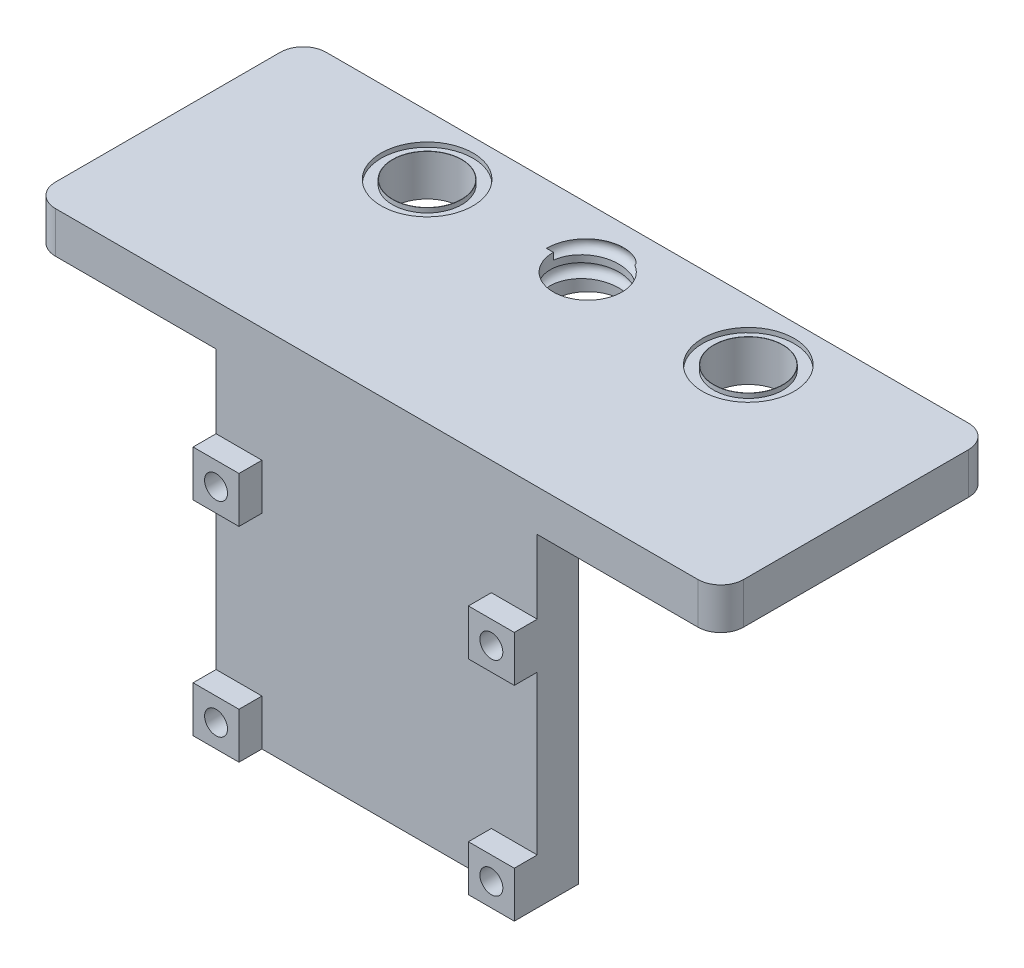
ISO-10303-21;
HEADER;
FILE_DESCRIPTION(('STEP AP214'),'2;1');
FILE_NAME('part.step','',(''),(''),'','','');
FILE_SCHEMA(('AUTOMOTIVE_DESIGN { 1 0 10303 214 1 1 1 1 }'));
ENDSEC;
DATA;
#1=APPLICATION_CONTEXT('core data for automotive mechanical design processes');
#2=APPLICATION_PROTOCOL_DEFINITION('international standard','automotive_design',2000,#1);
#3=PRODUCT_CONTEXT('',#1,'mechanical');
#4=PRODUCT('Part','Part','',(#3));
#5=PRODUCT_RELATED_PRODUCT_CATEGORY('part','',(#4));
#6=PRODUCT_DEFINITION_FORMATION('','',#4);
#7=PRODUCT_DEFINITION_CONTEXT('part definition',#1,'design');
#8=PRODUCT_DEFINITION('design','',#6,#7);
#9=PRODUCT_DEFINITION_SHAPE('','',#8);
#10=(LENGTH_UNIT() NAMED_UNIT(*) SI_UNIT(.MILLI.,.METRE.));
#11=(NAMED_UNIT(*) PLANE_ANGLE_UNIT() SI_UNIT($,.RADIAN.));
#12=(NAMED_UNIT(*) SI_UNIT($,.STERADIAN.) SOLID_ANGLE_UNIT());
#13=UNCERTAINTY_MEASURE_WITH_UNIT(LENGTH_MEASURE(1.E-05),#10,'distance_accuracy_value','');
#14=(GEOMETRIC_REPRESENTATION_CONTEXT(3) GLOBAL_UNCERTAINTY_ASSIGNED_CONTEXT((#13)) GLOBAL_UNIT_ASSIGNED_CONTEXT((#10,
#11,#12)) REPRESENTATION_CONTEXT('',''));
#15=CARTESIAN_POINT('',(0.,0.,0.));
#16=DIRECTION('',(0.,0.,1.));
#17=DIRECTION('',(1.,0.,0.));
#18=AXIS2_PLACEMENT_3D('',#15,#16,#17);
#19=CARTESIAN_POINT('',(-150.,-9.,-100.));
#20=DIRECTION('',(0.,1.,0.));
#21=DIRECTION('',(-1.,0.,0.));
#22=AXIS2_PLACEMENT_3D('',#19,#20,#21);
#23=PLANE('',#22);
#24=CARTESIAN_POINT('',(0.,-9.00000000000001,-74.));
#25=DIRECTION('',(0.,1.,0.));
#26=DIRECTION('',(-1.,0.,0.));
#27=AXIS2_PLACEMENT_3D('',#24,#25,#26);
#28=CIRCLE('',#27,15.);
#29=CARTESIAN_POINT('',(7.50485551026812,-9.00000000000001,-61.0124234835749));
#30=VERTEX_POINT('',#29);
#31=CARTESIAN_POINT('',(-15.,-9.00000000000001,-74.0000000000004));
#32=VERTEX_POINT('',#31);
#33=EDGE_CURVE('E572',#30,#32,#28,.T.);
#34=ORIENTED_EDGE('',*,*,#33,.T.);
#35=DIRECTION('',(-1.,0.,0.));
#36=VECTOR('',#35,1.);
#37=CARTESIAN_POINT('',(-150.,-9.,-74.0000000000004));
#38=LINE('',#37,#36);
#39=CARTESIAN_POINT('',(-17.9999999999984,-9.00000000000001,-74.0000000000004));
#40=VERTEX_POINT('',#39);
#41=EDGE_CURVE('E242',#32,#40,#38,.T.);
#42=ORIENTED_EDGE('',*,*,#41,.T.);
#43=CARTESIAN_POINT('',(-11.9999999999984,-9.00000000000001,-74.0000000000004));
#44=CARTESIAN_POINT('',(-12.0000313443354,-9.00000000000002,-73.6415327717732));
#45=CARTESIAN_POINT('',(-11.984830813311,-9.00000000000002,-73.2830763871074));
#46=CARTESIAN_POINT('',(-11.924292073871,-9.00000000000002,-72.5687293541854));
#47=CARTESIAN_POINT('',(-11.8789549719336,-9.00000000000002,-72.2128386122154));
#48=CARTESIAN_POINT('',(-11.758541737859,-9.00000000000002,-71.5065661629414));
#49=CARTESIAN_POINT('',(-11.68350152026,-9.00000000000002,-71.1561783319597));
#50=CARTESIAN_POINT('',(-11.5042405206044,-9.00000000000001,-70.4629641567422));
#51=CARTESIAN_POINT('',(-11.400020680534,-9.00000000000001,-70.1201375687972));
#52=CARTESIAN_POINT('',(-11.163006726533,-9.00000000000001,-69.4442892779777));
#53=CARTESIAN_POINT('',(-11.0301978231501,-9.00000000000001,-69.1112727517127));
#54=CARTESIAN_POINT('',(-10.7373854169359,-9.00000000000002,-68.4575080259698));
#55=CARTESIAN_POINT('',(-10.5773806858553,-9.00000000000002,-68.136760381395));
#56=CARTESIAN_POINT('',(-10.0583097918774,-9.00000000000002,-67.1963151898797));
#57=CARTESIAN_POINT('',(-9.65994733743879,-9.00000000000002,-66.597736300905));
#58=CARTESIAN_POINT('',(-8.76429087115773,-9.00000000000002,-65.4678435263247));
#59=CARTESIAN_POINT('',(-8.26583569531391,-9.00000000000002,-64.9374517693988));
#60=CARTESIAN_POINT('',(-7.45923102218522,-9.00000000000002,-64.2080076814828));
#61=CARTESIAN_POINT('',(-7.18036632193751,-9.00000000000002,-63.9757698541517));
#62=CARTESIAN_POINT('',(-6.60468800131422,-9.00000000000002,-63.5346369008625));
#63=CARTESIAN_POINT('',(-6.30787573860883,-9.00000000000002,-63.3257400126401));
#64=CARTESIAN_POINT('',(-5.68997068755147,-9.00000000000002,-62.9271404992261));
#65=CARTESIAN_POINT('',(-5.36843474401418,-9.00000000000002,-62.738123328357));
#66=CARTESIAN_POINT('',(-4.87530717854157,-9.00000000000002,-62.4750638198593));
#67=CARTESIAN_POINT('',(-4.70910164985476,-9.00000000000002,-62.3907772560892));
#68=CARTESIAN_POINT('',(-4.37346632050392,-9.00000000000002,-62.2288614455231));
#69=CARTESIAN_POINT('',(-4.20403645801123,-9.00000000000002,-62.1512323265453));
#70=CARTESIAN_POINT('',(-3.86226379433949,-9.00000000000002,-62.0027438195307));
#71=CARTESIAN_POINT('',(-3.68992141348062,-9.00000000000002,-61.9318834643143));
#72=CARTESIAN_POINT('',(-3.34260845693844,-9.00000000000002,-61.7969776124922));
#73=CARTESIAN_POINT('',(-3.16763792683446,-9.00000000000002,-61.7329319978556));
#74=CARTESIAN_POINT('',(-2.63919719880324,-9.00000000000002,-61.5510931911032));
#75=CARTESIAN_POINT('',(-2.28211290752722,-9.00000000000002,-61.4435611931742));
#76=CARTESIAN_POINT('',(-1.73136787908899,-9.00000000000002,-61.3004389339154));
#77=CARTESIAN_POINT('',(-1.54021962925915,-9.00000000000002,-61.254864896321));
#78=CARTESIAN_POINT('',(-1.1562443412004,-9.00000000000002,-61.1713876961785));
#79=CARTESIAN_POINT('',(-0.963417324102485,-9.00000000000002,-61.133484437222));
#80=CARTESIAN_POINT('',(-0.57640431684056,-9.00000000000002,-61.0653125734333));
#81=CARTESIAN_POINT('',(-0.38221823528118,-9.00000000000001,-61.0350444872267));
#82=CARTESIAN_POINT('',(-0.09017193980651,-9.00000000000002,-60.9953800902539));
#83=CARTESIAN_POINT('',(0.0073065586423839,-9.00000000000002,-60.9831147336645));
#84=CARTESIAN_POINT('',(0.202476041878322,-9.00000000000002,-60.9603705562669));
#85=CARTESIAN_POINT('',(0.300167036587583,-9.00000000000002,-60.9498918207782));
#86=CARTESIAN_POINT('',(0.593349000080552,-9.00000000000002,-60.9211146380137));
#87=CARTESIAN_POINT('',(0.78910489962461,-9.00000000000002,-60.9054542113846));
#88=CARTESIAN_POINT('',(1.18103893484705,-9.00000000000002,-60.8809864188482));
#89=CARTESIAN_POINT('',(1.37721707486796,-9.00000000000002,-60.872179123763));
#90=CARTESIAN_POINT('',(1.76973581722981,-9.00000000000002,-60.8611709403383));
#91=CARTESIAN_POINT('',(1.96607639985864,-9.00000000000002,-60.8589693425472));
#92=CARTESIAN_POINT('',(2.35871687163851,-9.00000000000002,-60.8608565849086));
#93=CARTESIAN_POINT('',(2.55501676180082,-9.00000000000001,-60.8649452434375));
#94=CARTESIAN_POINT('',(2.97529961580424,-9.00000000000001,-60.8800062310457));
#95=CARTESIAN_POINT('',(3.19925015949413,-9.00000000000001,-60.8918746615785));
#96=CARTESIAN_POINT('',(3.64663898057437,-9.00000000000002,-60.9224701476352));
#97=CARTESIAN_POINT('',(3.87007732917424,-9.00000000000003,-60.9411961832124));
#98=CARTESIAN_POINT('',(4.20493280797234,-9.00000000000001,-60.9735192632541));
#99=CARTESIAN_POINT('',(4.31656060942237,-9.,-60.9850065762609));
#100=CARTESIAN_POINT('',(4.5396869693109,-9.00000000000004,-61.0091710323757));
#101=CARTESIAN_POINT('',(4.65118552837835,-9.00000000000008,-61.0218481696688));
#102=CARTESIAN_POINT('',(4.87406588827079,-8.99999999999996,-61.048119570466));
#103=CARTESIAN_POINT('',(4.98544769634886,-8.99999999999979,-61.0617137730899));
#104=CARTESIAN_POINT('',(5.15246965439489,-9.00000000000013,-61.0825095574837));
#105=CARTESIAN_POINT('',(5.20813523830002,-9.00000000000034,-61.0895089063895));
#106=CARTESIAN_POINT('',(5.3194567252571,-8.9999999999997,-61.1035854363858));
#107=CARTESIAN_POINT('',(5.37511262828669,-8.99999999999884,-61.1106626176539));
#108=CARTESIAN_POINT('',(5.54206415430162,-8.99999999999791,-61.1317877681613));
#109=CARTESIAN_POINT('',(5.65337260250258,-8.99999999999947,-61.1457330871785));
#110=CARTESIAN_POINT('',(5.87617554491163,-9.00000000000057,-61.1725436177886));
#111=CARTESIAN_POINT('',(5.98767009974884,-9.00000000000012,-61.1854083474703));
#112=CARTESIAN_POINT('',(6.15499114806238,-8.99999999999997,-61.2028101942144));
#113=CARTESIAN_POINT('',(6.21071814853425,-9.00000000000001,-61.2082900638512));
#114=CARTESIAN_POINT('',(6.32225244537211,-9.00000000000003,-61.2183489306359));
#115=CARTESIAN_POINT('',(6.37805973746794,-9.00000000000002,-61.2229279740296));
#116=CARTESIAN_POINT('',(6.48972619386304,-9.00000000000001,-61.2308138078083));
#117=CARTESIAN_POINT('',(6.54558529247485,-9.00000000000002,-61.2341215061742));
#118=CARTESIAN_POINT('',(6.65737784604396,-9.00000000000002,-61.2389344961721));
#119=CARTESIAN_POINT('',(6.71331127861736,-9.00000000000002,-61.2404402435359));
#120=CARTESIAN_POINT('',(6.79727574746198,-9.00000000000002,-61.2407113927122));
#121=CARTESIAN_POINT('',(6.82530287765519,-9.00000000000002,-61.2404692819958));
#122=CARTESIAN_POINT('',(6.88134273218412,-9.00000000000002,-61.2391605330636));
#123=CARTESIAN_POINT('',(6.90935545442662,-9.00000000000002,-61.2380937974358));
#124=CARTESIAN_POINT('',(6.96535026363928,-9.00000000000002,-61.2349345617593));
#125=CARTESIAN_POINT('',(6.99333230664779,-9.00000000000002,-61.2328412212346));
#126=CARTESIAN_POINT('',(7.04916463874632,-9.00000000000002,-61.2273511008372));
#127=CARTESIAN_POINT('',(7.07701494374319,-9.00000000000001,-61.223954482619));
#128=CARTESIAN_POINT('',(7.14233718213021,-9.00000000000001,-61.2139886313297));
#129=CARTESIAN_POINT('',(7.17971432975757,-9.00000000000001,-61.2067211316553));
#130=CARTESIAN_POINT('',(7.23488809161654,-9.00000000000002,-61.1924551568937));
#131=CARTESIAN_POINT('',(7.2531097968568,-9.00000000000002,-61.1871472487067));
#132=CARTESIAN_POINT('',(7.28909371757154,-9.00000000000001,-61.1751604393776));
#133=CARTESIAN_POINT('',(7.3068553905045,-9.,-61.1684799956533));
#134=CARTESIAN_POINT('',(7.3628142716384,-8.99999999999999,-61.1442776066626));
#135=CARTESIAN_POINT('',(7.39985509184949,-9.00000000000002,-61.1233896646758));
#136=CARTESIAN_POINT('',(7.44563744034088,-9.00000000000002,-61.0858220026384));
#137=CARTESIAN_POINT('',(7.45823736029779,-9.00000000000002,-61.0738562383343));
#138=CARTESIAN_POINT('',(7.4812494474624,-9.00000000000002,-61.047975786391));
#139=CARTESIAN_POINT('',(7.49166432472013,-9.00000000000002,-61.0340635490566));
#140=CARTESIAN_POINT('',(7.50984622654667,-9.00000000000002,-61.0045301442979));
#141=CARTESIAN_POINT('',(7.51760353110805,-9.00000000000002,-60.9889029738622));
#142=CARTESIAN_POINT('',(7.53023469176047,-9.00000000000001,-60.9565214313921));
#143=CARTESIAN_POINT('',(7.5351056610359,-9.00000000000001,-60.9397659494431));
#144=CARTESIAN_POINT('',(7.54299158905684,-9.00000000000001,-60.9015335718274));
#145=CARTESIAN_POINT('',(7.54525869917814,-9.00000000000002,-60.8799062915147));
#146=CARTESIAN_POINT('',(7.54634176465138,-9.00000000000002,-60.8365391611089));
#147=CARTESIAN_POINT('',(7.54514523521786,-9.00000000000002,-60.8147991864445));
#148=CARTESIAN_POINT('',(7.5404343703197,-9.00000000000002,-60.7747043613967));
#149=CARTESIAN_POINT('',(7.53727055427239,-9.00000000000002,-60.7563043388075));
#150=CARTESIAN_POINT('',(7.52937735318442,-9.00000000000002,-60.7198796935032));
#151=CARTESIAN_POINT('',(7.52465028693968,-9.00000000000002,-60.7018545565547));
#152=CARTESIAN_POINT('',(7.51392525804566,-9.00000000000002,-60.6661309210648));
#153=CARTESIAN_POINT('',(7.50792333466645,-9.00000000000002,-60.6484336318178));
#154=CARTESIAN_POINT('',(7.49488857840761,-9.00000000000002,-60.613420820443));
#155=CARTESIAN_POINT('',(7.48785538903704,-9.00000000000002,-60.5961054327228));
#156=CARTESIAN_POINT('',(7.45904322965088,-9.00000000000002,-60.5298622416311));
#157=CARTESIAN_POINT('',(7.43424173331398,-9.00000000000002,-60.4822481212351));
#158=CARTESIAN_POINT('',(7.38034009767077,-9.00000000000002,-60.389510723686));
#159=CARTESIAN_POINT('',(7.35123181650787,-9.00000000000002,-60.3443923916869));
#160=CARTESIAN_POINT('',(7.28986046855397,-9.00000000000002,-60.2560440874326));
#161=CARTESIAN_POINT('',(7.25758283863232,-9.00000000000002,-60.2128242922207));
#162=CARTESIAN_POINT('',(7.1907958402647,-9.00000000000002,-60.1282282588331));
#163=CARTESIAN_POINT('',(7.15628849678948,-9.00000000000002,-60.0868504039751));
#164=CARTESIAN_POINT('',(7.06674862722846,-9.00000000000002,-59.9841419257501));
#165=CARTESIAN_POINT('',(7.01052508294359,-9.00000000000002,-59.9238507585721));
#166=CARTESIAN_POINT('',(6.89497204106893,-9.00000000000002,-59.8063031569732));
#167=CARTESIAN_POINT('',(6.83564116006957,-9.00000000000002,-59.7490480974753));
#168=CARTESIAN_POINT('',(6.71441970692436,-9.00000000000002,-59.6371249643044));
#169=CARTESIAN_POINT('',(6.65252520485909,-9.00000000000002,-59.5824611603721));
#170=CARTESIAN_POINT('',(6.52668539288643,-9.00000000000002,-59.4755411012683));
#171=CARTESIAN_POINT('',(6.46273979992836,-9.00000000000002,-59.4232851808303));
#172=CARTESIAN_POINT('',(6.26818225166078,-9.00000000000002,-59.269794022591));
#173=CARTESIAN_POINT('',(6.1349244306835,-9.00000000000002,-59.1719033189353));
#174=CARTESIAN_POINT('',(5.86335879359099,-9.00000000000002,-58.9837226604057));
#175=CARTESIAN_POINT('',(5.72505499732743,-9.00000000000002,-58.8934268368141));
#176=CARTESIAN_POINT('',(5.44732513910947,-9.00000000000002,-58.7217563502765));
#177=CARTESIAN_POINT('',(5.30799511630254,-9.00000000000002,-58.6402261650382));
#178=CARTESIAN_POINT('',(5.02582434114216,-9.00000000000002,-58.483470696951));
#179=CARTESIAN_POINT('',(4.88298305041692,-9.00000000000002,-58.4082463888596));
#180=CARTESIAN_POINT('',(4.44970637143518,-9.00000000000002,-58.1915716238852));
#181=CARTESIAN_POINT('',(4.15467605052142,-9.00000000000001,-58.0592156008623));
#182=CARTESIAN_POINT('',(3.55549672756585,-9.00000000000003,-57.8176965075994));
#183=CARTESIAN_POINT('',(3.2513511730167,-9.00000000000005,-57.7085247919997));
#184=CARTESIAN_POINT('',(2.63603785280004,-8.99999999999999,-57.512633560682));
#185=CARTESIAN_POINT('',(2.32487218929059,-8.99999999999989,-57.4259074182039));
#186=CARTESIAN_POINT('',(1.67914941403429,-8.99999999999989,-57.2700292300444));
#187=CARTESIAN_POINT('',(1.34427729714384,-9.,-57.202177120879));
#188=CARTESIAN_POINT('',(0.839038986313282,-9.00000000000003,-57.1184669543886));
#189=CARTESIAN_POINT('',(0.670115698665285,-9.00000000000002,-57.0935728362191));
#190=CARTESIAN_POINT('',(0.331484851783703,-9.00000000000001,-57.0497858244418));
#191=CARTESIAN_POINT('',(0.161777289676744,-9.00000000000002,-57.0308929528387));
#192=CARTESIAN_POINT('',(-0.178202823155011,-9.00000000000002,-56.9989340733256));
#193=CARTESIAN_POINT('',(-0.348475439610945,-9.00000000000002,-56.9858687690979));
#194=CARTESIAN_POINT('',(-0.689355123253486,-9.00000000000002,-56.9654291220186));
#195=CARTESIAN_POINT('',(-0.859962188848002,-9.00000000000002,-56.9580547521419));
#196=CARTESIAN_POINT('',(-1.3720185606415,-9.00000000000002,-56.9444678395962));
#197=CARTESIAN_POINT('',(-1.71372703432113,-9.00000000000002,-56.9467892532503));
#198=CARTESIAN_POINT('',(-2.46986280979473,-9.00000000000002,-56.9768366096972));
#199=CARTESIAN_POINT('',(-2.88408044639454,-9.00000000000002,-57.0099331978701));
#200=CARTESIAN_POINT('',(-3.70861282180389,-9.00000000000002,-57.1087388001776));
#201=CARTESIAN_POINT('',(-4.11892722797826,-9.00000000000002,-57.174450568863));
#202=CARTESIAN_POINT('',(-4.9333715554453,-9.00000000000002,-57.3377887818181));
#203=CARTESIAN_POINT('',(-5.33749881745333,-9.00000000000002,-57.4354285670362));
#204=CARTESIAN_POINT('',(-5.93703259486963,-9.00000000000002,-57.6050968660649));
#205=CARTESIAN_POINT('',(-6.13578941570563,-9.00000000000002,-57.6655290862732));
#206=CARTESIAN_POINT('',(-6.53081945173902,-9.00000000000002,-57.7940329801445));
#207=CARTESIAN_POINT('',(-6.7270926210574,-9.00000000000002,-57.8621047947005));
#208=CARTESIAN_POINT('',(-7.34129242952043,-9.00000000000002,-58.088178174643));
#209=CARTESIAN_POINT('',(-7.75439269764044,-9.00000000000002,-58.2595285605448));
#210=CARTESIAN_POINT('',(-8.56538314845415,-9.00000000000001,-58.6349909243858));
#211=CARTESIAN_POINT('',(-8.96327271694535,-9.00000000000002,-58.8391042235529));
#212=CARTESIAN_POINT('',(-9.74143982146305,-9.00000000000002,-59.2786878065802));
#213=CARTESIAN_POINT('',(-10.1217137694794,-9.00000000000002,-59.5141644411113));
#214=CARTESIAN_POINT('',(-10.8622156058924,-9.00000000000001,-60.0148417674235));
#215=CARTESIAN_POINT('',(-11.2224435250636,-9.00000000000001,-60.2800424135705));
#216=CARTESIAN_POINT('',(-11.7542325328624,-9.00000000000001,-60.7052531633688));
#217=CARTESIAN_POINT('',(-11.9339314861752,-9.00000000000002,-60.8551995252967));
#218=CARTESIAN_POINT('',(-12.2869228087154,-9.00000000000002,-61.1624750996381));
#219=CARTESIAN_POINT('',(-12.4602151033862,-9.00000000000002,-61.3198043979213));
#220=CARTESIAN_POINT('',(-12.8001702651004,-9.00000000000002,-61.6414863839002));
#221=CARTESIAN_POINT('',(-12.9668327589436,-9.00000000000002,-61.8058394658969));
#222=CARTESIAN_POINT('',(-13.2932635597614,-9.00000000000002,-62.1412347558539));
#223=CARTESIAN_POINT('',(-13.453031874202,-9.00000000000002,-62.3122769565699));
#224=CARTESIAN_POINT('',(-13.9216229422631,-9.00000000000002,-62.8350746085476));
#225=CARTESIAN_POINT('',(-14.2197586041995,-9.00000000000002,-63.1965264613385));
#226=CARTESIAN_POINT('',(-14.7853393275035,-9.00000000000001,-63.9425735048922));
#227=CARTESIAN_POINT('',(-15.0527855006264,-9.00000000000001,-64.3271678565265));
#228=CARTESIAN_POINT('',(-15.5611336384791,-9.00000000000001,-65.1261258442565));
#229=CARTESIAN_POINT('',(-15.8012822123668,-9.00000000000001,-65.5409711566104));
#230=CARTESIAN_POINT('',(-16.1348500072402,-9.00000000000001,-66.1770950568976));
#231=CARTESIAN_POINT('',(-16.2416112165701,-9.00000000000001,-66.391479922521));
#232=CARTESIAN_POINT('',(-16.446083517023,-9.00000000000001,-66.8245231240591));
#233=CARTESIAN_POINT('',(-16.5437946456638,-9.00000000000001,-67.0431814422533));
#234=CARTESIAN_POINT('',(-16.8231128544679,-9.00000000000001,-67.704796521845));
#235=CARTESIAN_POINT('',(-16.9910240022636,-9.00000000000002,-68.1536211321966));
#236=CARTESIAN_POINT('',(-17.2890383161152,-9.00000000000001,-69.0635724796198));
#237=CARTESIAN_POINT('',(-17.4191457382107,-9.00000000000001,-69.5246978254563));
#238=CARTESIAN_POINT('',(-17.608009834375,-9.00000000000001,-70.3186830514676));
#239=CARTESIAN_POINT('',(-17.6764927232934,-9.00000000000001,-70.6492609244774));
#240=CARTESIAN_POINT('',(-17.7940169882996,-9.00000000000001,-71.3138077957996));
#241=CARTESIAN_POINT('',(-17.8430619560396,-9.00000000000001,-71.6477761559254));
#242=CARTESIAN_POINT('',(-17.9215050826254,-9.00000000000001,-72.3175192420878));
#243=CARTESIAN_POINT('',(-17.9509314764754,-9.00000000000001,-72.6532906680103));
#244=CARTESIAN_POINT('',(-17.99018698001,-9.00000000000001,-73.3260405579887));
#245=CARTESIAN_POINT('',(-18.0000124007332,-9.00000000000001,-73.6630192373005));
#246=CARTESIAN_POINT('',(-17.9999999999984,-9.00000000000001,-74.0000000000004));
#247=B_SPLINE_CURVE_WITH_KNOTS('',3,(#43,#44,#45,#46,#47,#48,#49,#50,#51,#52,#53,#54,#55,#56,
#57,#58,#59,#60,#61,#62,#63,#64,#65,#66,#67,#68,#69,#70,#71,#72,#73,#74,#75,#76,#77,#78,#79,#80,
#81,#82,#83,#84,#85,#86,#87,#88,#89,#90,#91,#92,#93,#94,#95,#96,#97,#98,#99,#100,#101,#102,#103,
#104,#105,#106,#107,#108,#109,#110,#111,#112,#113,#114,#115,#116,#117,#118,#119,#120,#121,#122,
#123,#124,#125,#126,#127,#128,#129,#130,#131,#132,#133,#134,#135,#136,#137,#138,#139,#140,#141,
#142,#143,#144,#145,#146,#147,#148,#149,#150,#151,#152,#153,#154,#155,#156,#157,#158,#159,#160,
#161,#162,#163,#164,#165,#166,#167,#168,#169,#170,#171,#172,#173,#174,#175,#176,#177,#178,#179,
#180,#181,#182,#183,#184,#185,#186,#187,#188,#189,#190,#191,#192,#193,#194,#195,#196,#197,#198,
#199,#200,#201,#202,#203,#204,#205,#206,#207,#208,#209,#210,#211,#212,#213,#214,#215,#216,#217,
#218,#219,#220,#221,#222,#223,#224,#225,#226,#227,#228,#229,#230,#231,#232,#233,#234,#235,#236,
#237,#238,#239,#240,#241,#242,#243,#244,#245,#246),.UNSPECIFIED.,.F.,.F.,(4,2,2,2,2,2,2,2,2,2,2,
2,2,2,2,2,2,2,2,2,2,2,2,2,2,2,2,2,2,2,2,2,2,2,2,2,2,2,2,2,2,2,2,2,2,2,2,2,2,2,2,2,2,2,2,2,2,2,2,
2,2,2,2,2,2,2,2,2,2,2,2,2,2,2,2,2,2,2,2,2,2,2,2,2,2,2,2,2,2,2,2,2,2,2,2,2,2,2,2,2,2,4),(0.,
1.07506438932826,2.15008930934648,3.22381834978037,4.2975127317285,5.37176388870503,
6.44606357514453,8.59252921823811,10.7655065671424,11.8532386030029,12.9408884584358,
14.0584357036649,14.6173769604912,15.1763289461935,15.7352009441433,16.29406326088,
17.4115108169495,18.0009077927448,18.5902973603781,19.1797269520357,19.4744530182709,
19.7691931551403,20.3582016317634,20.9472161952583,21.5361674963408,22.1251017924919,
22.7977742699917,23.4703467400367,23.8069934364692,24.1436384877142,24.480261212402,
24.6485729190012,24.8168850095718,25.1534214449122,25.4901071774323,25.658089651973,
25.8260635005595,25.9939171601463,26.1617283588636,26.2458034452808,26.3298884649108,
26.4140424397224,26.4981859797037,26.612205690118,26.6690820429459,26.7260226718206,
26.8515533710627,26.9034788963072,26.9553396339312,27.0073880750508,27.0594884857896,
27.1243626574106,27.1894709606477,27.2454009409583,27.3012483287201,27.3572718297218,
27.4133147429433,27.5739524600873,27.7348978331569,27.8966208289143,28.0581989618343,
28.3053552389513,28.5526225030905,28.8002839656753,29.0479797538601,29.5436739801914,
30.0389815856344,30.5230928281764,31.0072787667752,31.9762035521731,32.9447663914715,
33.9130429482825,34.9370898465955,35.4492465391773,35.961405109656,36.4736255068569,
36.9858434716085,38.0102072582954,39.255479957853,40.5008578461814,41.7467567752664,
42.3698449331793,42.9929445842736,44.3330332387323,45.6731759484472,47.0135904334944,
48.3540028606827,49.0559574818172,49.7579202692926,50.4599225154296,51.1619240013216,
52.5658166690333,53.969658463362,55.4058390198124,56.1241516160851,56.8424612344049,
58.278311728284,59.7140005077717,60.7262521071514,61.7383165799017,62.7489213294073,
63.7597162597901),.UNSPECIFIED.);
#248=EDGE_CURVE('E243',#30,#40,#247,.T.);
#249=ORIENTED_EDGE('',*,*,#248,.F.);
#250=EDGE_LOOP('',(#34,#42,#249));
#251=FACE_BOUND('',#250,.T.);
#252=DIRECTION('',(0.,0.,1.));
#253=VECTOR('',#252,1.);
#254=CARTESIAN_POINT('',(-150.,-9.,-100.));
#255=LINE('',#254,#253);
#256=CARTESIAN_POINT('',(-150.,-9.,-90.));
#257=VERTEX_POINT('',#256);
#258=CARTESIAN_POINT('',(-150.,-9.,7.99999999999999));
#259=VERTEX_POINT('',#258);
#260=EDGE_CURVE('E428',#257,#259,#255,.T.);
#261=ORIENTED_EDGE('',*,*,#260,.F.);
#262=CARTESIAN_POINT('',(-140.,-9.,-90.));
#263=DIRECTION('',(0.,1.,0.));
#264=DIRECTION('',(-1.,0.,0.));
#265=AXIS2_PLACEMENT_3D('',#262,#263,#264);
#266=CIRCLE('',#265,10.);
#267=CARTESIAN_POINT('',(-140.,-9.,-100.));
#268=VERTEX_POINT('',#267);
#269=EDGE_CURVE('E445',#257,#268,#266,.F.);
#270=ORIENTED_EDGE('',*,*,#269,.T.);
#271=DIRECTION('',(-1.,0.,0.));
#272=VECTOR('',#271,1.);
#273=CARTESIAN_POINT('',(-150.,-9.,-100.));
#274=LINE('',#273,#272);
#275=CARTESIAN_POINT('',(140.,-9.00000000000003,-100.));
#276=VERTEX_POINT('',#275);
#277=EDGE_CURVE('E433',#276,#268,#274,.T.);
#278=ORIENTED_EDGE('',*,*,#277,.F.);
#279=CARTESIAN_POINT('',(140.,-9.00000000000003,-90.));
#280=DIRECTION('',(0.,1.,0.));
#281=DIRECTION('',(-1.,0.,0.));
#282=AXIS2_PLACEMENT_3D('',#279,#280,#281);
#283=CIRCLE('',#282,10.);
#284=CARTESIAN_POINT('',(150.,-9.00000000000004,-90.));
#285=VERTEX_POINT('',#284);
#286=EDGE_CURVE('E443',#276,#285,#283,.F.);
#287=ORIENTED_EDGE('',*,*,#286,.T.);
#288=DIRECTION('',(0.,0.,1.));
#289=VECTOR('',#288,1.);
#290=CARTESIAN_POINT('',(150.,-9.00000000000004,-100.));
#291=LINE('',#290,#289);
#292=CARTESIAN_POINT('',(150.,-9.00000000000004,7.99999999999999));
#293=VERTEX_POINT('',#292);
#294=EDGE_CURVE('E432',#285,#293,#291,.T.);
#295=ORIENTED_EDGE('',*,*,#294,.T.);
#296=CARTESIAN_POINT('',(140.,-9.00000000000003,8.));
#297=DIRECTION('',(0.,1.,0.));
#298=DIRECTION('',(-1.,0.,0.));
#299=AXIS2_PLACEMENT_3D('',#296,#297,#298);
#300=CIRCLE('',#299,10.);
#301=CARTESIAN_POINT('',(140.,-9.00000000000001,18.));
#302=VERTEX_POINT('',#301);
#303=EDGE_CURVE('E55',#293,#302,#300,.F.);
#304=ORIENTED_EDGE('',*,*,#303,.T.);
#305=DIRECTION('',(-1.,0.,0.));
#306=VECTOR('',#305,1.);
#307=CARTESIAN_POINT('',(0.,-9.00000000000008,18.));
#308=LINE('',#307,#306);
#309=CARTESIAN_POINT('',(70.,-9.00000000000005,18.));
#310=VERTEX_POINT('',#309);
#311=EDGE_CURVE('E379',#302,#310,#308,.T.);
#312=ORIENTED_EDGE('',*,*,#311,.T.);
#313=DIRECTION('',(0.,0.,-1.));
#314=VECTOR('',#313,1.);
#315=CARTESIAN_POINT('',(70.,-9.00000000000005,70.));
#316=LINE('',#315,#314);
#317=CARTESIAN_POINT('',(70.,-9.00000000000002,0.));
#318=VERTEX_POINT('',#317);
#319=EDGE_CURVE('E502',#310,#318,#316,.T.);
#320=ORIENTED_EDGE('',*,*,#319,.T.);
#321=DIRECTION('',(-1.,0.,0.));
#322=VECTOR('',#321,1.);
#323=CARTESIAN_POINT('',(-150.,-9.,0.));
#324=LINE('',#323,#322);
#325=CARTESIAN_POINT('',(-70.,-9.00000000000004,0.));
#326=VERTEX_POINT('',#325);
#327=EDGE_CURVE('E472',#318,#326,#324,.T.);
#328=ORIENTED_EDGE('',*,*,#327,.T.);
#329=DIRECTION('',(0.,0.,-1.));
#330=VECTOR('',#329,1.);
#331=CARTESIAN_POINT('',(-70.,-9.00000000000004,70.));
#332=LINE('',#331,#330);
#333=CARTESIAN_POINT('',(-70.,-9.00000000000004,18.));
#334=VERTEX_POINT('',#333);
#335=EDGE_CURVE('E464',#334,#326,#332,.T.);
#336=ORIENTED_EDGE('',*,*,#335,.F.);
#337=DIRECTION('',(-1.,0.,0.));
#338=VECTOR('',#337,1.);
#339=CARTESIAN_POINT('',(0.,-9.00000000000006,18.));
#340=LINE('',#339,#338);
#341=CARTESIAN_POINT('',(-140.,-9.00000000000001,18.));
#342=VERTEX_POINT('',#341);
#343=EDGE_CURVE('E456',#334,#342,#340,.T.);
#344=ORIENTED_EDGE('',*,*,#343,.T.);
#345=CARTESIAN_POINT('',(-140.,-9.,8.));
#346=DIRECTION('',(0.,1.,0.));
#347=DIRECTION('',(-1.,0.,0.));
#348=AXIS2_PLACEMENT_3D('',#345,#346,#347);
#349=CIRCLE('',#348,10.);
#350=EDGE_CURVE('E47',#342,#259,#349,.F.);
#351=ORIENTED_EDGE('',*,*,#350,.T.);
#352=EDGE_LOOP('',(#261,#270,#278,#287,#295,#304,#312,#320,#328,#336,#344,#351));
#353=FACE_BOUND('',#352,.T.);
#354=CARTESIAN_POINT('',(70.,-8.99999999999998,-74.));
#355=DIRECTION('',(0.,1.,0.));
#356=DIRECTION('',(-1.,0.,0.));
#357=AXIS2_PLACEMENT_3D('',#354,#355,#356);
#358=CIRCLE('',#357,20.);
#359=CARTESIAN_POINT('',(50.,-8.99999999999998,-74.));
#360=VERTEX_POINT('',#359);
#361=EDGE_CURVE('E817',#360,#360,#358,.T.);
#362=ORIENTED_EDGE('',*,*,#361,.T.);
#363=EDGE_LOOP('',(#362));
#364=FACE_BOUND('',#363,.T.);
#365=CARTESIAN_POINT('',(-70.,-9.,-74.));
#366=DIRECTION('',(0.,1.,0.));
#367=DIRECTION('',(-1.,0.,0.));
#368=AXIS2_PLACEMENT_3D('',#365,#366,#367);
#369=CIRCLE('',#368,20.);
#370=CARTESIAN_POINT('',(-90.,-9.,-74.));
#371=VERTEX_POINT('',#370);
#372=EDGE_CURVE('E1261',#371,#371,#369,.T.);
#373=ORIENTED_EDGE('',*,*,#372,.T.);
#374=EDGE_LOOP('',(#373));
#375=FACE_BOUND('',#374,.T.);
#376=ADVANCED_FACE('F32',(#251,#353,#364,#375),#23,.F.);
#377=CARTESIAN_POINT('',(-70.,-9.,-74.));
#378=DIRECTION('',(0.,1.,0.));
#379=DIRECTION('',(-1.,0.,0.));
#380=AXIS2_PLACEMENT_3D('',#377,#378,#379);
#381=CIRCLE('',#380,15.1);
#382=CARTESIAN_POINT('',(-85.1,-9.,-74.));
#383=VERTEX_POINT('',#382);
#384=EDGE_CURVE('E1259',#383,#383,#381,.T.);
#385=ORIENTED_EDGE('',*,*,#384,.F.);
#386=EDGE_LOOP('',(#385));
#387=FACE_BOUND('',#386,.T.);
#388=CARTESIAN_POINT('',(-70.,-9.00000000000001,-74.));
#389=DIRECTION('',(0.,1.,0.));
#390=DIRECTION('',(-1.,0.,0.));
#391=AXIS2_PLACEMENT_3D('',#388,#389,#390);
#392=CIRCLE('',#391,15.);
#393=CARTESIAN_POINT('',(-85.,-9.00000000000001,-74.));
#394=VERTEX_POINT('',#393);
#395=EDGE_CURVE('E470',#394,#394,#392,.T.);
#396=ORIENTED_EDGE('',*,*,#395,.T.);
#397=EDGE_LOOP('',(#396));
#398=FACE_BOUND('',#397,.T.);
#399=ADVANCED_FACE('F651',(#387,#398),#23,.F.);
#400=CARTESIAN_POINT('',(-150.,9.00000000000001,-100.));
#401=DIRECTION('',(0.,-1.,0.));
#402=DIRECTION('',(1.,0.,0.));
#403=AXIS2_PLACEMENT_3D('',#400,#401,#402);
#404=PLANE('',#403);
#405=CARTESIAN_POINT('',(-70.,9.,-74.));
#406=DIRECTION('',(0.,1.,0.));
#407=DIRECTION('',(-1.,0.,0.));
#408=AXIS2_PLACEMENT_3D('',#405,#406,#407);
#409=CIRCLE('',#408,15.);
#410=CARTESIAN_POINT('',(-85.,9.,-74.));
#411=VERTEX_POINT('',#410);
#412=EDGE_CURVE('E574',#411,#411,#409,.T.);
#413=ORIENTED_EDGE('',*,*,#412,.F.);
#414=EDGE_LOOP('',(#413));
#415=FACE_BOUND('',#414,.T.);
#416=CARTESIAN_POINT('',(-70.,9.,-74.));
#417=DIRECTION('',(0.,1.,0.));
#418=DIRECTION('',(-1.,0.,0.));
#419=AXIS2_PLACEMENT_3D('',#416,#417,#418);
#420=CIRCLE('',#419,15.1);
#421=CARTESIAN_POINT('',(-85.1,9.,-74.));
#422=VERTEX_POINT('',#421);
#423=EDGE_CURVE('E809',#422,#422,#420,.T.);
#424=ORIENTED_EDGE('',*,*,#423,.T.);
#425=EDGE_LOOP('',(#424));
#426=FACE_BOUND('',#425,.T.);
#427=ADVANCED_FACE('F658',(#415,#426),#404,.F.);
#428=CARTESIAN_POINT('',(70.,8.99999999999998,-74.));
#429=DIRECTION('',(0.,1.,0.));
#430=DIRECTION('',(-1.,0.,0.));
#431=AXIS2_PLACEMENT_3D('',#428,#429,#430);
#432=CIRCLE('',#431,15.);
#433=CARTESIAN_POINT('',(55.,8.99999999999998,-74.));
#434=VERTEX_POINT('',#433);
#435=EDGE_CURVE('E569',#434,#434,#432,.T.);
#436=ORIENTED_EDGE('',*,*,#435,.F.);
#437=EDGE_LOOP('',(#436));
#438=FACE_BOUND('',#437,.T.);
#439=CARTESIAN_POINT('',(70.,8.99999999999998,-74.));
#440=DIRECTION('',(0.,1.,0.));
#441=DIRECTION('',(-1.,0.,0.));
#442=AXIS2_PLACEMENT_3D('',#439,#440,#441);
#443=CIRCLE('',#442,15.1);
#444=CARTESIAN_POINT('',(54.9,8.99999999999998,-74.));
#445=VERTEX_POINT('',#444);
#446=EDGE_CURVE('E777',#445,#445,#443,.T.);
#447=ORIENTED_EDGE('',*,*,#446,.T.);
#448=EDGE_LOOP('',(#447));
#449=FACE_BOUND('',#448,.T.);
#450=ADVANCED_FACE('F772',(#438,#449),#404,.F.);
#451=CARTESIAN_POINT('',(-70.,9.,-74.));
#452=DIRECTION('',(0.,1.,0.));
#453=DIRECTION('',(-1.,0.,0.));
#454=AXIS2_PLACEMENT_3D('',#451,#452,#453);
#455=CIRCLE('',#454,20.);
#456=CARTESIAN_POINT('',(-90.,9.,-74.));
#457=VERTEX_POINT('',#456);
#458=EDGE_CURVE('E785',#457,#457,#455,.T.);
#459=ORIENTED_EDGE('',*,*,#458,.F.);
#460=EDGE_LOOP('',(#459));
#461=FACE_BOUND('',#460,.T.);
#462=CARTESIAN_POINT('',(70.,8.99999999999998,-74.));
#463=DIRECTION('',(0.,1.,0.));
#464=DIRECTION('',(-1.,0.,0.));
#465=AXIS2_PLACEMENT_3D('',#462,#463,#464);
#466=CIRCLE('',#465,20.);
#467=CARTESIAN_POINT('',(50.,8.99999999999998,-74.));
#468=VERTEX_POINT('',#467);
#469=EDGE_CURVE('E689',#468,#468,#466,.T.);
#470=ORIENTED_EDGE('',*,*,#469,.F.);
#471=EDGE_LOOP('',(#470));
#472=FACE_BOUND('',#471,.T.);
#473=DIRECTION('',(1.,0.,0.));
#474=VECTOR('',#473,1.);
#475=CARTESIAN_POINT('',(-150.,9.00000000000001,-100.));
#476=LINE('',#475,#474);
#477=CARTESIAN_POINT('',(-140.,9.00000000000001,-100.));
#478=VERTEX_POINT('',#477);
#479=CARTESIAN_POINT('',(140.,8.99999999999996,-100.));
#480=VERTEX_POINT('',#479);
#481=EDGE_CURVE('E474',#478,#480,#476,.T.);
#482=ORIENTED_EDGE('',*,*,#481,.F.);
#483=CARTESIAN_POINT('',(-140.,9.00000000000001,-90.));
#484=DIRECTION('',(0.,-1.,0.));
#485=DIRECTION('',(1.,0.,0.));
#486=AXIS2_PLACEMENT_3D('',#483,#484,#485);
#487=CIRCLE('',#486,10.);
#488=CARTESIAN_POINT('',(-150.,9.00000000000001,-90.));
#489=VERTEX_POINT('',#488);
#490=EDGE_CURVE('E434',#478,#489,#487,.F.);
#491=ORIENTED_EDGE('',*,*,#490,.T.);
#492=DIRECTION('',(0.,0.,1.));
#493=VECTOR('',#492,1.);
#494=CARTESIAN_POINT('',(-150.,9.00000000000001,-100.));
#495=LINE('',#494,#493);
#496=CARTESIAN_POINT('',(-150.,9.00000000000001,7.99999999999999));
#497=VERTEX_POINT('',#496);
#498=EDGE_CURVE('E411',#489,#497,#495,.T.);
#499=ORIENTED_EDGE('',*,*,#498,.T.);
#500=CARTESIAN_POINT('',(-140.,9.00000000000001,8.));
#501=DIRECTION('',(0.,-1.,0.));
#502=DIRECTION('',(1.,0.,0.));
#503=AXIS2_PLACEMENT_3D('',#500,#501,#502);
#504=CIRCLE('',#503,10.);
#505=CARTESIAN_POINT('',(-140.,8.99999999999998,18.));
#506=VERTEX_POINT('',#505);
#507=EDGE_CURVE('E410',#497,#506,#504,.F.);
#508=ORIENTED_EDGE('',*,*,#507,.T.);
#509=DIRECTION('',(1.,0.,0.));
#510=VECTOR('',#509,1.);
#511=CARTESIAN_POINT('',(0.,8.99999999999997,18.));
#512=LINE('',#511,#510);
#513=CARTESIAN_POINT('',(140.,8.99999999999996,18.));
#514=VERTEX_POINT('',#513);
#515=EDGE_CURVE('E458',#506,#514,#512,.T.);
#516=ORIENTED_EDGE('',*,*,#515,.T.);
#517=CARTESIAN_POINT('',(140.,8.99999999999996,8.));
#518=DIRECTION('',(0.,-1.,0.));
#519=DIRECTION('',(1.,0.,0.));
#520=AXIS2_PLACEMENT_3D('',#517,#518,#519);
#521=CIRCLE('',#520,10.);
#522=CARTESIAN_POINT('',(150.,8.99999999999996,7.99999999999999));
#523=VERTEX_POINT('',#522);
#524=EDGE_CURVE('E546',#514,#523,#521,.F.);
#525=ORIENTED_EDGE('',*,*,#524,.T.);
#526=DIRECTION('',(0.,0.,1.));
#527=VECTOR('',#526,1.);
#528=CARTESIAN_POINT('',(150.,8.99999999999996,-100.));
#529=LINE('',#528,#527);
#530=CARTESIAN_POINT('',(150.,8.99999999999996,-90.));
#531=VERTEX_POINT('',#530);
#532=EDGE_CURVE('E416',#531,#523,#529,.T.);
#533=ORIENTED_EDGE('',*,*,#532,.F.);
#534=CARTESIAN_POINT('',(140.,8.99999999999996,-90.));
#535=DIRECTION('',(0.,-1.,0.));
#536=DIRECTION('',(1.,0.,0.));
#537=AXIS2_PLACEMENT_3D('',#534,#535,#536);
#538=CIRCLE('',#537,10.);
#539=EDGE_CURVE('E550',#531,#480,#538,.F.);
#540=ORIENTED_EDGE('',*,*,#539,.T.);
#541=EDGE_LOOP('',(#482,#491,#499,#508,#516,#525,#533,#540));
#542=FACE_BOUND('',#541,.T.);
#543=DIRECTION('',(1.,0.,0.));
#544=VECTOR('',#543,1.);
#545=CARTESIAN_POINT('',(-150.,9.00000000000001,-74.0000000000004));
#546=LINE('',#545,#544);
#547=CARTESIAN_POINT('',(-17.9999999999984,8.99999999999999,-74.0000000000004));
#548=VERTEX_POINT('',#547);
#549=CARTESIAN_POINT('',(-15.,8.99999999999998,-74.0000000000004));
#550=VERTEX_POINT('',#549);
#551=EDGE_CURVE('E247',#548,#550,#546,.T.);
#552=ORIENTED_EDGE('',*,*,#551,.F.);
#553=CARTESIAN_POINT('',(-11.9999999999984,8.99999999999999,-74.0000000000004));
#554=CARTESIAN_POINT('',(-12.0000313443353,8.99999999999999,-74.3584672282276));
#555=CARTESIAN_POINT('',(-11.984830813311,8.99999999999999,-74.7169236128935));
#556=CARTESIAN_POINT('',(-11.9242920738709,8.99999999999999,-75.4312706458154));
#557=CARTESIAN_POINT('',(-11.8789549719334,8.99999999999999,-75.7871613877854));
#558=CARTESIAN_POINT('',(-11.7585417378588,8.99999999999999,-76.4934338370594));
#559=CARTESIAN_POINT('',(-11.6835015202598,8.99999999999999,-76.8438216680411));
#560=CARTESIAN_POINT('',(-11.5042405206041,8.99999999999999,-77.5370358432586));
#561=CARTESIAN_POINT('',(-11.4000206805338,8.99999999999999,-77.8798624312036));
#562=CARTESIAN_POINT('',(-11.1630067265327,8.99999999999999,-78.555710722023));
#563=CARTESIAN_POINT('',(-11.0301978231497,8.99999999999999,-78.888727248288));
#564=CARTESIAN_POINT('',(-10.7373854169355,8.99999999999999,-79.542491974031));
#565=CARTESIAN_POINT('',(-10.5773806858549,8.99999999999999,-79.8632396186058));
#566=CARTESIAN_POINT('',(-10.0583097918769,8.99999999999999,-80.803684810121));
#567=CARTESIAN_POINT('',(-9.65994733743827,8.99999999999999,-81.4022636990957));
#568=CARTESIAN_POINT('',(-8.76429087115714,8.99999999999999,-82.532156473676));
#569=CARTESIAN_POINT('',(-8.26583569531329,8.99999999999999,-83.0625482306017));
#570=CARTESIAN_POINT('',(-7.45923102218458,8.99999999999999,-83.7919923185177));
#571=CARTESIAN_POINT('',(-7.18036632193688,8.99999999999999,-84.0242301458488));
#572=CARTESIAN_POINT('',(-6.60468800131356,8.99999999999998,-84.4653630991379));
#573=CARTESIAN_POINT('',(-6.30787573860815,8.99999999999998,-84.6742599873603));
#574=CARTESIAN_POINT('',(-5.68997068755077,8.99999999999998,-85.0728595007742));
#575=CARTESIAN_POINT('',(-5.36843474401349,8.99999999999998,-85.2618766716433));
#576=CARTESIAN_POINT('',(-4.87530717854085,8.99999999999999,-85.524936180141));
#577=CARTESIAN_POINT('',(-4.70910164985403,8.99999999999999,-85.609222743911));
#578=CARTESIAN_POINT('',(-4.37346632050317,8.99999999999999,-85.7711385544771));
#579=CARTESIAN_POINT('',(-4.20403645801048,8.99999999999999,-85.8487676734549));
#580=CARTESIAN_POINT('',(-3.86226379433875,8.99999999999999,-85.9972561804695));
#581=CARTESIAN_POINT('',(-3.68992141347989,8.99999999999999,-86.0681165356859));
#582=CARTESIAN_POINT('',(-3.3426084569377,8.99999999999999,-86.203022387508));
#583=CARTESIAN_POINT('',(-3.16763792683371,8.99999999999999,-86.2670680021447));
#584=CARTESIAN_POINT('',(-2.63919719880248,8.99999999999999,-86.448906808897));
#585=CARTESIAN_POINT('',(-2.28211290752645,8.99999999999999,-86.5564388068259));
#586=CARTESIAN_POINT('',(-1.73136787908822,8.99999999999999,-86.6995610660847));
#587=CARTESIAN_POINT('',(-1.54021962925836,8.99999999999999,-86.7451351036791));
#588=CARTESIAN_POINT('',(-1.1562443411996,8.99999999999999,-86.8286123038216));
#589=CARTESIAN_POINT('',(-0.963417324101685,8.99999999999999,-86.866515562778));
#590=CARTESIAN_POINT('',(-0.576404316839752,8.99999999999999,-86.9346874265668));
#591=CARTESIAN_POINT('',(-0.382218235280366,8.99999999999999,-86.9649555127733));
#592=CARTESIAN_POINT('',(-0.090171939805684,8.99999999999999,-87.0046199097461));
#593=CARTESIAN_POINT('',(0.00730655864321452,8.99999999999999,-87.0168852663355));
#594=CARTESIAN_POINT('',(0.202476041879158,8.99999999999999,-87.0396294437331));
#595=CARTESIAN_POINT('',(0.300167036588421,8.99999999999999,-87.0501081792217));
#596=CARTESIAN_POINT('',(0.593349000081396,8.99999999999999,-87.0788853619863));
#597=CARTESIAN_POINT('',(0.789104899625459,8.99999999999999,-87.0945457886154));
#598=CARTESIAN_POINT('',(1.18103893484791,8.99999999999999,-87.1190135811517));
#599=CARTESIAN_POINT('',(1.37721707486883,8.99999999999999,-87.127820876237));
#600=CARTESIAN_POINT('',(1.76973581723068,8.99999999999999,-87.1388290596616));
#601=CARTESIAN_POINT('',(1.96607639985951,8.99999999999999,-87.1410306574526));
#602=CARTESIAN_POINT('',(2.35871687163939,8.99999999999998,-87.1391434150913));
#603=CARTESIAN_POINT('',(2.5550167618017,8.99999999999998,-87.1350547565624));
#604=CARTESIAN_POINT('',(2.97529961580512,8.99999999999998,-87.1199937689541));
#605=CARTESIAN_POINT('',(3.19925015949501,8.99999999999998,-87.1081253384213));
#606=CARTESIAN_POINT('',(3.64663898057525,8.99999999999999,-87.0775298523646));
#607=CARTESIAN_POINT('',(3.87007732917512,9.,-87.0588038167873));
#608=CARTESIAN_POINT('',(4.20493280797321,8.99999999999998,-87.0264807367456));
#609=CARTESIAN_POINT('',(4.31656060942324,8.99999999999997,-87.0149934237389));
#610=CARTESIAN_POINT('',(4.53968696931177,9.,-86.990828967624));
#611=CARTESIAN_POINT('',(4.65118552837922,9.00000000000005,-86.978151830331));
#612=CARTESIAN_POINT('',(4.87406588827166,8.99999999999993,-86.9518804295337));
#613=CARTESIAN_POINT('',(4.98544769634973,8.99999999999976,-86.9382862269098));
#614=CARTESIAN_POINT('',(5.15246965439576,9.0000000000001,-86.917490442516));
#615=CARTESIAN_POINT('',(5.20813523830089,9.00000000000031,-86.9104910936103));
#616=CARTESIAN_POINT('',(5.31945672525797,8.99999999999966,-86.8964145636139));
#617=CARTESIAN_POINT('',(5.37511262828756,8.99999999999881,-86.8893373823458));
#618=CARTESIAN_POINT('',(5.54206415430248,8.99999999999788,-86.8682122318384));
#619=CARTESIAN_POINT('',(5.65337260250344,8.99999999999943,-86.8542669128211));
#620=CARTESIAN_POINT('',(5.8761755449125,9.00000000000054,-86.8274563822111));
#621=CARTESIAN_POINT('',(5.98767009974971,9.00000000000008,-86.8145916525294));
#622=CARTESIAN_POINT('',(6.15499114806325,8.99999999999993,-86.7971898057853));
#623=CARTESIAN_POINT('',(6.21071814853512,8.99999999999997,-86.7917099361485));
#624=CARTESIAN_POINT('',(6.32225244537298,9.,-86.7816510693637));
#625=CARTESIAN_POINT('',(6.37805973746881,8.99999999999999,-86.7770720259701));
#626=CARTESIAN_POINT('',(6.48972619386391,8.99999999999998,-86.7691861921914));
#627=CARTESIAN_POINT('',(6.54558529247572,8.99999999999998,-86.7658784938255));
#628=CARTESIAN_POINT('',(6.65737784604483,8.99999999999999,-86.7610655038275));
#629=CARTESIAN_POINT('',(6.71331127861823,8.99999999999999,-86.7595597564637));
#630=CARTESIAN_POINT('',(6.79727574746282,8.99999999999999,-86.7592886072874));
#631=CARTESIAN_POINT('',(6.82530287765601,8.99999999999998,-86.7595307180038));
#632=CARTESIAN_POINT('',(6.8813427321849,8.99999999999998,-86.760839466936));
#633=CARTESIAN_POINT('',(6.90935545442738,8.99999999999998,-86.7619062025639));
#634=CARTESIAN_POINT('',(6.96535026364,8.99999999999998,-86.7650654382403));
#635=CARTESIAN_POINT('',(6.99333230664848,8.99999999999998,-86.767158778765));
#636=CARTESIAN_POINT('',(7.04916463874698,8.99999999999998,-86.7726488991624));
#637=CARTESIAN_POINT('',(7.07701494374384,8.99999999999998,-86.7760455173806));
#638=CARTESIAN_POINT('',(7.14233718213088,8.99999999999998,-86.7860113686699));
#639=CARTESIAN_POINT('',(7.17971432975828,8.99999999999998,-86.7932788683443));
#640=CARTESIAN_POINT('',(7.23488809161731,8.99999999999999,-86.807544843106));
#641=CARTESIAN_POINT('',(7.25310979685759,8.99999999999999,-86.8128527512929));
#642=CARTESIAN_POINT('',(7.28909371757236,8.99999999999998,-86.824839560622));
#643=CARTESIAN_POINT('',(7.30685539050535,8.99999999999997,-86.8315200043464));
#644=CARTESIAN_POINT('',(7.36281427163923,8.99999999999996,-86.8557223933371));
#645=CARTESIAN_POINT('',(7.3998550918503,8.99999999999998,-86.8766103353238));
#646=CARTESIAN_POINT('',(7.44563744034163,8.99999999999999,-86.9141779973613));
#647=CARTESIAN_POINT('',(7.45823736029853,8.99999999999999,-86.9261437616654));
#648=CARTESIAN_POINT('',(7.48124944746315,8.99999999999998,-86.9520242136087));
#649=CARTESIAN_POINT('',(7.49166432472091,8.99999999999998,-86.965936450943));
#650=CARTESIAN_POINT('',(7.50984622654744,8.99999999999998,-86.9954698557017));
#651=CARTESIAN_POINT('',(7.51760353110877,8.99999999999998,-87.0110970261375));
#652=CARTESIAN_POINT('',(7.53023469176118,8.99999999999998,-87.0434785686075));
#653=CARTESIAN_POINT('',(7.53510566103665,8.99999999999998,-87.0602340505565));
#654=CARTESIAN_POINT('',(7.5429915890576,8.99999999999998,-87.0984664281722));
#655=CARTESIAN_POINT('',(7.54525869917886,8.99999999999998,-87.1200937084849));
#656=CARTESIAN_POINT('',(7.54634176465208,8.99999999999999,-87.1634608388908));
#657=CARTESIAN_POINT('',(7.54514523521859,8.99999999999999,-87.1852008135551));
#658=CARTESIAN_POINT('',(7.54043437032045,8.99999999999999,-87.2252956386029));
#659=CARTESIAN_POINT('',(7.53727055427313,8.99999999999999,-87.2436956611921));
#660=CARTESIAN_POINT('',(7.52937735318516,8.99999999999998,-87.2801203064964));
#661=CARTESIAN_POINT('',(7.52465028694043,8.99999999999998,-87.2981454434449));
#662=CARTESIAN_POINT('',(7.51392525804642,8.99999999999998,-87.3338690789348));
#663=CARTESIAN_POINT('',(7.50792333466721,8.99999999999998,-87.3515663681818));
#664=CARTESIAN_POINT('',(7.49488857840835,8.99999999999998,-87.3865791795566));
#665=CARTESIAN_POINT('',(7.48785538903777,8.99999999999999,-87.4038945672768));
#666=CARTESIAN_POINT('',(7.45904322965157,8.99999999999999,-87.4701377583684));
#667=CARTESIAN_POINT('',(7.43424173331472,8.99999999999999,-87.5177518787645));
#668=CARTESIAN_POINT('',(7.38034009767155,8.99999999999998,-87.6104892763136));
#669=CARTESIAN_POINT('',(7.35123181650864,8.99999999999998,-87.6556076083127));
#670=CARTESIAN_POINT('',(7.28986046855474,8.99999999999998,-87.743955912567));
#671=CARTESIAN_POINT('',(7.25758283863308,8.99999999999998,-87.7871757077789));
#672=CARTESIAN_POINT('',(7.19079584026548,8.99999999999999,-87.8717717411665));
#673=CARTESIAN_POINT('',(7.15628849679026,8.99999999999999,-87.9131495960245));
#674=CARTESIAN_POINT('',(7.06674862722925,9.,-88.0158580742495));
#675=CARTESIAN_POINT('',(7.01052508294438,8.99999999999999,-88.0761492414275));
#676=CARTESIAN_POINT('',(6.89497204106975,8.99999999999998,-88.1936968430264));
#677=CARTESIAN_POINT('',(6.8356411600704,8.99999999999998,-88.2509519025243));
#678=CARTESIAN_POINT('',(6.71441970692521,8.99999999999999,-88.3628750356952));
#679=CARTESIAN_POINT('',(6.65252520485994,8.99999999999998,-88.4175388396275));
#680=CARTESIAN_POINT('',(6.52668539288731,8.99999999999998,-88.5244588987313));
#681=CARTESIAN_POINT('',(6.46273979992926,8.99999999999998,-88.5767148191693));
#682=CARTESIAN_POINT('',(6.26818225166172,8.99999999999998,-88.7302059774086));
#683=CARTESIAN_POINT('',(6.13492443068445,8.99999999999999,-88.8280966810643));
#684=CARTESIAN_POINT('',(5.86335879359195,8.99999999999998,-89.0162773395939));
#685=CARTESIAN_POINT('',(5.72505499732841,8.99999999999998,-89.1065731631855));
#686=CARTESIAN_POINT('',(5.44732513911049,8.99999999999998,-89.2782436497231));
#687=CARTESIAN_POINT('',(5.30799511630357,8.99999999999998,-89.3597738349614));
#688=CARTESIAN_POINT('',(5.02582434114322,8.99999999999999,-89.5165293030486));
#689=CARTESIAN_POINT('',(4.88298305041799,8.99999999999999,-89.59175361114));
#690=CARTESIAN_POINT('',(4.44970637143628,8.99999999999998,-89.8084283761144));
#691=CARTESIAN_POINT('',(4.15467605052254,8.99999999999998,-89.9407843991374));
#692=CARTESIAN_POINT('',(3.55549672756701,8.99999999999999,-90.1823034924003));
#693=CARTESIAN_POINT('',(3.2513511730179,9.00000000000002,-90.2914752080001));
#694=CARTESIAN_POINT('',(2.63603785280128,8.99999999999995,-90.4873664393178));
#695=CARTESIAN_POINT('',(2.32487218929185,8.99999999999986,-90.5740925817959));
#696=CARTESIAN_POINT('',(1.67914941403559,8.99999999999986,-90.7299707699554));
#697=CARTESIAN_POINT('',(1.34427729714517,8.99999999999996,-90.7978228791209));
#698=CARTESIAN_POINT('',(0.839038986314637,9.,-90.8815330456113));
#699=CARTESIAN_POINT('',(0.670115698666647,8.99999999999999,-90.9064271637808));
#700=CARTESIAN_POINT('',(0.331484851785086,8.99999999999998,-90.9502141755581));
#701=CARTESIAN_POINT('',(0.16177728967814,8.99999999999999,-90.9691070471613));
#702=CARTESIAN_POINT('',(-0.178202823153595,8.99999999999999,-91.0010659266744));
#703=CARTESIAN_POINT('',(-0.348475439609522,8.99999999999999,-91.0141312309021));
#704=CARTESIAN_POINT('',(-0.689355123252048,8.99999999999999,-91.0345708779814));
#705=CARTESIAN_POINT('',(-0.859962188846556,8.99999999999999,-91.0419452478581));
#706=CARTESIAN_POINT('',(-1.37201856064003,8.99999999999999,-91.0555321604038));
#707=CARTESIAN_POINT('',(-1.71372703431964,8.99999999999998,-91.0532107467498));
#708=CARTESIAN_POINT('',(-2.46986280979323,8.99999999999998,-91.0231633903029));
#709=CARTESIAN_POINT('',(-2.88408044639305,8.99999999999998,-90.9900668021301));
#710=CARTESIAN_POINT('',(-3.70861282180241,8.99999999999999,-90.8912611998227));
#711=CARTESIAN_POINT('',(-4.11892722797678,8.99999999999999,-90.8255494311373));
#712=CARTESIAN_POINT('',(-4.93337155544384,8.99999999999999,-90.6622112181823));
#713=CARTESIAN_POINT('',(-5.33749881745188,8.99999999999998,-90.5645714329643));
#714=CARTESIAN_POINT('',(-5.93703259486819,8.99999999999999,-90.3949031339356));
#715=CARTESIAN_POINT('',(-6.13578941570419,8.99999999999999,-90.3344709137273));
#716=CARTESIAN_POINT('',(-6.53081945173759,8.99999999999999,-90.2059670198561));
#717=CARTESIAN_POINT('',(-6.72709262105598,8.99999999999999,-90.1378952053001));
#718=CARTESIAN_POINT('',(-7.34129242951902,8.99999999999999,-89.9118218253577));
#719=CARTESIAN_POINT('',(-7.75439269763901,8.99999999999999,-89.7404714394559));
#720=CARTESIAN_POINT('',(-8.56538314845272,8.99999999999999,-89.365009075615));
#721=CARTESIAN_POINT('',(-8.96327271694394,8.99999999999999,-89.160895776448));
#722=CARTESIAN_POINT('',(-9.74143982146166,8.99999999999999,-88.7213121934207));
#723=CARTESIAN_POINT('',(-10.121713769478,8.99999999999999,-88.4858355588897));
#724=CARTESIAN_POINT('',(-10.862215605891,8.99999999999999,-87.9851582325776));
#725=CARTESIAN_POINT('',(-11.2224435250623,8.99999999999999,-87.7199575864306));
#726=CARTESIAN_POINT('',(-11.7542325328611,8.99999999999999,-87.2947468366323));
#727=CARTESIAN_POINT('',(-11.9339314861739,8.99999999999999,-87.1448004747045));
#728=CARTESIAN_POINT('',(-12.2869228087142,8.99999999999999,-86.8375249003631));
#729=CARTESIAN_POINT('',(-12.460215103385,8.99999999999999,-86.6801956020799));
#730=CARTESIAN_POINT('',(-12.8001702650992,8.99999999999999,-86.358513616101));
#731=CARTESIAN_POINT('',(-12.9668327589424,8.99999999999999,-86.1941605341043));
#732=CARTESIAN_POINT('',(-13.2932635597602,8.99999999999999,-85.8587652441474));
#733=CARTESIAN_POINT('',(-13.4530318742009,8.99999999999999,-85.6877230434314));
#734=CARTESIAN_POINT('',(-13.921622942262,8.99999999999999,-85.1649253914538));
#735=CARTESIAN_POINT('',(-14.2197586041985,8.99999999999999,-84.8034735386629));
#736=CARTESIAN_POINT('',(-14.7853393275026,8.99999999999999,-84.0574264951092));
#737=CARTESIAN_POINT('',(-15.0527855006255,8.99999999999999,-83.6728321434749));
#738=CARTESIAN_POINT('',(-15.5611336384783,8.99999999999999,-82.873874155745));
#739=CARTESIAN_POINT('',(-15.801282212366,8.99999999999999,-82.4590288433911));
#740=CARTESIAN_POINT('',(-16.1348500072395,8.99999999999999,-81.8229049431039));
#741=CARTESIAN_POINT('',(-16.2416112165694,8.99999999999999,-81.6085200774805));
#742=CARTESIAN_POINT('',(-16.4460835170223,8.99999999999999,-81.1754768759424));
#743=CARTESIAN_POINT('',(-16.5437946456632,8.99999999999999,-80.9568185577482));
#744=CARTESIAN_POINT('',(-16.8231128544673,8.99999999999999,-80.2952034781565));
#745=CARTESIAN_POINT('',(-16.991024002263,8.99999999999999,-79.8463788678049));
#746=CARTESIAN_POINT('',(-17.2890383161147,8.99999999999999,-78.9364275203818));
#747=CARTESIAN_POINT('',(-17.4191457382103,8.99999999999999,-78.4753021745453));
#748=CARTESIAN_POINT('',(-17.6080098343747,8.99999999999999,-77.681316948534));
#749=CARTESIAN_POINT('',(-17.6764927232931,8.99999999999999,-77.3507390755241));
#750=CARTESIAN_POINT('',(-17.7940169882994,8.99999999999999,-76.6861922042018));
#751=CARTESIAN_POINT('',(-17.8430619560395,8.99999999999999,-76.352223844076));
#752=CARTESIAN_POINT('',(-17.9215050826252,8.99999999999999,-75.6824807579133));
#753=CARTESIAN_POINT('',(-17.9509314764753,8.99999999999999,-75.3467093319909));
#754=CARTESIAN_POINT('',(-17.9901869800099,8.99999999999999,-74.6739594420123));
#755=CARTESIAN_POINT('',(-18.0000124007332,8.99999999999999,-74.3369807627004));
#756=CARTESIAN_POINT('',(-17.9999999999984,8.99999999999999,-74.0000000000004));
#757=B_SPLINE_CURVE_WITH_KNOTS('',3,(#553,#554,#555,#556,#557,#558,#559,#560,#561,#562,#563,
#564,#565,#566,#567,#568,#569,#570,#571,#572,#573,#574,#575,#576,#577,#578,#579,#580,#581,#582,
#583,#584,#585,#586,#587,#588,#589,#590,#591,#592,#593,#594,#595,#596,#597,#598,#599,#600,#601,
#602,#603,#604,#605,#606,#607,#608,#609,#610,#611,#612,#613,#614,#615,#616,#617,#618,#619,#620,
#621,#622,#623,#624,#625,#626,#627,#628,#629,#630,#631,#632,#633,#634,#635,#636,#637,#638,#639,
#640,#641,#642,#643,#644,#645,#646,#647,#648,#649,#650,#651,#652,#653,#654,#655,#656,#657,#658,
#659,#660,#661,#662,#663,#664,#665,#666,#667,#668,#669,#670,#671,#672,#673,#674,#675,#676,#677,
#678,#679,#680,#681,#682,#683,#684,#685,#686,#687,#688,#689,#690,#691,#692,#693,#694,#695,#696,
#697,#698,#699,#700,#701,#702,#703,#704,#705,#706,#707,#708,#709,#710,#711,#712,#713,#714,#715,
#716,#717,#718,#719,#720,#721,#722,#723,#724,#725,#726,#727,#728,#729,#730,#731,#732,#733,#734,
#735,#736,#737,#738,#739,#740,#741,#742,#743,#744,#745,#746,#747,#748,#749,#750,#751,#752,#753,
#754,#755,#756),.UNSPECIFIED.,.F.,.F.,(4,2,2,2,2,2,2,2,2,2,2,2,2,2,2,2,2,2,2,2,2,2,2,2,2,2,2,2,
2,2,2,2,2,2,2,2,2,2,2,2,2,2,2,2,2,2,2,2,2,2,2,2,2,2,2,2,2,2,2,2,2,2,2,2,2,2,2,2,2,2,2,2,2,2,2,2,
2,2,2,2,2,2,2,2,2,2,2,2,2,2,2,2,2,2,2,2,2,2,2,2,2,4),(0.,1.07506438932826,2.15008930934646,
3.22381834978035,4.29751273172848,5.371763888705,6.44606357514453,8.59252921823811,
10.7655065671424,11.8532386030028,12.9408884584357,14.0584357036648,14.6173769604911,
15.1763289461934,15.7352009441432,16.2940632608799,17.4115108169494,18.0009077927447,
18.590297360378,19.1797269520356,19.4744530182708,19.7691931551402,20.3582016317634,
20.9472161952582,21.5361674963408,22.1251017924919,22.7977742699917,23.4703467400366,
23.8069934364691,24.1436384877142,24.4802612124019,24.6485729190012,24.8168850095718,
25.1534214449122,25.4901071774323,25.6580896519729,25.8260635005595,25.9939171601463,
26.1617283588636,26.2458034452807,26.3298884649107,26.4140424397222,26.4981859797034,
26.6122056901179,26.6690820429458,26.7260226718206,26.8515533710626,26.903478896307,
26.955339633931,27.0073880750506,27.0594884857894,27.1243626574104,27.1894709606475,
27.2454009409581,27.3012483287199,27.3572718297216,27.4133147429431,27.5739524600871,
27.7348978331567,27.8966208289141,28.0581989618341,28.305355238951,28.5526225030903,
28.8002839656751,29.0479797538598,29.5436739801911,30.0389815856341,30.523092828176,
31.0072787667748,31.9762035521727,32.944766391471,33.9130429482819,34.9370898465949,
35.4492465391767,35.9614051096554,36.4736255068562,36.9858434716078,38.0102072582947,
39.2554799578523,40.5008578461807,41.7467567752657,42.3698449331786,42.9929445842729,
44.3330332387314,45.6731759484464,47.0135904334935,48.3540028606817,49.0559574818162,
49.7579202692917,50.4599225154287,51.1619240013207,52.5658166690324,53.9696584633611,
55.4058390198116,56.1241516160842,56.8424612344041,58.2783117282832,59.7140005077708,
60.7262521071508,61.7383165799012,62.748921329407,63.7597162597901),.UNSPECIFIED.);
#758=CARTESIAN_POINT('',(7.50485551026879,8.99999999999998,-86.9875765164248));
#759=VERTEX_POINT('',#758);
#760=EDGE_CURVE('E230',#759,#548,#757,.T.);
#761=ORIENTED_EDGE('',*,*,#760,.F.);
#762=CARTESIAN_POINT('',(0.,8.99999999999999,-74.));
#763=DIRECTION('',(0.,1.,0.));
#764=DIRECTION('',(-1.,0.,0.));
#765=AXIS2_PLACEMENT_3D('',#762,#763,#764);
#766=CIRCLE('',#765,15.);
#767=EDGE_CURVE('E255',#550,#759,#766,.T.);
#768=ORIENTED_EDGE('',*,*,#767,.F.);
#769=EDGE_LOOP('',(#552,#761,#768));
#770=FACE_BOUND('',#769,.T.);
#771=ADVANCED_FACE('F254',(#461,#472,#542,#770),#404,.F.);
#772=CARTESIAN_POINT('',(0.,0.,18.));
#773=DIRECTION('',(0.,0.,1.));
#774=DIRECTION('',(1.,0.,0.));
#775=AXIS2_PLACEMENT_3D('',#772,#773,#774);
#776=PLANE('',#775);
#777=ORIENTED_EDGE('',*,*,#311,.F.);
#778=DIRECTION('',(0.,1.,0.));
#779=VECTOR('',#778,1.);
#780=CARTESIAN_POINT('',(140.,8.99999999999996,18.));
#781=LINE('',#780,#779);
#782=EDGE_CURVE('E11',#302,#514,#781,.T.);
#783=ORIENTED_EDGE('',*,*,#782,.T.);
#784=ORIENTED_EDGE('',*,*,#515,.F.);
#785=DIRECTION('',(0.,-1.,0.));
#786=VECTOR('',#785,1.);
#787=CARTESIAN_POINT('',(-140.,-9.00000000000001,18.));
#788=LINE('',#787,#786);
#789=EDGE_CURVE('E40',#506,#342,#788,.T.);
#790=ORIENTED_EDGE('',*,*,#789,.T.);
#791=ORIENTED_EDGE('',*,*,#343,.F.);
#792=DIRECTION('',(0.,1.,0.));
#793=VECTOR('',#792,1.);
#794=CARTESIAN_POINT('',(-70.,0.,18.));
#795=LINE('',#794,#793);
#796=CARTESIAN_POINT('',(-70.,-41.,18.));
#797=VERTEX_POINT('',#796);
#798=EDGE_CURVE('E580',#797,#334,#795,.T.);
#799=ORIENTED_EDGE('',*,*,#798,.F.);
#800=DIRECTION('',(-1.,0.,0.));
#801=VECTOR('',#800,1.);
#802=CARTESIAN_POINT('',(-70.,-41.,18.));
#803=LINE('',#802,#801);
#804=CARTESIAN_POINT('',(-50.,-41.,18.));
#805=VERTEX_POINT('',#804);
#806=EDGE_CURVE('E259',#805,#797,#803,.T.);
#807=ORIENTED_EDGE('',*,*,#806,.F.);
#808=DIRECTION('',(0.,1.,0.));
#809=VECTOR('',#808,1.);
#810=CARTESIAN_POINT('',(-50.,-41.,18.));
#811=LINE('',#810,#809);
#812=CARTESIAN_POINT('',(-50.,-61.,18.));
#813=VERTEX_POINT('',#812);
#814=EDGE_CURVE('E268',#813,#805,#811,.T.);
#815=ORIENTED_EDGE('',*,*,#814,.F.);
#816=DIRECTION('',(1.,0.,0.));
#817=VECTOR('',#816,1.);
#818=CARTESIAN_POINT('',(-70.,-61.,18.));
#819=LINE('',#818,#817);
#820=CARTESIAN_POINT('',(-70.,-61.,18.));
#821=VERTEX_POINT('',#820);
#822=EDGE_CURVE('E276',#821,#813,#819,.T.);
#823=ORIENTED_EDGE('',*,*,#822,.F.);
#824=CARTESIAN_POINT('',(-70.,-130.,18.));
#825=VERTEX_POINT('',#824);
#826=EDGE_CURVE('E577',#825,#821,#795,.T.);
#827=ORIENTED_EDGE('',*,*,#826,.F.);
#828=DIRECTION('',(-1.,0.,0.));
#829=VECTOR('',#828,1.);
#830=CARTESIAN_POINT('',(-70.,-130.,18.));
#831=LINE('',#830,#829);
#832=CARTESIAN_POINT('',(-50.,-130.,18.));
#833=VERTEX_POINT('',#832);
#834=EDGE_CURVE('E297',#833,#825,#831,.T.);
#835=ORIENTED_EDGE('',*,*,#834,.F.);
#836=DIRECTION('',(0.,1.,0.));
#837=VECTOR('',#836,1.);
#838=CARTESIAN_POINT('',(-50.,-150.,18.));
#839=LINE('',#838,#837);
#840=CARTESIAN_POINT('',(-50.,-150.,18.));
#841=VERTEX_POINT('',#840);
#842=EDGE_CURVE('E292',#841,#833,#839,.T.);
#843=ORIENTED_EDGE('',*,*,#842,.F.);
#844=DIRECTION('',(1.,0.,0.));
#845=VECTOR('',#844,1.);
#846=CARTESIAN_POINT('',(-150.,-150.,18.));
#847=LINE('',#846,#845);
#848=CARTESIAN_POINT('',(50.,-150.,18.));
#849=VERTEX_POINT('',#848);
#850=EDGE_CURVE('E467',#841,#849,#847,.T.);
#851=ORIENTED_EDGE('',*,*,#850,.T.);
#852=DIRECTION('',(0.,-1.,0.));
#853=VECTOR('',#852,1.);
#854=CARTESIAN_POINT('',(50.,-150.,18.));
#855=LINE('',#854,#853);
#856=CARTESIAN_POINT('',(50.,-130.,18.));
#857=VERTEX_POINT('',#856);
#858=EDGE_CURVE('E322',#857,#849,#855,.T.);
#859=ORIENTED_EDGE('',*,*,#858,.F.);
#860=DIRECTION('',(-1.,0.,0.));
#861=VECTOR('',#860,1.);
#862=CARTESIAN_POINT('',(70.,-130.,18.));
#863=LINE('',#862,#861);
#864=CARTESIAN_POINT('',(70.,-130.,18.));
#865=VERTEX_POINT('',#864);
#866=EDGE_CURVE('E317',#865,#857,#863,.T.);
#867=ORIENTED_EDGE('',*,*,#866,.F.);
#868=DIRECTION('',(0.,-1.,0.));
#869=VECTOR('',#868,1.);
#870=CARTESIAN_POINT('',(70.,0.,18.));
#871=LINE('',#870,#869);
#872=CARTESIAN_POINT('',(70.,-61.,18.));
#873=VERTEX_POINT('',#872);
#874=EDGE_CURVE('E507',#873,#865,#871,.T.);
#875=ORIENTED_EDGE('',*,*,#874,.F.);
#876=DIRECTION('',(1.,0.,0.));
#877=VECTOR('',#876,1.);
#878=CARTESIAN_POINT('',(70.,-61.,18.));
#879=LINE('',#878,#877);
#880=CARTESIAN_POINT('',(50.,-61.,18.));
#881=VERTEX_POINT('',#880);
#882=EDGE_CURVE('E351',#881,#873,#879,.T.);
#883=ORIENTED_EDGE('',*,*,#882,.F.);
#884=DIRECTION('',(0.,-1.,0.));
#885=VECTOR('',#884,1.);
#886=CARTESIAN_POINT('',(50.,-41.,18.));
#887=LINE('',#886,#885);
#888=CARTESIAN_POINT('',(50.,-41.,18.));
#889=VERTEX_POINT('',#888);
#890=EDGE_CURVE('E358',#889,#881,#887,.T.);
#891=ORIENTED_EDGE('',*,*,#890,.F.);
#892=DIRECTION('',(-1.,0.,0.));
#893=VECTOR('',#892,1.);
#894=CARTESIAN_POINT('',(70.,-41.,18.));
#895=LINE('',#894,#893);
#896=CARTESIAN_POINT('',(70.,-41.,18.));
#897=VERTEX_POINT('',#896);
#898=EDGE_CURVE('E344',#897,#889,#895,.T.);
#899=ORIENTED_EDGE('',*,*,#898,.F.);
#900=EDGE_CURVE('E515',#310,#897,#871,.T.);
#901=ORIENTED_EDGE('',*,*,#900,.F.);
#902=EDGE_LOOP('',(#777,#783,#784,#790,#791,#799,#807,#815,#823,#827,#835,#843,#851,#859,#867,
#875,#883,#891,#899,#901));
#903=FACE_BOUND('',#902,.T.);
#904=ADVANCED_FACE('F454',(#903),#776,.T.);
#905=CARTESIAN_POINT('',(0.,0.,0.));
#906=DIRECTION('',(0.,0.,1.));
#907=DIRECTION('',(1.,0.,0.));
#908=AXIS2_PLACEMENT_3D('',#905,#906,#907);
#909=PLANE('',#908);
#910=ORIENTED_EDGE('',*,*,#327,.F.);
#911=DIRECTION('',(0.,1.,0.));
#912=VECTOR('',#911,1.);
#913=CARTESIAN_POINT('',(70.,-9.00000000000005,0.));
#914=LINE('',#913,#912);
#915=CARTESIAN_POINT('',(70.,-150.,0.));
#916=VERTEX_POINT('',#915);
#917=EDGE_CURVE('E496',#916,#318,#914,.T.);
#918=ORIENTED_EDGE('',*,*,#917,.F.);
#919=DIRECTION('',(1.,0.,0.));
#920=VECTOR('',#919,1.);
#921=CARTESIAN_POINT('',(-150.,-150.,0.));
#922=LINE('',#921,#920);
#923=CARTESIAN_POINT('',(-70.,-150.,0.));
#924=VERTEX_POINT('',#923);
#925=EDGE_CURVE('E415',#924,#916,#922,.T.);
#926=ORIENTED_EDGE('',*,*,#925,.F.);
#927=DIRECTION('',(0.,-1.,0.));
#928=VECTOR('',#927,1.);
#929=CARTESIAN_POINT('',(-70.,-150.,0.));
#930=LINE('',#929,#928);
#931=EDGE_CURVE('E495',#326,#924,#930,.T.);
#932=ORIENTED_EDGE('',*,*,#931,.F.);
#933=EDGE_LOOP('',(#910,#918,#926,#932));
#934=FACE_BOUND('',#933,.T.);
#935=ADVANCED_FACE('F494',(#934),#909,.F.);
#936=CARTESIAN_POINT('',(150.,150.,18.));
#937=DIRECTION('',(-1.,0.,0.));
#938=DIRECTION('',(0.,-1.,0.));
#939=AXIS2_PLACEMENT_3D('',#936,#937,#938);
#940=PLANE('',#939);
#941=ORIENTED_EDGE('',*,*,#294,.F.);
#942=DIRECTION('',(0.,-1.,0.));
#943=VECTOR('',#942,1.);
#944=CARTESIAN_POINT('',(150.,150.,-90.));
#945=LINE('',#944,#943);
#946=EDGE_CURVE('E449',#285,#531,#945,.F.);
#947=ORIENTED_EDGE('',*,*,#946,.T.);
#948=ORIENTED_EDGE('',*,*,#532,.T.);
#949=DIRECTION('',(0.,1.,0.));
#950=VECTOR('',#949,1.);
#951=CARTESIAN_POINT('',(150.,-9.00000000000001,8.));
#952=LINE('',#951,#950);
#953=EDGE_CURVE('E447',#523,#293,#952,.F.);
#954=ORIENTED_EDGE('',*,*,#953,.T.);
#955=EDGE_LOOP('',(#941,#947,#948,#954));
#956=FACE_BOUND('',#955,.T.);
#957=ADVANCED_FACE('F862',(#956),#940,.F.);
#958=CARTESIAN_POINT('',(-150.,150.,18.));
#959=DIRECTION('',(1.,0.,0.));
#960=DIRECTION('',(0.,1.,0.));
#961=AXIS2_PLACEMENT_3D('',#958,#959,#960);
#962=PLANE('',#961);
#963=ORIENTED_EDGE('',*,*,#498,.F.);
#964=DIRECTION('',(0.,1.,0.));
#965=VECTOR('',#964,1.);
#966=CARTESIAN_POINT('',(-150.,150.,-90.));
#967=LINE('',#966,#965);
#968=EDGE_CURVE('E438',#489,#257,#967,.F.);
#969=ORIENTED_EDGE('',*,*,#968,.T.);
#970=ORIENTED_EDGE('',*,*,#260,.T.);
#971=DIRECTION('',(0.,-1.,0.));
#972=VECTOR('',#971,1.);
#973=CARTESIAN_POINT('',(-150.,8.99999999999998,8.));
#974=LINE('',#973,#972);
#975=EDGE_CURVE('E436',#259,#497,#974,.F.);
#976=ORIENTED_EDGE('',*,*,#975,.T.);
#977=EDGE_LOOP('',(#963,#969,#970,#976));
#978=FACE_BOUND('',#977,.T.);
#979=ADVANCED_FACE('F555',(#978),#962,.F.);
#980=CARTESIAN_POINT('',(-150.,-150.,18.));
#981=DIRECTION('',(0.,1.,0.));
#982=DIRECTION('',(0.,0.,1.));
#983=AXIS2_PLACEMENT_3D('',#980,#981,#982);
#984=PLANE('',#983);
#985=ORIENTED_EDGE('',*,*,#925,.T.);
#986=DIRECTION('',(0.,0.,-1.));
#987=VECTOR('',#986,1.);
#988=CARTESIAN_POINT('',(70.,-150.,70.));
#989=LINE('',#988,#987);
#990=CARTESIAN_POINT('',(70.,-150.,28.));
#991=VERTEX_POINT('',#990);
#992=EDGE_CURVE('E487',#991,#916,#989,.T.);
#993=ORIENTED_EDGE('',*,*,#992,.F.);
#994=DIRECTION('',(1.,0.,0.));
#995=VECTOR('',#994,1.);
#996=CARTESIAN_POINT('',(70.,-150.,28.));
#997=LINE('',#996,#995);
#998=CARTESIAN_POINT('',(50.,-150.,28.));
#999=VERTEX_POINT('',#998);
#1000=EDGE_CURVE('E326',#999,#991,#997,.T.);
#1001=ORIENTED_EDGE('',*,*,#1000,.F.);
#1002=DIRECTION('',(0.,0.,-1.));
#1003=VECTOR('',#1002,1.);
#1004=CARTESIAN_POINT('',(50.,-150.,28.));
#1005=LINE('',#1004,#1003);
#1006=EDGE_CURVE('E329',#999,#849,#1005,.T.);
#1007=ORIENTED_EDGE('',*,*,#1006,.T.);
#1008=ORIENTED_EDGE('',*,*,#850,.F.);
#1009=DIRECTION('',(0.,0.,-1.));
#1010=VECTOR('',#1009,1.);
#1011=CARTESIAN_POINT('',(-50.,-150.,28.));
#1012=LINE('',#1011,#1010);
#1013=CARTESIAN_POINT('',(-50.,-150.,28.));
#1014=VERTEX_POINT('',#1013);
#1015=EDGE_CURVE('E312',#1014,#841,#1012,.T.);
#1016=ORIENTED_EDGE('',*,*,#1015,.F.);
#1017=DIRECTION('',(1.,0.,0.));
#1018=VECTOR('',#1017,1.);
#1019=CARTESIAN_POINT('',(-70.,-150.,28.));
#1020=LINE('',#1019,#1018);
#1021=CARTESIAN_POINT('',(-70.,-150.,28.));
#1022=VERTEX_POINT('',#1021);
#1023=EDGE_CURVE('E293',#1022,#1014,#1020,.T.);
#1024=ORIENTED_EDGE('',*,*,#1023,.F.);
#1025=DIRECTION('',(0.,0.,-1.));
#1026=VECTOR('',#1025,1.);
#1027=CARTESIAN_POINT('',(-70.,-150.,70.));
#1028=LINE('',#1027,#1026);
#1029=EDGE_CURVE('E489',#1022,#924,#1028,.T.);
#1030=ORIENTED_EDGE('',*,*,#1029,.T.);
#1031=EDGE_LOOP('',(#985,#993,#1001,#1007,#1008,#1016,#1024,#1030));
#1032=FACE_BOUND('',#1031,.T.);
#1033=ADVANCED_FACE('F485',(#1032),#984,.F.);
#1034=CARTESIAN_POINT('',(70.,-8.99999999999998,-74.));
#1035=DIRECTION('',(0.,1.,0.));
#1036=DIRECTION('',(-1.,0.,0.));
#1037=AXIS2_PLACEMENT_3D('',#1034,#1035,#1036);
#1038=CIRCLE('',#1037,15.1);
#1039=CARTESIAN_POINT('',(54.9,-8.99999999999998,-74.));
#1040=VERTEX_POINT('',#1039);
#1041=EDGE_CURVE('E674',#1040,#1040,#1038,.T.);
#1042=ORIENTED_EDGE('',*,*,#1041,.F.);
#1043=EDGE_LOOP('',(#1042));
#1044=FACE_BOUND('',#1043,.T.);
#1045=CARTESIAN_POINT('',(70.,-9.00000000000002,-74.));
#1046=DIRECTION('',(0.,1.,0.));
#1047=DIRECTION('',(-1.,0.,0.));
#1048=AXIS2_PLACEMENT_3D('',#1045,#1046,#1047);
#1049=CIRCLE('',#1048,15.);
#1050=CARTESIAN_POINT('',(55.,-9.00000000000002,-74.));
#1051=VERTEX_POINT('',#1050);
#1052=EDGE_CURVE('E475',#1051,#1051,#1049,.T.);
#1053=ORIENTED_EDGE('',*,*,#1052,.T.);
#1054=EDGE_LOOP('',(#1053));
#1055=FACE_BOUND('',#1054,.T.);
#1056=ADVANCED_FACE('F654',(#1044,#1055),#23,.F.);
#1057=CARTESIAN_POINT('',(0.,0.,-100.));
#1058=DIRECTION('',(0.,0.,1.));
#1059=DIRECTION('',(1.,0.,0.));
#1060=AXIS2_PLACEMENT_3D('',#1057,#1058,#1059);
#1061=PLANE('',#1060);
#1062=ORIENTED_EDGE('',*,*,#277,.T.);
#1063=DIRECTION('',(0.,1.,0.));
#1064=VECTOR('',#1063,1.);
#1065=CARTESIAN_POINT('',(-140.,0.,-100.));
#1066=LINE('',#1065,#1064);
#1067=EDGE_CURVE('E407',#268,#478,#1066,.T.);
#1068=ORIENTED_EDGE('',*,*,#1067,.T.);
#1069=ORIENTED_EDGE('',*,*,#481,.T.);
#1070=DIRECTION('',(0.,-1.,0.));
#1071=VECTOR('',#1070,1.);
#1072=CARTESIAN_POINT('',(140.,0.,-100.));
#1073=LINE('',#1072,#1071);
#1074=EDGE_CURVE('E404',#480,#276,#1073,.T.);
#1075=ORIENTED_EDGE('',*,*,#1074,.T.);
#1076=EDGE_LOOP('',(#1062,#1068,#1069,#1075));
#1077=FACE_BOUND('',#1076,.T.);
#1078=ADVANCED_FACE('F565',(#1077),#1061,.F.);
#1079=CARTESIAN_POINT('',(70.,-91.,-74.));
#1080=DIRECTION('',(0.,1.,0.));
#1081=DIRECTION('',(-1.,0.,0.));
#1082=AXIS2_PLACEMENT_3D('',#1079,#1080,#1081);
#1083=CYLINDRICAL_SURFACE('',#1082,15.);
#1084=ORIENTED_EDGE('',*,*,#435,.T.);
#1085=EDGE_LOOP('',(#1084));
#1086=FACE_BOUND('',#1085,.T.);
#1087=ORIENTED_EDGE('',*,*,#1052,.F.);
#1088=EDGE_LOOP('',(#1087));
#1089=FACE_BOUND('',#1088,.T.);
#1090=ADVANCED_FACE('F669',(#1086,#1089),#1083,.F.);
#1091=CARTESIAN_POINT('',(0.,-91.,-74.));
#1092=DIRECTION('',(0.,1.,0.));
#1093=DIRECTION('',(-1.,0.,0.));
#1094=AXIS2_PLACEMENT_3D('',#1091,#1092,#1093);
#1095=CYLINDRICAL_SURFACE('',#1094,15.);
#1096=CARTESIAN_POINT('',(-15.,12.,-74.0000000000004));
#1097=CARTESIAN_POINT('',(-14.9999999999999,11.71875,-76.9836855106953));
#1098=CARTESIAN_POINT('',(-13.8581929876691,11.4375,-79.7402514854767));
#1099=CARTESIAN_POINT('',(-12.7163859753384,11.15625,-82.4968174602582));
#1100=CARTESIAN_POINT('',(-10.6066017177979,10.875,-84.6066017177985));
#1101=CARTESIAN_POINT('',(-8.49681746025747,10.59375,-86.7163859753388));
#1102=CARTESIAN_POINT('',(-5.74025148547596,10.3125,-87.8581929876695));
#1103=CARTESIAN_POINT('',(-2.98368551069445,10.03125,-89.0000000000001));
#1104=CARTESIAN_POINT('',(4.16880990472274E-13,9.74999999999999,-89.));
#1105=CARTESIAN_POINT('',(2.98368551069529,9.46874999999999,-88.9999999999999));
#1106=CARTESIAN_POINT('',(5.74025148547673,9.18749999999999,-87.8581929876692));
#1107=CARTESIAN_POINT('',(8.49681746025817,8.90624999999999,-86.7163859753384));
#1108=CARTESIAN_POINT('',(10.6066017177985,8.62499999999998,-84.6066017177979));
#1109=CARTESIAN_POINT('',(12.7163859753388,8.34374999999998,-82.4968174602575));
#1110=CARTESIAN_POINT('',(13.8581929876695,8.06249999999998,-79.740251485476));
#1111=CARTESIAN_POINT('',(15.0000000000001,7.78124999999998,-76.9836855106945));
#1112=CARTESIAN_POINT('',(15.,7.49999999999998,-73.9999999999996));
#1113=CARTESIAN_POINT('',(14.9999999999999,7.21874999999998,-71.0163144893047));
#1114=CARTESIAN_POINT('',(13.8581929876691,6.93749999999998,-68.2597485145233));
#1115=CARTESIAN_POINT('',(12.7163859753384,6.65624999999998,-65.5031825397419));
#1116=CARTESIAN_POINT('',(10.6066017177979,6.37499999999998,-63.3933982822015));
#1117=CARTESIAN_POINT('',(8.49681746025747,6.09374999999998,-61.2836140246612));
#1118=CARTESIAN_POINT('',(5.74025148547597,5.81249999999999,-60.1418070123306));
#1119=CARTESIAN_POINT('',(2.98368551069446,5.53124999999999,-58.9999999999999));
#1120=CARTESIAN_POINT('',(-4.12788879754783E-13,5.24999999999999,-59.));
#1121=CARTESIAN_POINT('',(-2.98368551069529,4.96874999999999,-59.0000000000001));
#1122=CARTESIAN_POINT('',(-5.74025148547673,4.68749999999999,-60.1418070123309));
#1123=CARTESIAN_POINT('',(-8.49681746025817,4.40624999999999,-61.2836140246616));
#1124=CARTESIAN_POINT('',(-10.6066017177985,4.12499999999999,-63.3933982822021));
#1125=CARTESIAN_POINT('',(-12.7163859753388,3.84374999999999,-65.5031825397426));
#1126=CARTESIAN_POINT('',(-13.8581929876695,3.56249999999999,-68.259748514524));
#1127=CARTESIAN_POINT('',(-15.0000000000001,3.28124999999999,-71.0163144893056));
#1128=CARTESIAN_POINT('',(-15.,2.99999999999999,-74.0000000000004));
#1129=CARTESIAN_POINT('',(-14.9999999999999,2.71874999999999,-76.9836855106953));
#1130=CARTESIAN_POINT('',(-13.8581929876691,2.43749999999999,-79.7402514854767));
#1131=CARTESIAN_POINT('',(-12.7163859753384,2.15624999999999,-82.4968174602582));
#1132=CARTESIAN_POINT('',(-10.6066017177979,1.87499999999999,-84.6066017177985));
#1133=CARTESIAN_POINT('',(-8.49681746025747,1.59374999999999,-86.7163859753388));
#1134=CARTESIAN_POINT('',(-5.74025148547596,1.31249999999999,-87.8581929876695));
#1135=CARTESIAN_POINT('',(-2.98368551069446,1.03124999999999,-89.0000000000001));
#1136=CARTESIAN_POINT('',(4.15527906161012E-13,0.749999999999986,-89.));
#1137=CARTESIAN_POINT('',(2.98368551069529,0.468749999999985,-88.9999999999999));
#1138=CARTESIAN_POINT('',(5.74025148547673,0.187499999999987,-87.8581929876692));
#1139=CARTESIAN_POINT('',(8.49681746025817,-0.0937500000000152,-86.7163859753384));
#1140=CARTESIAN_POINT('',(10.6066017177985,-0.375000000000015,-84.6066017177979));
#1141=CARTESIAN_POINT('',(12.7163859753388,-0.656250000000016,-82.4968174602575));
#1142=CARTESIAN_POINT('',(13.8581929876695,-0.937500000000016,-79.740251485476));
#1143=CARTESIAN_POINT('',(15.0000000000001,-1.21875000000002,-76.9836855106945));
#1144=CARTESIAN_POINT('',(15.,-1.50000000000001,-73.9999999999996));
#1145=CARTESIAN_POINT('',(14.9999999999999,-1.78125000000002,-71.0163144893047));
#1146=CARTESIAN_POINT('',(13.8581929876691,-2.06250000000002,-68.2597485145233));
#1147=CARTESIAN_POINT('',(12.7163859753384,-2.34375000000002,-65.5031825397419));
#1148=CARTESIAN_POINT('',(10.6066017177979,-2.62500000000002,-63.3933982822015));
#1149=CARTESIAN_POINT('',(8.49681746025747,-2.90625000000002,-61.2836140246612));
#1150=CARTESIAN_POINT('',(5.74025148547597,-3.18750000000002,-60.1418070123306));
#1151=CARTESIAN_POINT('',(2.98368551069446,-3.46875000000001,-58.9999999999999));
#1152=CARTESIAN_POINT('',(-4.14141964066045E-13,-3.75000000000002,-59.));
#1153=CARTESIAN_POINT('',(-2.98368551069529,-4.03125000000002,-59.0000000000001));
#1154=CARTESIAN_POINT('',(-5.74025148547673,-4.31250000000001,-60.1418070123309));
#1155=CARTESIAN_POINT('',(-8.49681746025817,-4.59375000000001,-61.2836140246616));
#1156=CARTESIAN_POINT('',(-10.6066017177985,-4.87500000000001,-63.3933982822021));
#1157=CARTESIAN_POINT('',(-12.7163859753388,-5.15625000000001,-65.5031825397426));
#1158=CARTESIAN_POINT('',(-13.8581929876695,-5.43750000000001,-68.259748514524));
#1159=CARTESIAN_POINT('',(-15.0000000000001,-5.71875000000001,-71.0163144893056));
#1160=CARTESIAN_POINT('',(-15.,-6.00000000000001,-74.0000000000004));
#1161=(BOUNDED_CURVE() B_SPLINE_CURVE(2,(#1096,#1097,#1098,#1099,#1100,#1101,#1102,#1103,#1104,
#1105,#1106,#1107,#1108,#1109,#1110,#1111,#1112,#1113,#1114,#1115,#1116,#1117,#1118,#1119,#1120,
#1121,#1122,#1123,#1124,#1125,#1126,#1127,#1128,#1129,#1130,#1131,#1132,#1133,#1134,#1135,#1136,
#1137,#1138,#1139,#1140,#1141,#1142,#1143,#1144,#1145,#1146,#1147,#1148,#1149,#1150,#1151,#1152,
#1153,#1154,#1155,#1156,#1157,#1158,#1159,#1160),.UNSPECIFIED.,.F.,
.F.) B_SPLINE_CURVE_WITH_KNOTS((3,2,2,2,2,2,2,2,2,2,2,2,2,2,2,2,2,2,2,2,2,2,2,2,2,2,2,2,2,2,2,2,
3),(0.,0.03125,0.0625,0.09375,0.125,0.15625,0.1875,0.21875,0.25,0.28125,0.3125,0.34375,0.375,
0.40625,0.4375,0.46875,0.5,0.53125,0.5625,0.59375,0.625,0.65625,0.6875,0.71875,0.75,0.78125,
0.8125,0.84375,0.875,0.90625,0.9375,0.96875,1.),
.UNSPECIFIED.) CURVE() GEOMETRIC_REPRESENTATION_ITEM() RATIONAL_B_SPLINE_CURVE((0.5,
0.490392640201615,0.5,0.490392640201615,0.5,0.490392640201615,0.5,0.490392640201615,0.5,
0.490392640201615,0.5,0.490392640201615,0.5,0.490392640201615,0.5,0.490392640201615,0.5,
0.490392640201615,0.5,0.490392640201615,0.5,0.490392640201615,0.5,0.490392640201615,0.5,
0.490392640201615,0.5,0.490392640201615,0.5,0.490392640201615,0.5,0.490392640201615,0.5,
0.490392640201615,0.5,0.490392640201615,0.5,0.490392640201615,0.5,0.490392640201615,0.5,
0.490392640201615,0.5,0.490392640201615,0.5,0.490392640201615,0.5,0.490392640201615,0.5,
0.490392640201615,0.5,0.490392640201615,0.5,0.490392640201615,0.5,0.490392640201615,0.5,
0.490392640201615,0.5,0.490392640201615,0.5,0.490392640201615,0.5,0.490392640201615,0.5)) REPRESENTATION_ITEM(''));
#1162=CARTESIAN_POINT('',(-15.,-6.00000000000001,-74.0000000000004));
#1163=VERTEX_POINT('',#1162);
#1164=EDGE_CURVE('E237',#759,#1163,#1161,.T.);
#1165=ORIENTED_EDGE('',*,*,#1164,.T.);
#1166=DIRECTION('',(0.,1.,0.));
#1167=VECTOR('',#1166,1.);
#1168=CARTESIAN_POINT('',(-15.,-91.,-74.0000000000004));
#1169=LINE('',#1168,#1167);
#1170=EDGE_CURVE('E397',#1163,#32,#1169,.F.);
#1171=ORIENTED_EDGE('',*,*,#1170,.T.);
#1172=ORIENTED_EDGE('',*,*,#33,.F.);
#1173=CARTESIAN_POINT('',(-15.,5.99999999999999,-74.0000000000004));
#1174=CARTESIAN_POINT('',(-14.9999999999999,5.71874999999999,-76.9836855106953));
#1175=CARTESIAN_POINT('',(-13.8581929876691,5.43749999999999,-79.7402514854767));
#1176=CARTESIAN_POINT('',(-12.7163859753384,5.15624999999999,-82.4968174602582));
#1177=CARTESIAN_POINT('',(-10.6066017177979,4.87499999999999,-84.6066017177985));
#1178=CARTESIAN_POINT('',(-8.49681746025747,4.59374999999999,-86.7163859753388));
#1179=CARTESIAN_POINT('',(-5.74025148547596,4.31249999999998,-87.8581929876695));
#1180=CARTESIAN_POINT('',(-2.98368551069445,4.03124999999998,-89.0000000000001));
#1181=CARTESIAN_POINT('',(4.15978934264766E-13,3.74999999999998,-89.));
#1182=CARTESIAN_POINT('',(2.98368551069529,3.46874999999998,-88.9999999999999));
#1183=CARTESIAN_POINT('',(5.74025148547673,3.18749999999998,-87.8581929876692));
#1184=CARTESIAN_POINT('',(8.49681746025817,2.90624999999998,-86.7163859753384));
#1185=CARTESIAN_POINT('',(10.6066017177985,2.62499999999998,-84.6066017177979));
#1186=CARTESIAN_POINT('',(12.7163859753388,2.34374999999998,-82.4968174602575));
#1187=CARTESIAN_POINT('',(13.8581929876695,2.06249999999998,-79.740251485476));
#1188=CARTESIAN_POINT('',(15.0000000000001,1.78124999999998,-76.9836855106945));
#1189=CARTESIAN_POINT('',(15.,1.49999999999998,-73.9999999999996));
#1190=CARTESIAN_POINT('',(14.9999999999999,1.21874999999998,-71.0163144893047));
#1191=CARTESIAN_POINT('',(13.8581929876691,0.937499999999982,-68.2597485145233));
#1192=CARTESIAN_POINT('',(12.7163859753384,0.656249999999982,-65.5031825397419));
#1193=CARTESIAN_POINT('',(10.6066017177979,0.374999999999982,-63.3933982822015));
#1194=CARTESIAN_POINT('',(8.49681746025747,0.0937499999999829,-61.2836140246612));
#1195=CARTESIAN_POINT('',(5.74025148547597,-0.187500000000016,-60.1418070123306));
#1196=CARTESIAN_POINT('',(2.98368551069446,-0.468750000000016,-58.9999999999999));
#1197=CARTESIAN_POINT('',(-4.13690935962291E-13,-0.750000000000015,-59.));
#1198=CARTESIAN_POINT('',(-2.98368551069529,-1.03125000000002,-59.0000000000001));
#1199=CARTESIAN_POINT('',(-5.74025148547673,-1.31250000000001,-60.1418070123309));
#1200=CARTESIAN_POINT('',(-8.49681746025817,-1.59375000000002,-61.2836140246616));
#1201=CARTESIAN_POINT('',(-10.6066017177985,-1.87500000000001,-63.3933982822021));
#1202=CARTESIAN_POINT('',(-12.7163859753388,-2.15625000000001,-65.5031825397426));
#1203=CARTESIAN_POINT('',(-13.8581929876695,-2.43750000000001,-68.259748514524));
#1204=CARTESIAN_POINT('',(-15.0000000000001,-2.71875000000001,-71.0163144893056));
#1205=CARTESIAN_POINT('',(-15.,-3.00000000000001,-74.0000000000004));
#1206=CARTESIAN_POINT('',(-14.9999999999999,-3.28125000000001,-76.9836855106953));
#1207=CARTESIAN_POINT('',(-13.8581929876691,-3.56250000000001,-79.7402514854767));
#1208=CARTESIAN_POINT('',(-12.7163859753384,-3.84375000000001,-82.4968174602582));
#1209=CARTESIAN_POINT('',(-10.6066017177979,-4.12500000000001,-84.6066017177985));
#1210=CARTESIAN_POINT('',(-8.49681746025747,-4.40625000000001,-86.7163859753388));
#1211=CARTESIAN_POINT('',(-5.74025148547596,-4.68750000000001,-87.8581929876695));
#1212=CARTESIAN_POINT('',(-2.98368551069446,-4.96875000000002,-89.0000000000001));
#1213=CARTESIAN_POINT('',(4.14625849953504E-13,-5.25000000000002,-89.));
#1214=CARTESIAN_POINT('',(2.98368551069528,-5.53125000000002,-88.9999999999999));
#1215=CARTESIAN_POINT('',(5.74025148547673,-5.81250000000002,-87.8581929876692));
#1216=CARTESIAN_POINT('',(8.49681746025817,-6.09375000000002,-86.7163859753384));
#1217=CARTESIAN_POINT('',(10.6066017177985,-6.37500000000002,-84.6066017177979));
#1218=CARTESIAN_POINT('',(12.7163859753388,-6.65625000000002,-82.4968174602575));
#1219=CARTESIAN_POINT('',(13.8581929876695,-6.93750000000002,-79.740251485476));
#1220=CARTESIAN_POINT('',(15.0000000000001,-7.21875000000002,-76.9836855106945));
#1221=CARTESIAN_POINT('',(15.,-7.50000000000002,-73.9999999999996));
#1222=CARTESIAN_POINT('',(14.9999999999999,-7.78125000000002,-71.0163144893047));
#1223=CARTESIAN_POINT('',(13.8581929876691,-8.06250000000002,-68.2597485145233));
#1224=CARTESIAN_POINT('',(12.7163859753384,-8.34375000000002,-65.5031825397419));
#1225=CARTESIAN_POINT('',(10.6066017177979,-8.62500000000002,-63.3933982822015));
#1226=CARTESIAN_POINT('',(8.49681746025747,-8.90625000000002,-61.2836140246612));
#1227=CARTESIAN_POINT('',(5.74025148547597,-9.18750000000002,-60.1418070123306));
#1228=CARTESIAN_POINT('',(2.98368551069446,-9.46875000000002,-58.9999999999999));
#1229=CARTESIAN_POINT('',(-4.15044020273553E-13,-9.75000000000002,-59.));
#1230=CARTESIAN_POINT('',(-2.98368551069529,-10.03125,-59.0000000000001));
#1231=CARTESIAN_POINT('',(-5.74025148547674,-10.3125,-60.1418070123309));
#1232=CARTESIAN_POINT('',(-8.49681746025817,-10.59375,-61.2836140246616));
#1233=CARTESIAN_POINT('',(-10.6066017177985,-10.875,-63.3933982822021));
#1234=CARTESIAN_POINT('',(-12.7163859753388,-11.15625,-65.5031825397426));
#1235=CARTESIAN_POINT('',(-13.8581929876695,-11.4375,-68.259748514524));
#1236=CARTESIAN_POINT('',(-15.0000000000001,-11.71875,-71.0163144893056));
#1237=CARTESIAN_POINT('',(-15.,-12.,-74.0000000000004));
#1238=(BOUNDED_CURVE() B_SPLINE_CURVE(2,(#1173,#1174,#1175,#1176,#1177,#1178,#1179,#1180,#1181,
#1182,#1183,#1184,#1185,#1186,#1187,#1188,#1189,#1190,#1191,#1192,#1193,#1194,#1195,#1196,#1197,
#1198,#1199,#1200,#1201,#1202,#1203,#1204,#1205,#1206,#1207,#1208,#1209,#1210,#1211,#1212,#1213,
#1214,#1215,#1216,#1217,#1218,#1219,#1220,#1221,#1222,#1223,#1224,#1225,#1226,#1227,#1228,#1229,
#1230,#1231,#1232,#1233,#1234,#1235,#1236,#1237),.UNSPECIFIED.,.F.,
.F.) B_SPLINE_CURVE_WITH_KNOTS((3,2,2,2,2,2,2,2,2,2,2,2,2,2,2,2,2,2,2,2,2,2,2,2,2,2,2,2,2,2,2,2,
3),(0.,0.03125,0.0625,0.09375,0.125,0.15625,0.1875,0.21875,0.25,0.28125,0.3125,0.34375,0.375,
0.40625,0.4375,0.46875,0.5,0.53125,0.5625,0.59375,0.625,0.65625,0.6875,0.71875,0.75,0.78125,
0.8125,0.84375,0.875,0.90625,0.9375,0.96875,1.),
.UNSPECIFIED.) CURVE() GEOMETRIC_REPRESENTATION_ITEM() RATIONAL_B_SPLINE_CURVE((0.5,
0.490392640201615,0.5,0.490392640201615,0.5,0.490392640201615,0.5,0.490392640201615,0.5,
0.490392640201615,0.5,0.490392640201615,0.5,0.490392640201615,0.5,0.490392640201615,0.5,
0.490392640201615,0.5,0.490392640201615,0.5,0.490392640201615,0.5,0.490392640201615,0.5,
0.490392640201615,0.5,0.490392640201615,0.5,0.490392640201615,0.5,0.490392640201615,0.5,
0.490392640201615,0.5,0.490392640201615,0.5,0.490392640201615,0.5,0.490392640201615,0.5,
0.490392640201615,0.5,0.490392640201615,0.5,0.490392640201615,0.5,0.490392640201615,0.5,
0.490392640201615,0.5,0.490392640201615,0.5,0.490392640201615,0.5,0.490392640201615,0.5,
0.490392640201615,0.5,0.490392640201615,0.5,0.490392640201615,0.5,0.490392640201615,0.5)) REPRESENTATION_ITEM(''));
#1239=CARTESIAN_POINT('',(-15.,5.99999999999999,-74.0000000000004));
#1240=VERTEX_POINT('',#1239);
#1241=EDGE_CURVE('E385',#30,#1240,#1238,.F.);
#1242=ORIENTED_EDGE('',*,*,#1241,.T.);
#1243=DIRECTION('',(0.,1.,0.));
#1244=VECTOR('',#1243,1.);
#1245=CARTESIAN_POINT('',(-15.,-91.,-74.0000000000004));
#1246=LINE('',#1245,#1244);
#1247=EDGE_CURVE('E249',#550,#1240,#1246,.F.);
#1248=ORIENTED_EDGE('',*,*,#1247,.F.);
#1249=ORIENTED_EDGE('',*,*,#767,.T.);
#1250=EDGE_LOOP('',(#1165,#1171,#1172,#1242,#1248,#1249));
#1251=FACE_BOUND('',#1250,.T.);
#1252=ADVANCED_FACE('F682',(#1251),#1095,.F.);
#1253=CARTESIAN_POINT('',(-70.,-91.,-74.));
#1254=DIRECTION('',(0.,1.,0.));
#1255=DIRECTION('',(-1.,0.,0.));
#1256=AXIS2_PLACEMENT_3D('',#1253,#1254,#1255);
#1257=CYLINDRICAL_SURFACE('',#1256,15.);
#1258=ORIENTED_EDGE('',*,*,#412,.T.);
#1259=EDGE_LOOP('',(#1258));
#1260=FACE_BOUND('',#1259,.T.);
#1261=ORIENTED_EDGE('',*,*,#395,.F.);
#1262=EDGE_LOOP('',(#1261));
#1263=FACE_BOUND('',#1262,.T.);
#1264=ADVANCED_FACE('F760',(#1260,#1263),#1257,.F.);
#1265=CARTESIAN_POINT('',(-70.,-150.,70.));
#1266=DIRECTION('',(1.,0.,0.));
#1267=DIRECTION('',(0.,0.,-1.));
#1268=AXIS2_PLACEMENT_3D('',#1265,#1266,#1267);
#1269=PLANE('',#1268);
#1270=ORIENTED_EDGE('',*,*,#1029,.F.);
#1271=DIRECTION('',(0.,-1.,0.));
#1272=VECTOR('',#1271,1.);
#1273=CARTESIAN_POINT('',(-70.,-150.,28.));
#1274=LINE('',#1273,#1272);
#1275=CARTESIAN_POINT('',(-70.,-130.,28.));
#1276=VERTEX_POINT('',#1275);
#1277=EDGE_CURVE('E301',#1276,#1022,#1274,.T.);
#1278=ORIENTED_EDGE('',*,*,#1277,.F.);
#1279=DIRECTION('',(0.,0.,-1.));
#1280=VECTOR('',#1279,1.);
#1281=CARTESIAN_POINT('',(-70.,-130.,28.));
#1282=LINE('',#1281,#1280);
#1283=EDGE_CURVE('E304',#1276,#825,#1282,.T.);
#1284=ORIENTED_EDGE('',*,*,#1283,.T.);
#1285=ORIENTED_EDGE('',*,*,#826,.T.);
#1286=DIRECTION('',(0.,0.,-1.));
#1287=VECTOR('',#1286,1.);
#1288=CARTESIAN_POINT('',(-70.,-61.,28.));
#1289=LINE('',#1288,#1287);
#1290=CARTESIAN_POINT('',(-70.,-61.,28.));
#1291=VERTEX_POINT('',#1290);
#1292=EDGE_CURVE('E284',#1291,#821,#1289,.T.);
#1293=ORIENTED_EDGE('',*,*,#1292,.F.);
#1294=DIRECTION('',(0.,-1.,0.));
#1295=VECTOR('',#1294,1.);
#1296=CARTESIAN_POINT('',(-70.,-41.,28.));
#1297=LINE('',#1296,#1295);
#1298=CARTESIAN_POINT('',(-70.,-41.,28.));
#1299=VERTEX_POINT('',#1298);
#1300=EDGE_CURVE('E267',#1299,#1291,#1297,.T.);
#1301=ORIENTED_EDGE('',*,*,#1300,.F.);
#1302=DIRECTION('',(0.,0.,-1.));
#1303=VECTOR('',#1302,1.);
#1304=CARTESIAN_POINT('',(-70.,-41.,28.));
#1305=LINE('',#1304,#1303);
#1306=EDGE_CURVE('E286',#1299,#797,#1305,.T.);
#1307=ORIENTED_EDGE('',*,*,#1306,.T.);
#1308=ORIENTED_EDGE('',*,*,#798,.T.);
#1309=ORIENTED_EDGE('',*,*,#335,.T.);
#1310=ORIENTED_EDGE('',*,*,#931,.T.);
#1311=EDGE_LOOP('',(#1270,#1278,#1284,#1285,#1293,#1301,#1307,#1308,#1309,#1310));
#1312=FACE_BOUND('',#1311,.T.);
#1313=ADVANCED_FACE('F582',(#1312),#1269,.F.);
#1314=CARTESIAN_POINT('',(70.,-9.00000000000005,70.));
#1315=DIRECTION('',(-1.,0.,0.));
#1316=DIRECTION('',(0.,-1.,0.));
#1317=AXIS2_PLACEMENT_3D('',#1314,#1315,#1316);
#1318=PLANE('',#1317);
#1319=ORIENTED_EDGE('',*,*,#900,.T.);
#1320=DIRECTION('',(0.,0.,-1.));
#1321=VECTOR('',#1320,1.);
#1322=CARTESIAN_POINT('',(70.,-41.,28.));
#1323=LINE('',#1322,#1321);
#1324=CARTESIAN_POINT('',(70.,-41.,28.));
#1325=VERTEX_POINT('',#1324);
#1326=EDGE_CURVE('E500',#1325,#897,#1323,.T.);
#1327=ORIENTED_EDGE('',*,*,#1326,.F.);
#1328=DIRECTION('',(0.,1.,0.));
#1329=VECTOR('',#1328,1.);
#1330=CARTESIAN_POINT('',(70.,-41.,28.));
#1331=LINE('',#1330,#1329);
#1332=CARTESIAN_POINT('',(70.,-61.,28.));
#1333=VERTEX_POINT('',#1332);
#1334=EDGE_CURVE('E347',#1333,#1325,#1331,.T.);
#1335=ORIENTED_EDGE('',*,*,#1334,.F.);
#1336=DIRECTION('',(0.,0.,-1.));
#1337=VECTOR('',#1336,1.);
#1338=CARTESIAN_POINT('',(70.,-61.,28.));
#1339=LINE('',#1338,#1337);
#1340=EDGE_CURVE('E357',#1333,#873,#1339,.T.);
#1341=ORIENTED_EDGE('',*,*,#1340,.T.);
#1342=ORIENTED_EDGE('',*,*,#874,.T.);
#1343=DIRECTION('',(0.,0.,-1.));
#1344=VECTOR('',#1343,1.);
#1345=CARTESIAN_POINT('',(70.,-130.,28.));
#1346=LINE('',#1345,#1344);
#1347=CARTESIAN_POINT('',(70.,-130.,28.));
#1348=VERTEX_POINT('',#1347);
#1349=EDGE_CURVE('E338',#1348,#865,#1346,.T.);
#1350=ORIENTED_EDGE('',*,*,#1349,.F.);
#1351=DIRECTION('',(0.,1.,0.));
#1352=VECTOR('',#1351,1.);
#1353=CARTESIAN_POINT('',(70.,-150.,28.));
#1354=LINE('',#1353,#1352);
#1355=EDGE_CURVE('E318',#991,#1348,#1354,.T.);
#1356=ORIENTED_EDGE('',*,*,#1355,.F.);
#1357=ORIENTED_EDGE('',*,*,#992,.T.);
#1358=ORIENTED_EDGE('',*,*,#917,.T.);
#1359=ORIENTED_EDGE('',*,*,#319,.F.);
#1360=EDGE_LOOP('',(#1319,#1327,#1335,#1341,#1342,#1350,#1356,#1357,#1358,#1359));
#1361=FACE_BOUND('',#1360,.T.);
#1362=ADVANCED_FACE('F521',(#1361),#1318,.F.);
#1363=CARTESIAN_POINT('',(0.,0.,28.));
#1364=DIRECTION('',(0.,0.,-1.));
#1365=DIRECTION('',(-1.,0.,0.));
#1366=AXIS2_PLACEMENT_3D('',#1363,#1364,#1365);
#1367=PLANE('',#1366);
#1368=ORIENTED_EDGE('',*,*,#1334,.T.);
#1369=DIRECTION('',(-1.,0.,0.));
#1370=VECTOR('',#1369,1.);
#1371=CARTESIAN_POINT('',(70.,-41.,28.));
#1372=LINE('',#1371,#1370);
#1373=CARTESIAN_POINT('',(50.,-41.,28.));
#1374=VERTEX_POINT('',#1373);
#1375=EDGE_CURVE('E350',#1325,#1374,#1372,.T.);
#1376=ORIENTED_EDGE('',*,*,#1375,.T.);
#1377=DIRECTION('',(0.,-1.,0.));
#1378=VECTOR('',#1377,1.);
#1379=CARTESIAN_POINT('',(50.,-41.,28.));
#1380=LINE('',#1379,#1378);
#1381=CARTESIAN_POINT('',(50.,-61.,28.));
#1382=VERTEX_POINT('',#1381);
#1383=EDGE_CURVE('E353',#1374,#1382,#1380,.T.);
#1384=ORIENTED_EDGE('',*,*,#1383,.T.);
#1385=DIRECTION('',(1.,0.,0.));
#1386=VECTOR('',#1385,1.);
#1387=CARTESIAN_POINT('',(70.,-61.,28.));
#1388=LINE('',#1387,#1386);
#1389=EDGE_CURVE('E355',#1382,#1333,#1388,.T.);
#1390=ORIENTED_EDGE('',*,*,#1389,.T.);
#1391=EDGE_LOOP('',(#1368,#1376,#1384,#1390));
#1392=FACE_BOUND('',#1391,.T.);
#1393=CARTESIAN_POINT('',(60.,-51.,28.));
#1394=DIRECTION('',(0.,0.,1.));
#1395=DIRECTION('',(1.,0.,0.));
#1396=AXIS2_PLACEMENT_3D('',#1393,#1394,#1395);
#1397=CIRCLE('',#1396,5.);
#1398=CARTESIAN_POINT('',(65.,-51.,28.));
#1399=VERTEX_POINT('',#1398);
#1400=EDGE_CURVE('E341',#1399,#1399,#1397,.T.);
#1401=ORIENTED_EDGE('',*,*,#1400,.F.);
#1402=EDGE_LOOP('',(#1401));
#1403=FACE_BOUND('',#1402,.T.);
#1404=ADVANCED_FACE('F746',(#1392,#1403),#1367,.F.);
#1405=CARTESIAN_POINT('',(70.,-41.,28.));
#1406=DIRECTION('',(0.,-1.,0.));
#1407=DIRECTION('',(0.,0.,-1.));
#1408=AXIS2_PLACEMENT_3D('',#1405,#1406,#1407);
#1409=PLANE('',#1408);
#1410=ORIENTED_EDGE('',*,*,#898,.T.);
#1411=DIRECTION('',(0.,0.,-1.));
#1412=VECTOR('',#1411,1.);
#1413=CARTESIAN_POINT('',(50.,-41.,28.));
#1414=LINE('',#1413,#1412);
#1415=EDGE_CURVE('E505',#1374,#889,#1414,.T.);
#1416=ORIENTED_EDGE('',*,*,#1415,.F.);
#1417=ORIENTED_EDGE('',*,*,#1375,.F.);
#1418=ORIENTED_EDGE('',*,*,#1326,.T.);
#1419=EDGE_LOOP('',(#1410,#1416,#1417,#1418));
#1420=FACE_BOUND('',#1419,.T.);
#1421=ADVANCED_FACE('F539',(#1420),#1409,.F.);
#1422=CARTESIAN_POINT('',(50.,-41.,28.));
#1423=DIRECTION('',(1.,0.,0.));
#1424=DIRECTION('',(0.,0.,-1.));
#1425=AXIS2_PLACEMENT_3D('',#1422,#1423,#1424);
#1426=PLANE('',#1425);
#1427=ORIENTED_EDGE('',*,*,#890,.T.);
#1428=DIRECTION('',(0.,0.,-1.));
#1429=VECTOR('',#1428,1.);
#1430=CARTESIAN_POINT('',(50.,-61.,28.));
#1431=LINE('',#1430,#1429);
#1432=EDGE_CURVE('E363',#1382,#881,#1431,.T.);
#1433=ORIENTED_EDGE('',*,*,#1432,.F.);
#1434=ORIENTED_EDGE('',*,*,#1383,.F.);
#1435=ORIENTED_EDGE('',*,*,#1415,.T.);
#1436=EDGE_LOOP('',(#1427,#1433,#1434,#1435));
#1437=FACE_BOUND('',#1436,.T.);
#1438=ADVANCED_FACE('F536',(#1437),#1426,.F.);
#1439=CARTESIAN_POINT('',(70.,-61.,28.));
#1440=DIRECTION('',(0.,1.,0.));
#1441=DIRECTION('',(0.,0.,1.));
#1442=AXIS2_PLACEMENT_3D('',#1439,#1440,#1441);
#1443=PLANE('',#1442);
#1444=ORIENTED_EDGE('',*,*,#882,.T.);
#1445=ORIENTED_EDGE('',*,*,#1340,.F.);
#1446=ORIENTED_EDGE('',*,*,#1389,.F.);
#1447=ORIENTED_EDGE('',*,*,#1432,.T.);
#1448=EDGE_LOOP('',(#1444,#1445,#1446,#1447));
#1449=FACE_BOUND('',#1448,.T.);
#1450=ADVANCED_FACE('F529',(#1449),#1443,.F.);
#1451=CARTESIAN_POINT('',(60.,-51.,28.));
#1452=DIRECTION('',(0.,0.,-1.));
#1453=DIRECTION('',(-1.,0.,0.));
#1454=AXIS2_PLACEMENT_3D('',#1451,#1452,#1453);
#1455=CYLINDRICAL_SURFACE('',#1454,5.);
#1456=ORIENTED_EDGE('',*,*,#1400,.T.);
#1457=EDGE_LOOP('',(#1456));
#1458=FACE_BOUND('',#1457,.T.);
#1459=CARTESIAN_POINT('',(60.,-51.,18.));
#1460=DIRECTION('',(0.,0.,1.));
#1461=DIRECTION('',(1.,0.,0.));
#1462=AXIS2_PLACEMENT_3D('',#1459,#1460,#1461);
#1463=CIRCLE('',#1462,5.);
#1464=CARTESIAN_POINT('',(65.,-51.,18.));
#1465=VERTEX_POINT('',#1464);
#1466=EDGE_CURVE('E340',#1465,#1465,#1463,.T.);
#1467=ORIENTED_EDGE('',*,*,#1466,.F.);
#1468=EDGE_LOOP('',(#1467));
#1469=FACE_BOUND('',#1468,.T.);
#1470=ADVANCED_FACE('F647',(#1458,#1469),#1455,.F.);
#1471=ORIENTED_EDGE('',*,*,#1466,.T.);
#1472=EDGE_LOOP('',(#1471));
#1473=FACE_BOUND('',#1472,.T.);
#1474=ADVANCED_FACE('F622',(#1473),#776,.T.);
#1475=CARTESIAN_POINT('',(0.,0.,28.));
#1476=DIRECTION('',(0.,0.,1.));
#1477=DIRECTION('',(1.,0.,0.));
#1478=AXIS2_PLACEMENT_3D('',#1475,#1476,#1477);
#1479=PLANE('',#1478);
#1480=ORIENTED_EDGE('',*,*,#1355,.T.);
#1481=DIRECTION('',(-1.,0.,0.));
#1482=VECTOR('',#1481,1.);
#1483=CARTESIAN_POINT('',(70.,-130.,28.));
#1484=LINE('',#1483,#1482);
#1485=CARTESIAN_POINT('',(50.,-130.,28.));
#1486=VERTEX_POINT('',#1485);
#1487=EDGE_CURVE('E321',#1348,#1486,#1484,.T.);
#1488=ORIENTED_EDGE('',*,*,#1487,.T.);
#1489=DIRECTION('',(0.,-1.,0.));
#1490=VECTOR('',#1489,1.);
#1491=CARTESIAN_POINT('',(50.,-150.,28.));
#1492=LINE('',#1491,#1490);
#1493=EDGE_CURVE('E324',#1486,#999,#1492,.T.);
#1494=ORIENTED_EDGE('',*,*,#1493,.T.);
#1495=ORIENTED_EDGE('',*,*,#1000,.T.);
#1496=EDGE_LOOP('',(#1480,#1488,#1494,#1495));
#1497=FACE_BOUND('',#1496,.T.);
#1498=CARTESIAN_POINT('',(60.,-140.,28.));
#1499=DIRECTION('',(0.,0.,1.));
#1500=DIRECTION('',(1.,0.,0.));
#1501=AXIS2_PLACEMENT_3D('',#1498,#1499,#1500);
#1502=CIRCLE('',#1501,5.);
#1503=CARTESIAN_POINT('',(65.,-140.,28.));
#1504=VERTEX_POINT('',#1503);
#1505=EDGE_CURVE('E314',#1504,#1504,#1502,.T.);
#1506=ORIENTED_EDGE('',*,*,#1505,.F.);
#1507=EDGE_LOOP('',(#1506));
#1508=FACE_BOUND('',#1507,.T.);
#1509=ADVANCED_FACE('F619',(#1497,#1508),#1479,.T.);
#1510=CARTESIAN_POINT('',(70.,-130.,28.));
#1511=DIRECTION('',(0.,-1.,0.));
#1512=DIRECTION('',(0.,0.,-1.));
#1513=AXIS2_PLACEMENT_3D('',#1510,#1511,#1512);
#1514=PLANE('',#1513);
#1515=ORIENTED_EDGE('',*,*,#866,.T.);
#1516=DIRECTION('',(0.,0.,-1.));
#1517=VECTOR('',#1516,1.);
#1518=CARTESIAN_POINT('',(50.,-130.,28.));
#1519=LINE('',#1518,#1517);
#1520=EDGE_CURVE('E335',#1486,#857,#1519,.T.);
#1521=ORIENTED_EDGE('',*,*,#1520,.F.);
#1522=ORIENTED_EDGE('',*,*,#1487,.F.);
#1523=ORIENTED_EDGE('',*,*,#1349,.T.);
#1524=EDGE_LOOP('',(#1515,#1521,#1522,#1523));
#1525=FACE_BOUND('',#1524,.T.);
#1526=ADVANCED_FACE('F617',(#1525),#1514,.F.);
#1527=CARTESIAN_POINT('',(50.,-150.,28.));
#1528=DIRECTION('',(1.,0.,0.));
#1529=DIRECTION('',(0.,0.,-1.));
#1530=AXIS2_PLACEMENT_3D('',#1527,#1528,#1529);
#1531=PLANE('',#1530);
#1532=ORIENTED_EDGE('',*,*,#858,.T.);
#1533=ORIENTED_EDGE('',*,*,#1006,.F.);
#1534=ORIENTED_EDGE('',*,*,#1493,.F.);
#1535=ORIENTED_EDGE('',*,*,#1520,.T.);
#1536=EDGE_LOOP('',(#1532,#1533,#1534,#1535));
#1537=FACE_BOUND('',#1536,.T.);
#1538=ADVANCED_FACE('F614',(#1537),#1531,.F.);
#1539=CARTESIAN_POINT('',(60.,-140.,28.));
#1540=DIRECTION('',(0.,0.,-1.));
#1541=DIRECTION('',(-1.,0.,0.));
#1542=AXIS2_PLACEMENT_3D('',#1539,#1540,#1541);
#1543=CYLINDRICAL_SURFACE('',#1542,5.);
#1544=ORIENTED_EDGE('',*,*,#1505,.T.);
#1545=EDGE_LOOP('',(#1544));
#1546=FACE_BOUND('',#1545,.T.);
#1547=CARTESIAN_POINT('',(60.,-140.,18.));
#1548=DIRECTION('',(0.,0.,1.));
#1549=DIRECTION('',(1.,0.,0.));
#1550=AXIS2_PLACEMENT_3D('',#1547,#1548,#1549);
#1551=CIRCLE('',#1550,5.);
#1552=CARTESIAN_POINT('',(65.,-140.,18.));
#1553=VERTEX_POINT('',#1552);
#1554=EDGE_CURVE('E375',#1553,#1553,#1551,.F.);
#1555=ORIENTED_EDGE('',*,*,#1554,.T.);
#1556=EDGE_LOOP('',(#1555));
#1557=FACE_BOUND('',#1556,.T.);
#1558=ADVANCED_FACE('F626',(#1546,#1557),#1543,.F.);
#1559=ORIENTED_EDGE('',*,*,#1554,.F.);
#1560=EDGE_LOOP('',(#1559));
#1561=FACE_BOUND('',#1560,.T.);
#1562=ADVANCED_FACE('F629',(#1561),#776,.T.);
#1563=CARTESIAN_POINT('',(0.,0.,28.));
#1564=DIRECTION('',(0.,0.,1.));
#1565=DIRECTION('',(1.,0.,0.));
#1566=AXIS2_PLACEMENT_3D('',#1563,#1564,#1565);
#1567=PLANE('',#1566);
#1568=ORIENTED_EDGE('',*,*,#1023,.T.);
#1569=DIRECTION('',(0.,1.,0.));
#1570=VECTOR('',#1569,1.);
#1571=CARTESIAN_POINT('',(-50.,-150.,28.));
#1572=LINE('',#1571,#1570);
#1573=CARTESIAN_POINT('',(-50.,-130.,28.));
#1574=VERTEX_POINT('',#1573);
#1575=EDGE_CURVE('E296',#1014,#1574,#1572,.T.);
#1576=ORIENTED_EDGE('',*,*,#1575,.T.);
#1577=DIRECTION('',(-1.,0.,0.));
#1578=VECTOR('',#1577,1.);
#1579=CARTESIAN_POINT('',(-70.,-130.,28.));
#1580=LINE('',#1579,#1578);
#1581=EDGE_CURVE('E299',#1574,#1276,#1580,.T.);
#1582=ORIENTED_EDGE('',*,*,#1581,.T.);
#1583=ORIENTED_EDGE('',*,*,#1277,.T.);
#1584=EDGE_LOOP('',(#1568,#1576,#1582,#1583));
#1585=FACE_BOUND('',#1584,.T.);
#1586=CARTESIAN_POINT('',(-60.,-140.,28.));
#1587=DIRECTION('',(0.,0.,1.));
#1588=DIRECTION('',(-1.,0.,0.));
#1589=AXIS2_PLACEMENT_3D('',#1586,#1587,#1588);
#1590=CIRCLE('',#1589,5.);
#1591=CARTESIAN_POINT('',(-65.,-140.,28.));
#1592=VERTEX_POINT('',#1591);
#1593=EDGE_CURVE('E289',#1592,#1592,#1590,.T.);
#1594=ORIENTED_EDGE('',*,*,#1593,.F.);
#1595=EDGE_LOOP('',(#1594));
#1596=FACE_BOUND('',#1595,.T.);
#1597=ADVANCED_FACE('F634',(#1585,#1596),#1567,.T.);
#1598=CARTESIAN_POINT('',(-50.,-150.,28.));
#1599=DIRECTION('',(-1.,0.,0.));
#1600=DIRECTION('',(0.,0.,1.));
#1601=AXIS2_PLACEMENT_3D('',#1598,#1599,#1600);
#1602=PLANE('',#1601);
#1603=ORIENTED_EDGE('',*,*,#842,.T.);
#1604=DIRECTION('',(0.,0.,-1.));
#1605=VECTOR('',#1604,1.);
#1606=CARTESIAN_POINT('',(-50.,-130.,28.));
#1607=LINE('',#1606,#1605);
#1608=EDGE_CURVE('E309',#1574,#833,#1607,.T.);
#1609=ORIENTED_EDGE('',*,*,#1608,.F.);
#1610=ORIENTED_EDGE('',*,*,#1575,.F.);
#1611=ORIENTED_EDGE('',*,*,#1015,.T.);
#1612=EDGE_LOOP('',(#1603,#1609,#1610,#1611));
#1613=FACE_BOUND('',#1612,.T.);
#1614=ADVANCED_FACE('F639',(#1613),#1602,.F.);
#1615=CARTESIAN_POINT('',(-70.,-130.,28.));
#1616=DIRECTION('',(0.,-1.,0.));
#1617=DIRECTION('',(0.,0.,-1.));
#1618=AXIS2_PLACEMENT_3D('',#1615,#1616,#1617);
#1619=PLANE('',#1618);
#1620=ORIENTED_EDGE('',*,*,#834,.T.);
#1621=ORIENTED_EDGE('',*,*,#1283,.F.);
#1622=ORIENTED_EDGE('',*,*,#1581,.F.);
#1623=ORIENTED_EDGE('',*,*,#1608,.T.);
#1624=EDGE_LOOP('',(#1620,#1621,#1622,#1623));
#1625=FACE_BOUND('',#1624,.T.);
#1626=ADVANCED_FACE('F605',(#1625),#1619,.F.);
#1627=CARTESIAN_POINT('',(-60.,-140.,28.));
#1628=DIRECTION('',(0.,0.,-1.));
#1629=DIRECTION('',(-1.,0.,0.));
#1630=AXIS2_PLACEMENT_3D('',#1627,#1628,#1629);
#1631=CYLINDRICAL_SURFACE('',#1630,5.);
#1632=ORIENTED_EDGE('',*,*,#1593,.T.);
#1633=EDGE_LOOP('',(#1632));
#1634=FACE_BOUND('',#1633,.T.);
#1635=CARTESIAN_POINT('',(-60.,-140.,18.));
#1636=DIRECTION('',(0.,0.,1.));
#1637=DIRECTION('',(1.,0.,0.));
#1638=AXIS2_PLACEMENT_3D('',#1635,#1636,#1637);
#1639=CIRCLE('',#1638,5.);
#1640=CARTESIAN_POINT('',(-55.,-140.,18.));
#1641=VERTEX_POINT('',#1640);
#1642=EDGE_CURVE('E378',#1641,#1641,#1639,.F.);
#1643=ORIENTED_EDGE('',*,*,#1642,.T.);
#1644=EDGE_LOOP('',(#1643));
#1645=FACE_BOUND('',#1644,.T.);
#1646=ADVANCED_FACE('F731',(#1634,#1645),#1631,.F.);
#1647=ORIENTED_EDGE('',*,*,#1642,.F.);
#1648=EDGE_LOOP('',(#1647));
#1649=FACE_BOUND('',#1648,.T.);
#1650=ADVANCED_FACE('F649',(#1649),#776,.T.);
#1651=CARTESIAN_POINT('',(0.,0.,28.));
#1652=DIRECTION('',(0.,0.,-1.));
#1653=DIRECTION('',(-1.,0.,0.));
#1654=AXIS2_PLACEMENT_3D('',#1651,#1652,#1653);
#1655=PLANE('',#1654);
#1656=DIRECTION('',(-1.,0.,0.));
#1657=VECTOR('',#1656,1.);
#1658=CARTESIAN_POINT('',(-70.,-41.,28.));
#1659=LINE('',#1658,#1657);
#1660=CARTESIAN_POINT('',(-50.,-41.,28.));
#1661=VERTEX_POINT('',#1660);
#1662=EDGE_CURVE('E264',#1661,#1299,#1659,.T.);
#1663=ORIENTED_EDGE('',*,*,#1662,.T.);
#1664=ORIENTED_EDGE('',*,*,#1300,.T.);
#1665=DIRECTION('',(1.,0.,0.));
#1666=VECTOR('',#1665,1.);
#1667=CARTESIAN_POINT('',(-70.,-61.,28.));
#1668=LINE('',#1667,#1666);
#1669=CARTESIAN_POINT('',(-50.,-61.,28.));
#1670=VERTEX_POINT('',#1669);
#1671=EDGE_CURVE('E270',#1291,#1670,#1668,.T.);
#1672=ORIENTED_EDGE('',*,*,#1671,.T.);
#1673=DIRECTION('',(0.,1.,0.));
#1674=VECTOR('',#1673,1.);
#1675=CARTESIAN_POINT('',(-50.,-41.,28.));
#1676=LINE('',#1675,#1674);
#1677=EDGE_CURVE('E272',#1670,#1661,#1676,.T.);
#1678=ORIENTED_EDGE('',*,*,#1677,.T.);
#1679=EDGE_LOOP('',(#1663,#1664,#1672,#1678));
#1680=FACE_BOUND('',#1679,.T.);
#1681=CARTESIAN_POINT('',(-60.,-51.,28.));
#1682=DIRECTION('',(0.,0.,1.));
#1683=DIRECTION('',(-1.,0.,0.));
#1684=AXIS2_PLACEMENT_3D('',#1681,#1682,#1683);
#1685=CIRCLE('',#1684,5.);
#1686=CARTESIAN_POINT('',(-65.,-51.,28.));
#1687=VERTEX_POINT('',#1686);
#1688=EDGE_CURVE('E256',#1687,#1687,#1685,.T.);
#1689=ORIENTED_EDGE('',*,*,#1688,.F.);
#1690=EDGE_LOOP('',(#1689));
#1691=FACE_BOUND('',#1690,.T.);
#1692=ADVANCED_FACE('F721',(#1680,#1691),#1655,.F.);
#1693=CARTESIAN_POINT('',(-70.,-41.,28.));
#1694=DIRECTION('',(0.,-1.,0.));
#1695=DIRECTION('',(0.,0.,-1.));
#1696=AXIS2_PLACEMENT_3D('',#1693,#1694,#1695);
#1697=PLANE('',#1696);
#1698=ORIENTED_EDGE('',*,*,#806,.T.);
#1699=ORIENTED_EDGE('',*,*,#1306,.F.);
#1700=ORIENTED_EDGE('',*,*,#1662,.F.);
#1701=DIRECTION('',(0.,0.,-1.));
#1702=VECTOR('',#1701,1.);
#1703=CARTESIAN_POINT('',(-50.,-41.,28.));
#1704=LINE('',#1703,#1702);
#1705=EDGE_CURVE('E274',#1661,#805,#1704,.T.);
#1706=ORIENTED_EDGE('',*,*,#1705,.T.);
#1707=EDGE_LOOP('',(#1698,#1699,#1700,#1706));
#1708=FACE_BOUND('',#1707,.T.);
#1709=ADVANCED_FACE('F588',(#1708),#1697,.F.);
#1710=CARTESIAN_POINT('',(-70.,-61.,28.));
#1711=DIRECTION('',(0.,1.,0.));
#1712=DIRECTION('',(0.,0.,1.));
#1713=AXIS2_PLACEMENT_3D('',#1710,#1711,#1712);
#1714=PLANE('',#1713);
#1715=ORIENTED_EDGE('',*,*,#822,.T.);
#1716=DIRECTION('',(0.,0.,-1.));
#1717=VECTOR('',#1716,1.);
#1718=CARTESIAN_POINT('',(-50.,-61.,28.));
#1719=LINE('',#1718,#1717);
#1720=EDGE_CURVE('E281',#1670,#813,#1719,.T.);
#1721=ORIENTED_EDGE('',*,*,#1720,.F.);
#1722=ORIENTED_EDGE('',*,*,#1671,.F.);
#1723=ORIENTED_EDGE('',*,*,#1292,.T.);
#1724=EDGE_LOOP('',(#1715,#1721,#1722,#1723));
#1725=FACE_BOUND('',#1724,.T.);
#1726=ADVANCED_FACE('F597',(#1725),#1714,.F.);
#1727=CARTESIAN_POINT('',(-50.,-41.,28.));
#1728=DIRECTION('',(-1.,0.,0.));
#1729=DIRECTION('',(0.,0.,1.));
#1730=AXIS2_PLACEMENT_3D('',#1727,#1728,#1729);
#1731=PLANE('',#1730);
#1732=ORIENTED_EDGE('',*,*,#814,.T.);
#1733=ORIENTED_EDGE('',*,*,#1705,.F.);
#1734=ORIENTED_EDGE('',*,*,#1677,.F.);
#1735=ORIENTED_EDGE('',*,*,#1720,.T.);
#1736=EDGE_LOOP('',(#1732,#1733,#1734,#1735));
#1737=FACE_BOUND('',#1736,.T.);
#1738=ADVANCED_FACE('F593',(#1737),#1731,.F.);
#1739=CARTESIAN_POINT('',(-60.,-51.,28.));
#1740=DIRECTION('',(0.,0.,-1.));
#1741=DIRECTION('',(-1.,0.,0.));
#1742=AXIS2_PLACEMENT_3D('',#1739,#1740,#1741);
#1743=CYLINDRICAL_SURFACE('',#1742,5.);
#1744=ORIENTED_EDGE('',*,*,#1688,.T.);
#1745=EDGE_LOOP('',(#1744));
#1746=FACE_BOUND('',#1745,.T.);
#1747=CARTESIAN_POINT('',(-60.,-51.,18.));
#1748=DIRECTION('',(0.,0.,1.));
#1749=DIRECTION('',(1.,0.,0.));
#1750=AXIS2_PLACEMENT_3D('',#1747,#1748,#1749);
#1751=CIRCLE('',#1750,5.);
#1752=CARTESIAN_POINT('',(-55.,-51.,18.));
#1753=VERTEX_POINT('',#1752);
#1754=EDGE_CURVE('E382',#1753,#1753,#1751,.F.);
#1755=ORIENTED_EDGE('',*,*,#1754,.T.);
#1756=EDGE_LOOP('',(#1755));
#1757=FACE_BOUND('',#1756,.T.);
#1758=ADVANCED_FACE('F717',(#1746,#1757),#1743,.F.);
#1759=ORIENTED_EDGE('',*,*,#1754,.F.);
#1760=EDGE_LOOP('',(#1759));
#1761=FACE_BOUND('',#1760,.T.);
#1762=ADVANCED_FACE('F645',(#1761),#776,.T.);
#1763=CARTESIAN_POINT('',(-17.9999999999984,8.99999999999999,-74.0000000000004));
#1764=DIRECTION('',(0.,0.,-1.));
#1765=DIRECTION('',(-1.,0.,0.));
#1766=AXIS2_PLACEMENT_3D('',#1763,#1764,#1765);
#1767=PLANE('',#1766);
#1768=ORIENTED_EDGE('',*,*,#551,.T.);
#1769=ORIENTED_EDGE('',*,*,#1247,.T.);
#1770=CARTESIAN_POINT('',(-14.9999999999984,8.99999999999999,-74.0000000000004));
#1771=DIRECTION('',(0.,0.,1.));
#1772=DIRECTION('',(1.,0.,0.));
#1773=AXIS2_PLACEMENT_3D('',#1770,#1771,#1772);
#1774=CIRCLE('',#1773,3.);
#1775=EDGE_CURVE('E233',#548,#1240,#1774,.T.);
#1776=ORIENTED_EDGE('',*,*,#1775,.F.);
#1777=EDGE_LOOP('',(#1768,#1769,#1776));
#1778=FACE_BOUND('',#1777,.T.);
#1779=ADVANCED_FACE('F246',(#1778),#1767,.T.);
#1780=CARTESIAN_POINT('',(-17.9999999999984,-9.00000000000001,-74.0000000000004));
#1781=DIRECTION('',(0.,0.,-1.));
#1782=DIRECTION('',(-1.,0.,0.));
#1783=AXIS2_PLACEMENT_3D('',#1780,#1781,#1782);
#1784=PLANE('',#1783);
#1785=ORIENTED_EDGE('',*,*,#1170,.F.);
#1786=CARTESIAN_POINT('',(-14.9999999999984,-9.00000000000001,-74.0000000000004));
#1787=DIRECTION('',(0.,0.,-1.));
#1788=DIRECTION('',(-1.,0.,0.));
#1789=AXIS2_PLACEMENT_3D('',#1786,#1787,#1788);
#1790=CIRCLE('',#1789,3.);
#1791=EDGE_CURVE('E251',#40,#1163,#1790,.T.);
#1792=ORIENTED_EDGE('',*,*,#1791,.F.);
#1793=ORIENTED_EDGE('',*,*,#41,.F.);
#1794=EDGE_LOOP('',(#1785,#1792,#1793));
#1795=FACE_BOUND('',#1794,.T.);
#1796=ADVANCED_FACE('F685',(#1795),#1784,.F.);
#1797=CARTESIAN_POINT('',(-11.9999999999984,8.99999999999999,-74.0000000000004));
#1798=CARTESIAN_POINT('',(-11.9999999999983,8.71874999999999,-76.386948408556));
#1799=CARTESIAN_POINT('',(-11.0865543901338,8.43749999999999,-78.5922011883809));
#1800=CARTESIAN_POINT('',(-10.1731087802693,8.15624999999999,-80.7974539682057));
#1801=CARTESIAN_POINT('',(-8.48528137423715,7.87499999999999,-82.4852813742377));
#1802=CARTESIAN_POINT('',(-6.79745396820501,7.59374999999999,-84.1731087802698));
#1803=CARTESIAN_POINT('',(-4.59220118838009,7.31249999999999,-85.0865543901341));
#1804=CARTESIAN_POINT('',(-2.38694840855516,7.03124999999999,-85.9999999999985));
#1805=CARTESIAN_POINT('',(4.16613659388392E-13,6.74999999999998,-85.9999999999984));
#1806=CARTESIAN_POINT('',(2.386948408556,6.46874999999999,-85.9999999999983));
#1807=CARTESIAN_POINT('',(4.59220118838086,6.18749999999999,-85.0865543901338));
#1808=CARTESIAN_POINT('',(6.79745396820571,5.90624999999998,-84.1731087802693));
#1809=CARTESIAN_POINT('',(8.48528137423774,5.62499999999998,-82.4852813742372));
#1810=CARTESIAN_POINT('',(10.1731087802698,5.34374999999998,-80.797453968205));
#1811=CARTESIAN_POINT('',(11.0865543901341,5.06249999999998,-78.5922011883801));
#1812=CARTESIAN_POINT('',(11.9999999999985,4.78124999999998,-76.3869484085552));
#1813=CARTESIAN_POINT('',(11.9999999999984,4.49999999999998,-73.9999999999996));
#1814=CARTESIAN_POINT('',(11.9999999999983,4.21874999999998,-71.613051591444));
#1815=CARTESIAN_POINT('',(11.0865543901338,3.93749999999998,-69.4077988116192));
#1816=CARTESIAN_POINT('',(10.1731087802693,3.65624999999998,-67.2025460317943));
#1817=CARTESIAN_POINT('',(8.48528137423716,3.37499999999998,-65.5147186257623));
#1818=CARTESIAN_POINT('',(6.79745396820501,3.09374999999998,-63.8268912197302));
#1819=CARTESIAN_POINT('',(4.59220118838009,2.81249999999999,-62.9134456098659));
#1820=CARTESIAN_POINT('',(2.38694840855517,2.53124999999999,-62.0000000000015));
#1821=CARTESIAN_POINT('',(-4.13790998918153E-13,2.24999999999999,-62.0000000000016));
#1822=CARTESIAN_POINT('',(-2.386948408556,1.96874999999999,-62.0000000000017));
#1823=CARTESIAN_POINT('',(-4.59220118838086,1.68749999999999,-62.9134456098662));
#1824=CARTESIAN_POINT('',(-6.79745396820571,1.40624999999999,-63.8268912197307));
#1825=CARTESIAN_POINT('',(-8.48528137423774,1.12499999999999,-65.5147186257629));
#1826=CARTESIAN_POINT('',(-10.1731087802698,0.843749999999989,-67.202546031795));
#1827=CARTESIAN_POINT('',(-11.0865543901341,0.562499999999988,-69.4077988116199));
#1828=CARTESIAN_POINT('',(-11.9999999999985,0.281249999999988,-71.6130515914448));
#1829=CARTESIAN_POINT('',(-11.9999999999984,0.,-74.0000000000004));
#1830=CARTESIAN_POINT('',(-11.9999999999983,-0.281250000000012,-76.386948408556));
#1831=CARTESIAN_POINT('',(-11.0865543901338,-0.562500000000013,-78.5922011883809));
#1832=CARTESIAN_POINT('',(-10.1731087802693,-0.843750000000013,-80.7974539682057));
#1833=CARTESIAN_POINT('',(-8.48528137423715,-1.12500000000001,-82.4852813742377));
#1834=CARTESIAN_POINT('',(-6.79745396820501,-1.40625000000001,-84.1731087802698));
#1835=CARTESIAN_POINT('',(-4.59220118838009,-1.68750000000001,-85.0865543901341));
#1836=CARTESIAN_POINT('',(-2.38694840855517,-1.96875000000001,-85.9999999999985));
#1837=CARTESIAN_POINT('',(4.1526057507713E-13,-2.25000000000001,-85.9999999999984));
#1838=CARTESIAN_POINT('',(2.386948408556,-2.53125000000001,-85.9999999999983));
#1839=CARTESIAN_POINT('',(4.59220118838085,-2.81250000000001,-85.0865543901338));
#1840=CARTESIAN_POINT('',(6.79745396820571,-3.09375000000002,-84.1731087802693));
#1841=CARTESIAN_POINT('',(8.48528137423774,-3.37500000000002,-82.4852813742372));
#1842=CARTESIAN_POINT('',(10.1731087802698,-3.65625000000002,-80.797453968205));
#1843=CARTESIAN_POINT('',(11.0865543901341,-3.93750000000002,-78.5922011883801));
#1844=CARTESIAN_POINT('',(11.9999999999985,-4.21875000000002,-76.3869484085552));
#1845=CARTESIAN_POINT('',(11.9999999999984,-4.50000000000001,-73.9999999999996));
#1846=CARTESIAN_POINT('',(11.9999999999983,-4.78125000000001,-71.613051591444));
#1847=CARTESIAN_POINT('',(11.0865543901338,-5.06250000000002,-69.4077988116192));
#1848=CARTESIAN_POINT('',(10.1731087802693,-5.34375000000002,-67.2025460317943));
#1849=CARTESIAN_POINT('',(8.48528137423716,-5.62500000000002,-65.5147186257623));
#1850=CARTESIAN_POINT('',(6.797453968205,-5.90625000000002,-63.8268912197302));
#1851=CARTESIAN_POINT('',(4.59220118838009,-6.18750000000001,-62.9134456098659));
#1852=CARTESIAN_POINT('',(2.38694840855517,-6.46875000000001,-62.0000000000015));
#1853=CARTESIAN_POINT('',(-4.15144083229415E-13,-6.75000000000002,-62.0000000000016));
#1854=CARTESIAN_POINT('',(-2.386948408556,-7.03125000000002,-62.0000000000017));
#1855=CARTESIAN_POINT('',(-4.59220118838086,-7.31250000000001,-62.9134456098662));
#1856=CARTESIAN_POINT('',(-6.79745396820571,-7.59375000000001,-63.8268912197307));
#1857=CARTESIAN_POINT('',(-8.48528137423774,-7.87500000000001,-65.5147186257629));
#1858=CARTESIAN_POINT('',(-10.1731087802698,-8.15625000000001,-67.202546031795));
#1859=CARTESIAN_POINT('',(-11.0865543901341,-8.43750000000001,-69.4077988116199));
#1860=CARTESIAN_POINT('',(-11.9999999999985,-8.71875000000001,-71.6130515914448));
#1861=CARTESIAN_POINT('',(-11.9999999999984,-9.00000000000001,-74.0000000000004));
#1862=CARTESIAN_POINT('',(-11.9999999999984,15.,-74.0000000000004));
#1863=CARTESIAN_POINT('',(-11.9999999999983,14.71875,-76.386948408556));
#1864=CARTESIAN_POINT('',(-11.0865543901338,14.4375,-78.5922011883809));
#1865=CARTESIAN_POINT('',(-10.1731087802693,14.15625,-80.7974539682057));
#1866=CARTESIAN_POINT('',(-8.48528137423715,13.875,-82.4852813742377));
#1867=CARTESIAN_POINT('',(-6.797453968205,13.59375,-84.1731087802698));
#1868=CARTESIAN_POINT('',(-4.59220118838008,13.3125,-85.0865543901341));
#1869=CARTESIAN_POINT('',(-2.38694840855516,13.03125,-85.9999999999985));
#1870=CARTESIAN_POINT('',(4.175157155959E-13,12.75,-85.9999999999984));
#1871=CARTESIAN_POINT('',(2.386948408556,12.46875,-85.9999999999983));
#1872=CARTESIAN_POINT('',(4.59220118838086,12.1875,-85.0865543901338));
#1873=CARTESIAN_POINT('',(6.79745396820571,11.90625,-84.1731087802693));
#1874=CARTESIAN_POINT('',(8.48528137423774,11.625,-82.4852813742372));
#1875=CARTESIAN_POINT('',(10.1731087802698,11.34375,-80.797453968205));
#1876=CARTESIAN_POINT('',(11.0865543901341,11.0625,-78.5922011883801));
#1877=CARTESIAN_POINT('',(11.9999999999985,10.78125,-76.3869484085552));
#1878=CARTESIAN_POINT('',(11.9999999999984,10.5,-73.9999999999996));
#1879=CARTESIAN_POINT('',(11.9999999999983,10.21875,-71.613051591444));
#1880=CARTESIAN_POINT('',(11.0865543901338,9.93749999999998,-69.4077988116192));
#1881=CARTESIAN_POINT('',(10.1731087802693,9.65624999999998,-67.2025460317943));
#1882=CARTESIAN_POINT('',(8.48528137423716,9.37499999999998,-65.5147186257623));
#1883=CARTESIAN_POINT('',(6.79745396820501,9.09374999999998,-63.8268912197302));
#1884=CARTESIAN_POINT('',(4.59220118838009,8.81249999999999,-62.9134456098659));
#1885=CARTESIAN_POINT('',(2.38694840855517,8.53124999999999,-62.0000000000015));
#1886=CARTESIAN_POINT('',(-4.12888942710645E-13,8.24999999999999,-62.0000000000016));
#1887=CARTESIAN_POINT('',(-2.386948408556,7.96874999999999,-62.0000000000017));
#1888=CARTESIAN_POINT('',(-4.59220118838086,7.68749999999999,-62.9134456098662));
#1889=CARTESIAN_POINT('',(-6.79745396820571,7.40624999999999,-63.8268912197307));
#1890=CARTESIAN_POINT('',(-8.48528137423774,7.12499999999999,-65.5147186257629));
#1891=CARTESIAN_POINT('',(-10.1731087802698,6.84374999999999,-67.202546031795));
#1892=CARTESIAN_POINT('',(-11.0865543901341,6.56249999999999,-69.4077988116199));
#1893=CARTESIAN_POINT('',(-11.9999999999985,6.28124999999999,-71.6130515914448));
#1894=CARTESIAN_POINT('',(-11.9999999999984,5.99999999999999,-74.0000000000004));
#1895=CARTESIAN_POINT('',(-11.9999999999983,5.71874999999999,-76.386948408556));
#1896=CARTESIAN_POINT('',(-11.0865543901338,5.43749999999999,-78.5922011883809));
#1897=CARTESIAN_POINT('',(-10.1731087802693,5.15624999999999,-80.7974539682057));
#1898=CARTESIAN_POINT('',(-8.48528137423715,4.87499999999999,-82.4852813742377));
#1899=CARTESIAN_POINT('',(-6.79745396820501,4.59374999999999,-84.1731087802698));
#1900=CARTESIAN_POINT('',(-4.59220118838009,4.31249999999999,-85.0865543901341));
#1901=CARTESIAN_POINT('',(-2.38694840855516,4.03124999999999,-85.9999999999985));
#1902=CARTESIAN_POINT('',(4.16162631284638E-13,3.74999999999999,-85.9999999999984));
#1903=CARTESIAN_POINT('',(2.386948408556,3.46874999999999,-85.9999999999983));
#1904=CARTESIAN_POINT('',(4.59220118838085,3.18749999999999,-85.0865543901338));
#1905=CARTESIAN_POINT('',(6.79745396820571,2.90624999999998,-84.1731087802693));
#1906=CARTESIAN_POINT('',(8.48528137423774,2.62499999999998,-82.4852813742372));
#1907=CARTESIAN_POINT('',(10.1731087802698,2.34374999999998,-80.797453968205));
#1908=CARTESIAN_POINT('',(11.0865543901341,2.06249999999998,-78.5922011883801));
#1909=CARTESIAN_POINT('',(11.9999999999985,1.78124999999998,-76.3869484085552));
#1910=CARTESIAN_POINT('',(11.9999999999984,1.49999999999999,-73.9999999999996));
#1911=CARTESIAN_POINT('',(11.9999999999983,1.21874999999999,-71.613051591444));
#1912=CARTESIAN_POINT('',(11.0865543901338,0.937499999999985,-69.4077988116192));
#1913=CARTESIAN_POINT('',(10.1731087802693,0.656249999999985,-67.2025460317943));
#1914=CARTESIAN_POINT('',(8.48528137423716,0.374999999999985,-65.5147186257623));
#1915=CARTESIAN_POINT('',(6.797453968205,0.0937499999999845,-63.8268912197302));
#1916=CARTESIAN_POINT('',(4.59220118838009,-0.187500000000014,-62.9134456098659));
#1917=CARTESIAN_POINT('',(2.38694840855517,-0.468750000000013,-62.0000000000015));
#1918=CARTESIAN_POINT('',(-4.14242027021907E-13,-0.750000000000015,-62.0000000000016));
#1919=CARTESIAN_POINT('',(-2.386948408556,-1.03125000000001,-62.0000000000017));
#1920=CARTESIAN_POINT('',(-4.59220118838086,-1.31250000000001,-62.9134456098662));
#1921=CARTESIAN_POINT('',(-6.79745396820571,-1.59375000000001,-63.8268912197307));
#1922=CARTESIAN_POINT('',(-8.48528137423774,-1.87500000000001,-65.5147186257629));
#1923=CARTESIAN_POINT('',(-10.1731087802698,-2.15625000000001,-67.202546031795));
#1924=CARTESIAN_POINT('',(-11.0865543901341,-2.43750000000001,-69.4077988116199));
#1925=CARTESIAN_POINT('',(-11.9999999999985,-2.71875000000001,-71.6130515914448));
#1926=CARTESIAN_POINT('',(-11.9999999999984,-3.00000000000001,-74.0000000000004));
#1927=CARTESIAN_POINT('',(-17.9999999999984,15.,-74.0000000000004));
#1928=CARTESIAN_POINT('',(-17.9999999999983,14.71875,-77.580422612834));
#1929=CARTESIAN_POINT('',(-16.6298315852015,14.4375,-80.8883017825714));
#1930=CARTESIAN_POINT('',(-15.2596631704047,14.15625,-84.1961809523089));
#1931=CARTESIAN_POINT('',(-12.7279220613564,13.875,-86.727922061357));
#1932=CARTESIAN_POINT('',(-10.1961809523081,13.59375,-89.2596631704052));
#1933=CARTESIAN_POINT('',(-6.88830178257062,13.3125,-90.6298315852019));
#1934=CARTESIAN_POINT('',(-3.58042261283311,13.03125,-91.9999999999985));
#1935=CARTESIAN_POINT('',(4.17148321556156E-13,12.75,-91.9999999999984));
#1936=CARTESIAN_POINT('',(3.58042261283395,12.46875,-91.9999999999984));
#1937=CARTESIAN_POINT('',(6.8883017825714,12.1875,-90.6298315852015));
#1938=CARTESIAN_POINT('',(10.1961809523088,11.90625,-89.2596631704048));
#1939=CARTESIAN_POINT('',(12.727922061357,11.625,-86.7279220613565));
#1940=CARTESIAN_POINT('',(15.2596631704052,11.34375,-84.1961809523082));
#1941=CARTESIAN_POINT('',(16.6298315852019,11.0625,-80.8883017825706));
#1942=CARTESIAN_POINT('',(17.9999999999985,10.78125,-77.5804226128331));
#1943=CARTESIAN_POINT('',(17.9999999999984,10.5,-73.9999999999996));
#1944=CARTESIAN_POINT('',(17.9999999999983,10.21875,-70.4195773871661));
#1945=CARTESIAN_POINT('',(16.6298315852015,9.93749999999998,-67.1116982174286));
#1946=CARTESIAN_POINT('',(15.2596631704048,9.65624999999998,-63.8038190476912));
#1947=CARTESIAN_POINT('',(12.7279220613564,9.37499999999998,-61.272077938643));
#1948=CARTESIAN_POINT('',(10.1961809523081,9.09374999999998,-58.7403368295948));
#1949=CARTESIAN_POINT('',(6.88830178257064,8.81249999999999,-57.3701684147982));
#1950=CARTESIAN_POINT('',(3.58042261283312,8.53124999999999,-56.0000000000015));
#1951=CARTESIAN_POINT('',(-4.11786760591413E-13,8.24999999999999,-56.0000000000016));
#1952=CARTESIAN_POINT('',(-3.58042261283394,7.96874999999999,-56.0000000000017));
#1953=CARTESIAN_POINT('',(-6.8883017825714,7.68749999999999,-57.3701684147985));
#1954=CARTESIAN_POINT('',(-10.1961809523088,7.40624999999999,-58.7403368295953));
#1955=CARTESIAN_POINT('',(-12.727922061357,7.12499999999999,-61.2720779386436));
#1956=CARTESIAN_POINT('',(-15.2596631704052,6.84374999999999,-63.8038190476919));
#1957=CARTESIAN_POINT('',(-16.6298315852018,6.56249999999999,-67.1116982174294));
#1958=CARTESIAN_POINT('',(-17.9999999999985,6.28124999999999,-70.4195773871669));
#1959=CARTESIAN_POINT('',(-17.9999999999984,5.99999999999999,-74.0000000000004));
#1960=CARTESIAN_POINT('',(-17.9999999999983,5.71874999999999,-77.580422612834));
#1961=CARTESIAN_POINT('',(-16.6298315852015,5.43749999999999,-80.8883017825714));
#1962=CARTESIAN_POINT('',(-15.2596631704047,5.15624999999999,-84.1961809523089));
#1963=CARTESIAN_POINT('',(-12.7279220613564,4.87499999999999,-86.727922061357));
#1964=CARTESIAN_POINT('',(-10.1961809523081,4.59374999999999,-89.2596631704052));
#1965=CARTESIAN_POINT('',(-6.88830178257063,4.31249999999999,-90.6298315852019));
#1966=CARTESIAN_POINT('',(-3.58042261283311,4.03124999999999,-91.9999999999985));
#1967=CARTESIAN_POINT('',(4.15795237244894E-13,3.74999999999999,-91.9999999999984));
#1968=CARTESIAN_POINT('',(3.58042261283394,3.46874999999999,-91.9999999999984));
#1969=CARTESIAN_POINT('',(6.8883017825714,3.18749999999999,-90.6298315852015));
#1970=CARTESIAN_POINT('',(10.1961809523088,2.90624999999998,-89.2596631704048));
#1971=CARTESIAN_POINT('',(12.727922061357,2.62499999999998,-86.7279220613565));
#1972=CARTESIAN_POINT('',(15.2596631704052,2.34374999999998,-84.1961809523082));
#1973=CARTESIAN_POINT('',(16.6298315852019,2.06249999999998,-80.8883017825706));
#1974=CARTESIAN_POINT('',(17.9999999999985,1.78124999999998,-77.5804226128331));
#1975=CARTESIAN_POINT('',(17.9999999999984,1.49999999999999,-73.9999999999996));
#1976=CARTESIAN_POINT('',(17.9999999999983,1.21874999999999,-70.4195773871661));
#1977=CARTESIAN_POINT('',(16.6298315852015,0.937499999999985,-67.1116982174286));
#1978=CARTESIAN_POINT('',(15.2596631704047,0.656249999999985,-63.8038190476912));
#1979=CARTESIAN_POINT('',(12.7279220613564,0.374999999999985,-61.272077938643));
#1980=CARTESIAN_POINT('',(10.1961809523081,0.0937499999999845,-58.7403368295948));
#1981=CARTESIAN_POINT('',(6.88830178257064,-0.187500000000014,-57.3701684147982));
#1982=CARTESIAN_POINT('',(3.58042261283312,-0.468750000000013,-56.0000000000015));
#1983=CARTESIAN_POINT('',(-4.13139844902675E-13,-0.750000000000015,-56.0000000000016));
#1984=CARTESIAN_POINT('',(-3.58042261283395,-1.03125000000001,-56.0000000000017));
#1985=CARTESIAN_POINT('',(-6.8883017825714,-1.31250000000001,-57.3701684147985));
#1986=CARTESIAN_POINT('',(-10.1961809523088,-1.59375000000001,-58.7403368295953));
#1987=CARTESIAN_POINT('',(-12.727922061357,-1.87500000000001,-61.2720779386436));
#1988=CARTESIAN_POINT('',(-15.2596631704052,-2.15625000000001,-63.8038190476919));
#1989=CARTESIAN_POINT('',(-16.6298315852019,-2.43750000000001,-67.1116982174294));
#1990=CARTESIAN_POINT('',(-17.9999999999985,-2.71875000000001,-70.4195773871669));
#1991=CARTESIAN_POINT('',(-17.9999999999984,-3.00000000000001,-74.0000000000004));
#1992=CARTESIAN_POINT('',(-17.9999999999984,8.99999999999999,-74.0000000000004));
#1993=CARTESIAN_POINT('',(-17.9999999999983,8.71874999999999,-77.580422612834));
#1994=CARTESIAN_POINT('',(-16.6298315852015,8.43749999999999,-80.8883017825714));
#1995=CARTESIAN_POINT('',(-15.2596631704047,8.15624999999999,-84.1961809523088));
#1996=CARTESIAN_POINT('',(-12.7279220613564,7.87499999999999,-86.727922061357));
#1997=CARTESIAN_POINT('',(-10.1961809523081,7.59374999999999,-89.2596631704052));
#1998=CARTESIAN_POINT('',(-6.88830178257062,7.31249999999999,-90.6298315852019));
#1999=CARTESIAN_POINT('',(-3.58042261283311,7.03124999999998,-91.9999999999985));
#2000=CARTESIAN_POINT('',(4.16246265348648E-13,6.74999999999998,-91.9999999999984));
#2001=CARTESIAN_POINT('',(3.58042261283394,6.46874999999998,-91.9999999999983));
#2002=CARTESIAN_POINT('',(6.88830178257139,6.18749999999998,-90.6298315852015));
#2003=CARTESIAN_POINT('',(10.1961809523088,5.90624999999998,-89.2596631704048));
#2004=CARTESIAN_POINT('',(12.727922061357,5.62499999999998,-86.7279220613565));
#2005=CARTESIAN_POINT('',(15.2596631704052,5.34374999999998,-84.1961809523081));
#2006=CARTESIAN_POINT('',(16.6298315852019,5.06249999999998,-80.8883017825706));
#2007=CARTESIAN_POINT('',(17.9999999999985,4.78124999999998,-77.5804226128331));
#2008=CARTESIAN_POINT('',(17.9999999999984,4.49999999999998,-73.9999999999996));
#2009=CARTESIAN_POINT('',(17.9999999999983,4.21874999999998,-70.4195773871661));
#2010=CARTESIAN_POINT('',(16.6298315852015,3.93749999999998,-67.1116982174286));
#2011=CARTESIAN_POINT('',(15.2596631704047,3.65624999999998,-63.8038190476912));
#2012=CARTESIAN_POINT('',(12.7279220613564,3.37499999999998,-61.272077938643));
#2013=CARTESIAN_POINT('',(10.1961809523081,3.09374999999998,-58.7403368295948));
#2014=CARTESIAN_POINT('',(6.88830178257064,2.81249999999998,-57.3701684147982));
#2015=CARTESIAN_POINT('',(3.58042261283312,2.53124999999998,-56.0000000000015));
#2016=CARTESIAN_POINT('',(-4.12688816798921E-13,2.24999999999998,-56.0000000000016));
#2017=CARTESIAN_POINT('',(-3.58042261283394,1.96874999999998,-56.0000000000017));
#2018=CARTESIAN_POINT('',(-6.8883017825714,1.68749999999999,-57.3701684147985));
#2019=CARTESIAN_POINT('',(-10.1961809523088,1.40624999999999,-58.7403368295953));
#2020=CARTESIAN_POINT('',(-12.727922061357,1.12499999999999,-61.2720779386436));
#2021=CARTESIAN_POINT('',(-15.2596631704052,0.843749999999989,-63.8038190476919));
#2022=CARTESIAN_POINT('',(-16.6298315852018,0.562499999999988,-67.1116982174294));
#2023=CARTESIAN_POINT('',(-17.9999999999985,0.281249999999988,-70.4195773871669));
#2024=CARTESIAN_POINT('',(-17.9999999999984,0.,-74.0000000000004));
#2025=CARTESIAN_POINT('',(-17.9999999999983,-0.281250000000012,-77.580422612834));
#2026=CARTESIAN_POINT('',(-16.6298315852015,-0.562500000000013,-80.8883017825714));
#2027=CARTESIAN_POINT('',(-15.2596631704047,-0.843750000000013,-84.1961809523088));
#2028=CARTESIAN_POINT('',(-12.7279220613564,-1.12500000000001,-86.727922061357));
#2029=CARTESIAN_POINT('',(-10.1961809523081,-1.40625000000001,-89.2596631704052));
#2030=CARTESIAN_POINT('',(-6.88830178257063,-1.68750000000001,-90.6298315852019));
#2031=CARTESIAN_POINT('',(-3.58042261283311,-1.96875000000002,-91.9999999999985));
#2032=CARTESIAN_POINT('',(4.14893181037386E-13,-2.25000000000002,-91.9999999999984));
#2033=CARTESIAN_POINT('',(3.58042261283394,-2.53125000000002,-91.9999999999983));
#2034=CARTESIAN_POINT('',(6.88830178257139,-2.81250000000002,-90.6298315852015));
#2035=CARTESIAN_POINT('',(10.1961809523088,-3.09375000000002,-89.2596631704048));
#2036=CARTESIAN_POINT('',(12.727922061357,-3.37500000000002,-86.7279220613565));
#2037=CARTESIAN_POINT('',(15.2596631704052,-3.65625000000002,-84.1961809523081));
#2038=CARTESIAN_POINT('',(16.6298315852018,-3.93750000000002,-80.8883017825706));
#2039=CARTESIAN_POINT('',(17.9999999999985,-4.21875000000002,-77.5804226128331));
#2040=CARTESIAN_POINT('',(17.9999999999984,-4.50000000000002,-73.9999999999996));
#2041=CARTESIAN_POINT('',(17.9999999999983,-4.78125000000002,-70.4195773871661));
#2042=CARTESIAN_POINT('',(16.6298315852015,-5.06250000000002,-67.1116982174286));
#2043=CARTESIAN_POINT('',(15.2596631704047,-5.34375000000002,-63.8038190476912));
#2044=CARTESIAN_POINT('',(12.7279220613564,-5.62500000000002,-61.272077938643));
#2045=CARTESIAN_POINT('',(10.1961809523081,-5.90625000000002,-58.7403368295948));
#2046=CARTESIAN_POINT('',(6.88830178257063,-6.18750000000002,-57.3701684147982));
#2047=CARTESIAN_POINT('',(3.58042261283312,-6.46875000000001,-56.0000000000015));
#2048=CARTESIAN_POINT('',(-4.14041901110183E-13,-6.75000000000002,-56.0000000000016));
#2049=CARTESIAN_POINT('',(-3.58042261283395,-7.03125000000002,-56.0000000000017));
#2050=CARTESIAN_POINT('',(-6.8883017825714,-7.31250000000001,-57.3701684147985));
#2051=CARTESIAN_POINT('',(-10.1961809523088,-7.59375000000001,-58.7403368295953));
#2052=CARTESIAN_POINT('',(-12.727922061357,-7.87500000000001,-61.2720779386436));
#2053=CARTESIAN_POINT('',(-15.2596631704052,-8.15625000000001,-63.8038190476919));
#2054=CARTESIAN_POINT('',(-16.6298315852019,-8.43750000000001,-67.1116982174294));
#2055=CARTESIAN_POINT('',(-17.9999999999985,-8.71875000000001,-70.4195773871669));
#2056=CARTESIAN_POINT('',(-17.9999999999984,-9.00000000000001,-74.0000000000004));
#2057=CARTESIAN_POINT('',(-17.9999999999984,2.99999999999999,-74.0000000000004));
#2058=CARTESIAN_POINT('',(-17.9999999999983,2.71874999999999,-77.580422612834));
#2059=CARTESIAN_POINT('',(-16.6298315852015,2.43749999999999,-80.8883017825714));
#2060=CARTESIAN_POINT('',(-15.2596631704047,2.15624999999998,-84.1961809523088));
#2061=CARTESIAN_POINT('',(-12.7279220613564,1.87499999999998,-86.727922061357));
#2062=CARTESIAN_POINT('',(-10.1961809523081,1.59374999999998,-89.2596631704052));
#2063=CARTESIAN_POINT('',(-6.88830178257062,1.31249999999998,-90.6298315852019));
#2064=CARTESIAN_POINT('',(-3.58042261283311,1.03124999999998,-91.9999999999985));
#2065=CARTESIAN_POINT('',(4.1534420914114E-13,0.749999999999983,-91.9999999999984));
#2066=CARTESIAN_POINT('',(3.58042261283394,0.468749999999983,-91.9999999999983));
#2067=CARTESIAN_POINT('',(6.88830178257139,0.187499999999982,-90.6298315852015));
#2068=CARTESIAN_POINT('',(10.1961809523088,-0.0937500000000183,-89.2596631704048));
#2069=CARTESIAN_POINT('',(12.727922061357,-0.375000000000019,-86.7279220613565));
#2070=CARTESIAN_POINT('',(15.2596631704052,-0.656250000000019,-84.1961809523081));
#2071=CARTESIAN_POINT('',(16.6298315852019,-0.93750000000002,-80.8883017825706));
#2072=CARTESIAN_POINT('',(17.9999999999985,-1.21875000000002,-77.5804226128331));
#2073=CARTESIAN_POINT('',(17.9999999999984,-1.50000000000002,-73.9999999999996));
#2074=CARTESIAN_POINT('',(17.9999999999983,-1.78125000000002,-70.4195773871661));
#2075=CARTESIAN_POINT('',(16.6298315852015,-2.06250000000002,-67.1116982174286));
#2076=CARTESIAN_POINT('',(15.2596631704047,-2.34375000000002,-63.8038190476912));
#2077=CARTESIAN_POINT('',(12.7279220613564,-2.62500000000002,-61.272077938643));
#2078=CARTESIAN_POINT('',(10.1961809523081,-2.90625000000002,-58.7403368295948));
#2079=CARTESIAN_POINT('',(6.88830178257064,-3.18750000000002,-57.3701684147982));
#2080=CARTESIAN_POINT('',(3.58042261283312,-3.46875000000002,-56.0000000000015));
#2081=CARTESIAN_POINT('',(-4.13590873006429E-13,-3.75000000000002,-56.0000000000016));
#2082=CARTESIAN_POINT('',(-3.58042261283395,-4.03125000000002,-56.0000000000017));
#2083=CARTESIAN_POINT('',(-6.8883017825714,-4.31250000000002,-57.3701684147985));
#2084=CARTESIAN_POINT('',(-10.1961809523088,-4.59375000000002,-58.7403368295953));
#2085=CARTESIAN_POINT('',(-12.727922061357,-4.87500000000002,-61.2720779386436));
#2086=CARTESIAN_POINT('',(-15.2596631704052,-5.15625000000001,-63.8038190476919));
#2087=CARTESIAN_POINT('',(-16.6298315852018,-5.43750000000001,-67.1116982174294));
#2088=CARTESIAN_POINT('',(-17.9999999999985,-5.71875000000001,-70.4195773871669));
#2089=CARTESIAN_POINT('',(-17.9999999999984,-6.00000000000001,-74.0000000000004));
#2090=CARTESIAN_POINT('',(-17.9999999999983,-6.28125000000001,-77.580422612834));
#2091=CARTESIAN_POINT('',(-16.6298315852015,-6.56250000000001,-80.8883017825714));
#2092=CARTESIAN_POINT('',(-15.2596631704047,-6.84375000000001,-84.1961809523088));
#2093=CARTESIAN_POINT('',(-12.7279220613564,-7.12500000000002,-86.727922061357));
#2094=CARTESIAN_POINT('',(-10.1961809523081,-7.40625000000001,-89.2596631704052));
#2095=CARTESIAN_POINT('',(-6.88830178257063,-7.68750000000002,-90.6298315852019));
#2096=CARTESIAN_POINT('',(-3.58042261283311,-7.96875000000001,-91.9999999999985));
#2097=CARTESIAN_POINT('',(4.13991124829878E-13,-8.25000000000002,-91.9999999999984));
#2098=CARTESIAN_POINT('',(3.58042261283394,-8.53125000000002,-91.9999999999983));
#2099=CARTESIAN_POINT('',(6.88830178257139,-8.81250000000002,-90.6298315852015));
#2100=CARTESIAN_POINT('',(10.1961809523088,-9.09375000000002,-89.2596631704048));
#2101=CARTESIAN_POINT('',(12.727922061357,-9.37500000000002,-86.7279220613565));
#2102=CARTESIAN_POINT('',(15.2596631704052,-9.65625000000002,-84.1961809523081));
#2103=CARTESIAN_POINT('',(16.6298315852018,-9.93750000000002,-80.8883017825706));
#2104=CARTESIAN_POINT('',(17.9999999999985,-10.21875,-77.5804226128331));
#2105=CARTESIAN_POINT('',(17.9999999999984,-10.5,-73.9999999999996));
#2106=CARTESIAN_POINT('',(17.9999999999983,-10.78125,-70.4195773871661));
#2107=CARTESIAN_POINT('',(16.6298315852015,-11.0625,-67.1116982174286));
#2108=CARTESIAN_POINT('',(15.2596631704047,-11.34375,-63.8038190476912));
#2109=CARTESIAN_POINT('',(12.7279220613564,-11.625,-61.272077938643));
#2110=CARTESIAN_POINT('',(10.1961809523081,-11.90625,-58.7403368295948));
#2111=CARTESIAN_POINT('',(6.88830178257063,-12.1875,-57.3701684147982));
#2112=CARTESIAN_POINT('',(3.58042261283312,-12.46875,-56.0000000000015));
#2113=CARTESIAN_POINT('',(-4.14943957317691E-13,-12.75,-56.0000000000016));
#2114=CARTESIAN_POINT('',(-3.58042261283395,-13.03125,-56.0000000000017));
#2115=CARTESIAN_POINT('',(-6.8883017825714,-13.3125,-57.3701684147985));
#2116=CARTESIAN_POINT('',(-10.1961809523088,-13.59375,-58.7403368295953));
#2117=CARTESIAN_POINT('',(-12.727922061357,-13.875,-61.2720779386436));
#2118=CARTESIAN_POINT('',(-15.2596631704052,-14.15625,-63.8038190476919));
#2119=CARTESIAN_POINT('',(-16.6298315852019,-14.4375,-67.1116982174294));
#2120=CARTESIAN_POINT('',(-17.9999999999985,-14.71875,-70.4195773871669));
#2121=CARTESIAN_POINT('',(-17.9999999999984,-15.,-74.0000000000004));
#2122=CARTESIAN_POINT('',(-11.9999999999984,2.99999999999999,-74.0000000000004));
#2123=CARTESIAN_POINT('',(-11.9999999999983,2.71874999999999,-76.386948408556));
#2124=CARTESIAN_POINT('',(-11.0865543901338,2.43749999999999,-78.5922011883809));
#2125=CARTESIAN_POINT('',(-10.1731087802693,2.15624999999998,-80.7974539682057));
#2126=CARTESIAN_POINT('',(-8.48528137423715,1.87499999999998,-82.4852813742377));
#2127=CARTESIAN_POINT('',(-6.797453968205,1.59374999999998,-84.1731087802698));
#2128=CARTESIAN_POINT('',(-4.59220118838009,1.31249999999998,-85.0865543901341));
#2129=CARTESIAN_POINT('',(-2.38694840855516,1.03124999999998,-85.9999999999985));
#2130=CARTESIAN_POINT('',(4.15711603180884E-13,0.749999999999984,-85.9999999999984));
#2131=CARTESIAN_POINT('',(2.38694840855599,0.468749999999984,-85.9999999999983));
#2132=CARTESIAN_POINT('',(4.59220118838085,0.187499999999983,-85.0865543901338));
#2133=CARTESIAN_POINT('',(6.79745396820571,-0.093750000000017,-84.1731087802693));
#2134=CARTESIAN_POINT('',(8.48528137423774,-0.375000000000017,-82.4852813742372));
#2135=CARTESIAN_POINT('',(10.1731087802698,-0.656250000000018,-80.797453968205));
#2136=CARTESIAN_POINT('',(11.0865543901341,-0.937500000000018,-78.5922011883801));
#2137=CARTESIAN_POINT('',(11.9999999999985,-1.21875000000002,-76.3869484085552));
#2138=CARTESIAN_POINT('',(11.9999999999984,-1.50000000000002,-73.9999999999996));
#2139=CARTESIAN_POINT('',(11.9999999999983,-1.78125000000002,-71.613051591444));
#2140=CARTESIAN_POINT('',(11.0865543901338,-2.06250000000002,-69.4077988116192));
#2141=CARTESIAN_POINT('',(10.1731087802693,-2.34375000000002,-67.2025460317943));
#2142=CARTESIAN_POINT('',(8.48528137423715,-2.62500000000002,-65.5147186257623));
#2143=CARTESIAN_POINT('',(6.797453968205,-2.90625000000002,-63.8268912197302));
#2144=CARTESIAN_POINT('',(4.59220118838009,-3.18750000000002,-62.9134456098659));
#2145=CARTESIAN_POINT('',(2.38694840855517,-3.46875000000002,-62.0000000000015));
#2146=CARTESIAN_POINT('',(-4.14693055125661E-13,-3.75000000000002,-62.0000000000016));
#2147=CARTESIAN_POINT('',(-2.386948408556,-4.03125000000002,-62.0000000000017));
#2148=CARTESIAN_POINT('',(-4.59220118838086,-4.31250000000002,-62.9134456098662));
#2149=CARTESIAN_POINT('',(-6.79745396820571,-4.59375000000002,-63.8268912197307));
#2150=CARTESIAN_POINT('',(-8.48528137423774,-4.87500000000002,-65.5147186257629));
#2151=CARTESIAN_POINT('',(-10.1731087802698,-5.15625000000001,-67.202546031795));
#2152=CARTESIAN_POINT('',(-11.0865543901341,-5.43750000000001,-69.4077988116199));
#2153=CARTESIAN_POINT('',(-11.9999999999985,-5.71875000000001,-71.6130515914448));
#2154=CARTESIAN_POINT('',(-11.9999999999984,-6.00000000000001,-74.0000000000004));
#2155=CARTESIAN_POINT('',(-11.9999999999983,-6.28125000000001,-76.386948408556));
#2156=CARTESIAN_POINT('',(-11.0865543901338,-6.56250000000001,-78.5922011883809));
#2157=CARTESIAN_POINT('',(-10.1731087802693,-6.84375000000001,-80.7974539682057));
#2158=CARTESIAN_POINT('',(-8.48528137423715,-7.12500000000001,-82.4852813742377));
#2159=CARTESIAN_POINT('',(-6.79745396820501,-7.40625000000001,-84.1731087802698));
#2160=CARTESIAN_POINT('',(-4.59220118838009,-7.68750000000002,-85.0865543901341));
#2161=CARTESIAN_POINT('',(-2.38694840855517,-7.96875000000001,-85.9999999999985));
#2162=CARTESIAN_POINT('',(4.14358518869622E-13,-8.25000000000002,-85.9999999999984));
#2163=CARTESIAN_POINT('',(2.38694840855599,-8.53125000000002,-85.9999999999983));
#2164=CARTESIAN_POINT('',(4.59220118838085,-8.81250000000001,-85.0865543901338));
#2165=CARTESIAN_POINT('',(6.79745396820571,-9.09375000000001,-84.1731087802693));
#2166=CARTESIAN_POINT('',(8.48528137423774,-9.37500000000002,-82.4852813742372));
#2167=CARTESIAN_POINT('',(10.1731087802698,-9.65625000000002,-80.797453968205));
#2168=CARTESIAN_POINT('',(11.0865543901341,-9.93750000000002,-78.5922011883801));
#2169=CARTESIAN_POINT('',(11.9999999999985,-10.21875,-76.3869484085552));
#2170=CARTESIAN_POINT('',(11.9999999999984,-10.5,-73.9999999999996));
#2171=CARTESIAN_POINT('',(11.9999999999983,-10.78125,-71.613051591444));
#2172=CARTESIAN_POINT('',(11.0865543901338,-11.0625,-69.4077988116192));
#2173=CARTESIAN_POINT('',(10.1731087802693,-11.34375,-67.2025460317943));
#2174=CARTESIAN_POINT('',(8.48528137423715,-11.625,-65.5147186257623));
#2175=CARTESIAN_POINT('',(6.797453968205,-11.90625,-63.8268912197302));
#2176=CARTESIAN_POINT('',(4.59220118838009,-12.1875,-62.9134456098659));
#2177=CARTESIAN_POINT('',(2.38694840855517,-12.46875,-62.0000000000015));
#2178=CARTESIAN_POINT('',(-4.16046139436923E-13,-12.75,-62.0000000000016));
#2179=CARTESIAN_POINT('',(-2.386948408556,-13.03125,-62.0000000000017));
#2180=CARTESIAN_POINT('',(-4.59220118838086,-13.3125,-62.9134456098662));
#2181=CARTESIAN_POINT('',(-6.79745396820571,-13.59375,-63.8268912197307));
#2182=CARTESIAN_POINT('',(-8.48528137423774,-13.875,-65.5147186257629));
#2183=CARTESIAN_POINT('',(-10.1731087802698,-14.15625,-67.202546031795));
#2184=CARTESIAN_POINT('',(-11.0865543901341,-14.4375,-69.4077988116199));
#2185=CARTESIAN_POINT('',(-11.9999999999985,-14.71875,-71.6130515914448));
#2186=CARTESIAN_POINT('',(-11.9999999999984,-15.,-74.0000000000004));
#2187=CARTESIAN_POINT('',(-11.9999999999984,8.99999999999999,-74.0000000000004));
#2188=CARTESIAN_POINT('',(-11.9999999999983,8.71874999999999,-76.386948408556));
#2189=CARTESIAN_POINT('',(-11.0865543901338,8.43749999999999,-78.5922011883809));
#2190=CARTESIAN_POINT('',(-10.1731087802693,8.15624999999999,-80.7974539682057));
#2191=CARTESIAN_POINT('',(-8.48528137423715,7.87499999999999,-82.4852813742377));
#2192=CARTESIAN_POINT('',(-6.79745396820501,7.59374999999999,-84.1731087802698));
#2193=CARTESIAN_POINT('',(-4.59220118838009,7.31249999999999,-85.0865543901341));
#2194=CARTESIAN_POINT('',(-2.38694840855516,7.03124999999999,-85.9999999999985));
#2195=CARTESIAN_POINT('',(4.16613659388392E-13,6.74999999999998,-85.9999999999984));
#2196=CARTESIAN_POINT('',(2.386948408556,6.46874999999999,-85.9999999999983));
#2197=CARTESIAN_POINT('',(4.59220118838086,6.18749999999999,-85.0865543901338));
#2198=CARTESIAN_POINT('',(6.79745396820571,5.90624999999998,-84.1731087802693));
#2199=CARTESIAN_POINT('',(8.48528137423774,5.62499999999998,-82.4852813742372));
#2200=CARTESIAN_POINT('',(10.1731087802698,5.34374999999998,-80.797453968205));
#2201=CARTESIAN_POINT('',(11.0865543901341,5.06249999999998,-78.5922011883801));
#2202=CARTESIAN_POINT('',(11.9999999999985,4.78124999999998,-76.3869484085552));
#2203=CARTESIAN_POINT('',(11.9999999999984,4.49999999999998,-73.9999999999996));
#2204=CARTESIAN_POINT('',(11.9999999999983,4.21874999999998,-71.613051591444));
#2205=CARTESIAN_POINT('',(11.0865543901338,3.93749999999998,-69.4077988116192));
#2206=CARTESIAN_POINT('',(10.1731087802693,3.65624999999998,-67.2025460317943));
#2207=CARTESIAN_POINT('',(8.48528137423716,3.37499999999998,-65.5147186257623));
#2208=CARTESIAN_POINT('',(6.79745396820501,3.09374999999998,-63.8268912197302));
#2209=CARTESIAN_POINT('',(4.59220118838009,2.81249999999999,-62.9134456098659));
#2210=CARTESIAN_POINT('',(2.38694840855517,2.53124999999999,-62.0000000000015));
#2211=CARTESIAN_POINT('',(-4.13790998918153E-13,2.24999999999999,-62.0000000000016));
#2212=CARTESIAN_POINT('',(-2.386948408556,1.96874999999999,-62.0000000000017));
#2213=CARTESIAN_POINT('',(-4.59220118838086,1.68749999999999,-62.9134456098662));
#2214=CARTESIAN_POINT('',(-6.79745396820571,1.40624999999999,-63.8268912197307));
#2215=CARTESIAN_POINT('',(-8.48528137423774,1.12499999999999,-65.5147186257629));
#2216=CARTESIAN_POINT('',(-10.1731087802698,0.843749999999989,-67.202546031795));
#2217=CARTESIAN_POINT('',(-11.0865543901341,0.562499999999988,-69.4077988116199));
#2218=CARTESIAN_POINT('',(-11.9999999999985,0.281249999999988,-71.6130515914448));
#2219=CARTESIAN_POINT('',(-11.9999999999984,0.,-74.0000000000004));
#2220=CARTESIAN_POINT('',(-11.9999999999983,-0.281250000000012,-76.386948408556));
#2221=CARTESIAN_POINT('',(-11.0865543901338,-0.562500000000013,-78.5922011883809));
#2222=CARTESIAN_POINT('',(-10.1731087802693,-0.843750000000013,-80.7974539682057));
#2223=CARTESIAN_POINT('',(-8.48528137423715,-1.12500000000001,-82.4852813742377));
#2224=CARTESIAN_POINT('',(-6.79745396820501,-1.40625000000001,-84.1731087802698));
#2225=CARTESIAN_POINT('',(-4.59220118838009,-1.68750000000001,-85.0865543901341));
#2226=CARTESIAN_POINT('',(-2.38694840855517,-1.96875000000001,-85.9999999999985));
#2227=CARTESIAN_POINT('',(4.1526057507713E-13,-2.25000000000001,-85.9999999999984));
#2228=CARTESIAN_POINT('',(2.386948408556,-2.53125000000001,-85.9999999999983));
#2229=CARTESIAN_POINT('',(4.59220118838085,-2.81250000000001,-85.0865543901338));
#2230=CARTESIAN_POINT('',(6.79745396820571,-3.09375000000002,-84.1731087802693));
#2231=CARTESIAN_POINT('',(8.48528137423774,-3.37500000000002,-82.4852813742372));
#2232=CARTESIAN_POINT('',(10.1731087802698,-3.65625000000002,-80.797453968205));
#2233=CARTESIAN_POINT('',(11.0865543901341,-3.93750000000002,-78.5922011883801));
#2234=CARTESIAN_POINT('',(11.9999999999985,-4.21875000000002,-76.3869484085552));
#2235=CARTESIAN_POINT('',(11.9999999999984,-4.50000000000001,-73.9999999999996));
#2236=CARTESIAN_POINT('',(11.9999999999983,-4.78125000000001,-71.613051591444));
#2237=CARTESIAN_POINT('',(11.0865543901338,-5.06250000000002,-69.4077988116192));
#2238=CARTESIAN_POINT('',(10.1731087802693,-5.34375000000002,-67.2025460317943));
#2239=CARTESIAN_POINT('',(8.48528137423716,-5.62500000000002,-65.5147186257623));
#2240=CARTESIAN_POINT('',(6.797453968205,-5.90625000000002,-63.8268912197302));
#2241=CARTESIAN_POINT('',(4.59220118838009,-6.18750000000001,-62.9134456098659));
#2242=CARTESIAN_POINT('',(2.38694840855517,-6.46875000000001,-62.0000000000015));
#2243=CARTESIAN_POINT('',(-4.15144083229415E-13,-6.75000000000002,-62.0000000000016));
#2244=CARTESIAN_POINT('',(-2.386948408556,-7.03125000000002,-62.0000000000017));
#2245=CARTESIAN_POINT('',(-4.59220118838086,-7.31250000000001,-62.9134456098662));
#2246=CARTESIAN_POINT('',(-6.79745396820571,-7.59375000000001,-63.8268912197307));
#2247=CARTESIAN_POINT('',(-8.48528137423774,-7.87500000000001,-65.5147186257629));
#2248=CARTESIAN_POINT('',(-10.1731087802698,-8.15625000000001,-67.202546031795));
#2249=CARTESIAN_POINT('',(-11.0865543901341,-8.43750000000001,-69.4077988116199));
#2250=CARTESIAN_POINT('',(-11.9999999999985,-8.71875000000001,-71.6130515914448));
#2251=CARTESIAN_POINT('',(-11.9999999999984,-9.00000000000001,-74.0000000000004));
#2252=(BOUNDED_SURFACE() B_SPLINE_SURFACE(3,2,((#1797,#1798,#1799,#1800,#1801,#1802,#1803,#1804,
#1805,#1806,#1807,#1808,#1809,#1810,#1811,#1812,#1813,#1814,#1815,#1816,#1817,#1818,#1819,#1820,
#1821,#1822,#1823,#1824,#1825,#1826,#1827,#1828,#1829,#1830,#1831,#1832,#1833,#1834,#1835,#1836,
#1837,#1838,#1839,#1840,#1841,#1842,#1843,#1844,#1845,#1846,#1847,#1848,#1849,#1850,#1851,#1852,
#1853,#1854,#1855,#1856,#1857,#1858,#1859,#1860,#1861),(#1862,#1863,#1864,#1865,#1866,#1867,
#1868,#1869,#1870,#1871,#1872,#1873,#1874,#1875,#1876,#1877,#1878,#1879,#1880,#1881,#1882,#1883,
#1884,#1885,#1886,#1887,#1888,#1889,#1890,#1891,#1892,#1893,#1894,#1895,#1896,#1897,#1898,#1899,
#1900,#1901,#1902,#1903,#1904,#1905,#1906,#1907,#1908,#1909,#1910,#1911,#1912,#1913,#1914,#1915,
#1916,#1917,#1918,#1919,#1920,#1921,#1922,#1923,#1924,#1925,#1926),(#1927,#1928,#1929,#1930,
#1931,#1932,#1933,#1934,#1935,#1936,#1937,#1938,#1939,#1940,#1941,#1942,#1943,#1944,#1945,#1946,
#1947,#1948,#1949,#1950,#1951,#1952,#1953,#1954,#1955,#1956,#1957,#1958,#1959,#1960,#1961,#1962,
#1963,#1964,#1965,#1966,#1967,#1968,#1969,#1970,#1971,#1972,#1973,#1974,#1975,#1976,#1977,#1978,
#1979,#1980,#1981,#1982,#1983,#1984,#1985,#1986,#1987,#1988,#1989,#1990,#1991),(#1992,#1993,
#1994,#1995,#1996,#1997,#1998,#1999,#2000,#2001,#2002,#2003,#2004,#2005,#2006,#2007,#2008,#2009,
#2010,#2011,#2012,#2013,#2014,#2015,#2016,#2017,#2018,#2019,#2020,#2021,#2022,#2023,#2024,#2025,
#2026,#2027,#2028,#2029,#2030,#2031,#2032,#2033,#2034,#2035,#2036,#2037,#2038,#2039,#2040,#2041,
#2042,#2043,#2044,#2045,#2046,#2047,#2048,#2049,#2050,#2051,#2052,#2053,#2054,#2055,#2056),
(#2057,#2058,#2059,#2060,#2061,#2062,#2063,#2064,#2065,#2066,#2067,#2068,#2069,#2070,#2071,
#2072,#2073,#2074,#2075,#2076,#2077,#2078,#2079,#2080,#2081,#2082,#2083,#2084,#2085,#2086,#2087,
#2088,#2089,#2090,#2091,#2092,#2093,#2094,#2095,#2096,#2097,#2098,#2099,#2100,#2101,#2102,#2103,
#2104,#2105,#2106,#2107,#2108,#2109,#2110,#2111,#2112,#2113,#2114,#2115,#2116,#2117,#2118,#2119,
#2120,#2121),(#2122,#2123,#2124,#2125,#2126,#2127,#2128,#2129,#2130,#2131,#2132,#2133,#2134,
#2135,#2136,#2137,#2138,#2139,#2140,#2141,#2142,#2143,#2144,#2145,#2146,#2147,#2148,#2149,#2150,
#2151,#2152,#2153,#2154,#2155,#2156,#2157,#2158,#2159,#2160,#2161,#2162,#2163,#2164,#2165,#2166,
#2167,#2168,#2169,#2170,#2171,#2172,#2173,#2174,#2175,#2176,#2177,#2178,#2179,#2180,#2181,#2182,
#2183,#2184,#2185,#2186),(#2187,#2188,#2189,#2190,#2191,#2192,#2193,#2194,#2195,#2196,#2197,
#2198,#2199,#2200,#2201,#2202,#2203,#2204,#2205,#2206,#2207,#2208,#2209,#2210,#2211,#2212,#2213,
#2214,#2215,#2216,#2217,#2218,#2219,#2220,#2221,#2222,#2223,#2224,#2225,#2226,#2227,#2228,#2229,
#2230,#2231,#2232,#2233,#2234,#2235,#2236,#2237,#2238,#2239,#2240,#2241,#2242,#2243,#2244,#2245,
#2246,#2247,#2248,#2249,#2250,#2251)),.UNSPECIFIED.,.T.,.F.,.F.) B_SPLINE_SURFACE_WITH_KNOTS((4,
3,4),(3,2,2,2,2,2,2,2,2,2,2,2,2,2,2,2,2,2,2,2,2,2,2,2,2,2,2,2,2,2,2,2,3),(0.,0.5,1.),(0.,
0.03125,0.0625,0.09375,0.125,0.15625,0.1875,0.21875,0.25,0.28125,0.3125,0.34375,0.375,0.40625,
0.4375,0.46875,0.5,0.53125,0.5625,0.59375,0.625,0.65625,0.6875,0.71875,0.75,0.78125,0.8125,
0.84375,0.875,0.90625,0.9375,0.96875,1.),
.UNSPECIFIED.) GEOMETRIC_REPRESENTATION_ITEM() RATIONAL_B_SPLINE_SURFACE(((1.,0.98078528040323,
1.,0.98078528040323,1.,0.98078528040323,1.,0.98078528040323,1.,0.98078528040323,1.,
0.98078528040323,1.,0.98078528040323,1.,0.98078528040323,1.,0.98078528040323,1.,
0.98078528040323,1.,0.98078528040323,1.,0.98078528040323,1.,0.98078528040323,1.,
0.98078528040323,1.,0.98078528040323,1.,0.98078528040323,1.,0.98078528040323,1.,
0.98078528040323,1.,0.98078528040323,1.,0.98078528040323,1.,0.98078528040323,1.,
0.98078528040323,1.,0.98078528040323,1.,0.98078528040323,1.,0.98078528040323,1.,
0.98078528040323,1.,0.98078528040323,1.,0.98078528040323,1.,0.98078528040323,1.,
0.98078528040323,1.,0.98078528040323,1.,0.98078528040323,1.),(0.333333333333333,
0.326928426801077,0.333333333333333,0.326928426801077,0.333333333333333,0.326928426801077,
0.333333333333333,0.326928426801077,0.333333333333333,0.326928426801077,0.333333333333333,
0.326928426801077,0.333333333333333,0.326928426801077,0.333333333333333,0.326928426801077,
0.333333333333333,0.326928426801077,0.333333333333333,0.326928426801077,0.333333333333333,
0.326928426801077,0.333333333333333,0.326928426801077,0.333333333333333,0.326928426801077,
0.333333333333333,0.326928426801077,0.333333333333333,0.326928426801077,0.333333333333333,
0.326928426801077,0.333333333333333,0.326928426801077,0.333333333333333,0.326928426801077,
0.333333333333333,0.326928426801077,0.333333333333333,0.326928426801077,0.333333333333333,
0.326928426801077,0.333333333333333,0.326928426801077,0.333333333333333,0.326928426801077,
0.333333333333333,0.326928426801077,0.333333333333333,0.326928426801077,0.333333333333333,
0.326928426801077,0.333333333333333,0.326928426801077,0.333333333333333,0.326928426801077,
0.333333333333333,0.326928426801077,0.333333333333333,0.326928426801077,0.333333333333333,
0.326928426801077,0.333333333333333,0.326928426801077,0.333333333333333),(0.333333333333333,
0.326928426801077,0.333333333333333,0.326928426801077,0.333333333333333,0.326928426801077,
0.333333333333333,0.326928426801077,0.333333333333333,0.326928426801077,0.333333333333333,
0.326928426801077,0.333333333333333,0.326928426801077,0.333333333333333,0.326928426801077,
0.333333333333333,0.326928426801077,0.333333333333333,0.326928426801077,0.333333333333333,
0.326928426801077,0.333333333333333,0.326928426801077,0.333333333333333,0.326928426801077,
0.333333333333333,0.326928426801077,0.333333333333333,0.326928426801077,0.333333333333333,
0.326928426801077,0.333333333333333,0.326928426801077,0.333333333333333,0.326928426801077,
0.333333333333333,0.326928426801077,0.333333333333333,0.326928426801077,0.333333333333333,
0.326928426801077,0.333333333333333,0.326928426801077,0.333333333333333,0.326928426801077,
0.333333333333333,0.326928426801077,0.333333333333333,0.326928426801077,0.333333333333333,
0.326928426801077,0.333333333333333,0.326928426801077,0.333333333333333,0.326928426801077,
0.333333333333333,0.326928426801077,0.333333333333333,0.326928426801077,0.333333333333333,
0.326928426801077,0.333333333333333,0.326928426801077,0.333333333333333),(1.,0.98078528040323,
1.,0.98078528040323,1.,0.98078528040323,1.,0.98078528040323,1.,0.98078528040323,1.,
0.98078528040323,1.,0.98078528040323,1.,0.98078528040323,1.,0.98078528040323,1.,
0.98078528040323,1.,0.98078528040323,1.,0.98078528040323,1.,0.98078528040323,1.,
0.98078528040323,1.,0.98078528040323,1.,0.98078528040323,1.,0.98078528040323,1.,
0.98078528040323,1.,0.98078528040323,1.,0.98078528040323,1.,0.98078528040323,1.,
0.98078528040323,1.,0.98078528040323,1.,0.98078528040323,1.,0.98078528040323,1.,
0.98078528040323,1.,0.98078528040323,1.,0.98078528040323,1.,0.98078528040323,1.,
0.98078528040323,1.,0.98078528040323,1.,0.98078528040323,1.),(0.333333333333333,
0.326928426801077,0.333333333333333,0.326928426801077,0.333333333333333,0.326928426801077,
0.333333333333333,0.326928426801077,0.333333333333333,0.326928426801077,0.333333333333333,
0.326928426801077,0.333333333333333,0.326928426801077,0.333333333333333,0.326928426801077,
0.333333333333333,0.326928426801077,0.333333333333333,0.326928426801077,0.333333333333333,
0.326928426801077,0.333333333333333,0.326928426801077,0.333333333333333,0.326928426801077,
0.333333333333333,0.326928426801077,0.333333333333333,0.326928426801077,0.333333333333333,
0.326928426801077,0.333333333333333,0.326928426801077,0.333333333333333,0.326928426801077,
0.333333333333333,0.326928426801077,0.333333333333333,0.326928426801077,0.333333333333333,
0.326928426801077,0.333333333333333,0.326928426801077,0.333333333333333,0.326928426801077,
0.333333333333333,0.326928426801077,0.333333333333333,0.326928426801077,0.333333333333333,
0.326928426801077,0.333333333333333,0.326928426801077,0.333333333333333,0.326928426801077,
0.333333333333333,0.326928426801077,0.333333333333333,0.326928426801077,0.333333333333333,
0.326928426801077,0.333333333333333,0.326928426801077,0.333333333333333),(0.333333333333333,
0.326928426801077,0.333333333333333,0.326928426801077,0.333333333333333,0.326928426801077,
0.333333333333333,0.326928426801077,0.333333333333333,0.326928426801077,0.333333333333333,
0.326928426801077,0.333333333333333,0.326928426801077,0.333333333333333,0.326928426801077,
0.333333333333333,0.326928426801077,0.333333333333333,0.326928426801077,0.333333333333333,
0.326928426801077,0.333333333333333,0.326928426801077,0.333333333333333,0.326928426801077,
0.333333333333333,0.326928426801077,0.333333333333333,0.326928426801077,0.333333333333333,
0.326928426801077,0.333333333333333,0.326928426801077,0.333333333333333,0.326928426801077,
0.333333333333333,0.326928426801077,0.333333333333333,0.326928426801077,0.333333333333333,
0.326928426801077,0.333333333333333,0.326928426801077,0.333333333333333,0.326928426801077,
0.333333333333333,0.326928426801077,0.333333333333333,0.326928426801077,0.333333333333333,
0.326928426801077,0.333333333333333,0.326928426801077,0.333333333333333,0.326928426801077,
0.333333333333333,0.326928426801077,0.333333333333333,0.326928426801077,0.333333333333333,
0.326928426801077,0.333333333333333,0.326928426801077,0.333333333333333),(1.,0.98078528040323,
1.,0.98078528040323,1.,0.98078528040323,1.,0.98078528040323,1.,0.98078528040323,1.,
0.98078528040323,1.,0.98078528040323,1.,0.98078528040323,1.,0.98078528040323,1.,
0.98078528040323,1.,0.98078528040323,1.,0.98078528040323,1.,0.98078528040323,1.,
0.98078528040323,1.,0.98078528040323,1.,0.98078528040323,1.,0.98078528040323,1.,
0.98078528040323,1.,0.98078528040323,1.,0.98078528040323,1.,0.98078528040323,1.,
0.98078528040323,1.,0.98078528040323,1.,0.98078528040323,1.,0.98078528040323,1.,
0.98078528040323,1.,0.98078528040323,1.,0.98078528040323,1.,0.98078528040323,1.,
0.98078528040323,1.,0.98078528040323,1.,0.98078528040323,1.))) REPRESENTATION_ITEM('') SURFACE());
#2253=ORIENTED_EDGE('',*,*,#760,.T.);
#2254=ORIENTED_EDGE('',*,*,#1775,.T.);
#2255=ORIENTED_EDGE('',*,*,#1241,.F.);
#2256=ORIENTED_EDGE('',*,*,#248,.T.);
#2257=ORIENTED_EDGE('',*,*,#1791,.T.);
#2258=ORIENTED_EDGE('',*,*,#1164,.F.);
#2259=EDGE_LOOP('',(#2253,#2254,#2255,#2256,#2257,#2258));
#2260=FACE_BOUND('',#2259,.T.);
#2261=ADVANCED_FACE('F232',(#2260),#2252,.T.);
#2262=CARTESIAN_POINT('',(-140.,0.,-90.));
#2263=DIRECTION('',(0.,1.,0.));
#2264=DIRECTION('',(-1.,0.,0.));
#2265=AXIS2_PLACEMENT_3D('',#2262,#2263,#2264);
#2266=CYLINDRICAL_SURFACE('',#2265,10.);
#2267=ORIENTED_EDGE('',*,*,#269,.F.);
#2268=ORIENTED_EDGE('',*,*,#968,.F.);
#2269=ORIENTED_EDGE('',*,*,#490,.F.);
#2270=ORIENTED_EDGE('',*,*,#1067,.F.);
#2271=EDGE_LOOP('',(#2267,#2268,#2269,#2270));
#2272=FACE_BOUND('',#2271,.T.);
#2273=ADVANCED_FACE('F562',(#2272),#2266,.T.);
#2274=CARTESIAN_POINT('',(140.,0.,-90.));
#2275=DIRECTION('',(0.,-1.,0.));
#2276=DIRECTION('',(1.,0.,0.));
#2277=AXIS2_PLACEMENT_3D('',#2274,#2275,#2276);
#2278=CYLINDRICAL_SURFACE('',#2277,10.);
#2279=ORIENTED_EDGE('',*,*,#539,.F.);
#2280=ORIENTED_EDGE('',*,*,#946,.F.);
#2281=ORIENTED_EDGE('',*,*,#286,.F.);
#2282=ORIENTED_EDGE('',*,*,#1074,.F.);
#2283=EDGE_LOOP('',(#2279,#2280,#2281,#2282));
#2284=FACE_BOUND('',#2283,.T.);
#2285=ADVANCED_FACE('F853',(#2284),#2278,.T.);
#2286=CARTESIAN_POINT('',(140.,0.,8.));
#2287=DIRECTION('',(0.,-1.,0.));
#2288=DIRECTION('',(1.,0.,0.));
#2289=AXIS2_PLACEMENT_3D('',#2286,#2287,#2288);
#2290=CYLINDRICAL_SURFACE('',#2289,10.);
#2291=ORIENTED_EDGE('',*,*,#303,.F.);
#2292=ORIENTED_EDGE('',*,*,#953,.F.);
#2293=ORIENTED_EDGE('',*,*,#524,.F.);
#2294=ORIENTED_EDGE('',*,*,#782,.F.);
#2295=EDGE_LOOP('',(#2291,#2292,#2293,#2294));
#2296=FACE_BOUND('',#2295,.T.);
#2297=ADVANCED_FACE('F544',(#2296),#2290,.T.);
#2298=CARTESIAN_POINT('',(-140.,0.,8.));
#2299=DIRECTION('',(0.,1.,0.));
#2300=DIRECTION('',(-1.,0.,0.));
#2301=AXIS2_PLACEMENT_3D('',#2298,#2299,#2300);
#2302=CYLINDRICAL_SURFACE('',#2301,10.);
#2303=ORIENTED_EDGE('',*,*,#507,.F.);
#2304=ORIENTED_EDGE('',*,*,#975,.F.);
#2305=ORIENTED_EDGE('',*,*,#350,.F.);
#2306=ORIENTED_EDGE('',*,*,#789,.F.);
#2307=EDGE_LOOP('',(#2303,#2304,#2305,#2306));
#2308=FACE_BOUND('',#2307,.T.);
#2309=ADVANCED_FACE('F34',(#2308),#2302,.T.);
#2310=CARTESIAN_POINT('',(70.,6.99999999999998,-74.));
#2311=DIRECTION('',(0.,1.,0.));
#2312=DIRECTION('',(-1.,0.,0.));
#2313=AXIS2_PLACEMENT_3D('',#2310,#2311,#2312);
#2314=CYLINDRICAL_SURFACE('',#2313,20.);
#2315=CARTESIAN_POINT('',(70.,6.99999999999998,-74.));
#2316=DIRECTION('',(0.,1.,0.));
#2317=DIRECTION('',(-1.,0.,0.));
#2318=AXIS2_PLACEMENT_3D('',#2315,#2316,#2317);
#2319=CIRCLE('',#2318,20.);
#2320=CARTESIAN_POINT('',(50.,6.99999999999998,-74.));
#2321=VERTEX_POINT('',#2320);
#2322=EDGE_CURVE('E252',#2321,#2321,#2319,.T.);
#2323=ORIENTED_EDGE('',*,*,#2322,.F.);
#2324=EDGE_LOOP('',(#2323));
#2325=FACE_BOUND('',#2324,.T.);
#2326=ORIENTED_EDGE('',*,*,#469,.T.);
#2327=EDGE_LOOP('',(#2326));
#2328=FACE_BOUND('',#2327,.T.);
#2329=ADVANCED_FACE('F704',(#2325,#2328),#2314,.F.);
#2330=CARTESIAN_POINT('',(70.,6.99999999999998,-74.));
#2331=DIRECTION('',(0.,1.,0.));
#2332=DIRECTION('',(-1.,0.,0.));
#2333=AXIS2_PLACEMENT_3D('',#2330,#2331,#2332);
#2334=PLANE('',#2333);
#2335=CARTESIAN_POINT('',(70.,6.99999999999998,-74.));
#2336=DIRECTION('',(0.,1.,0.));
#2337=DIRECTION('',(-1.,0.,0.));
#2338=AXIS2_PLACEMENT_3D('',#2335,#2336,#2337);
#2339=CIRCLE('',#2338,15.1);
#2340=CARTESIAN_POINT('',(54.9,6.99999999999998,-74.));
#2341=VERTEX_POINT('',#2340);
#2342=EDGE_CURVE('E779',#2341,#2341,#2339,.T.);
#2343=ORIENTED_EDGE('',*,*,#2342,.F.);
#2344=EDGE_LOOP('',(#2343));
#2345=FACE_BOUND('',#2344,.T.);
#2346=ORIENTED_EDGE('',*,*,#2322,.T.);
#2347=EDGE_LOOP('',(#2346));
#2348=FACE_BOUND('',#2347,.T.);
#2349=ADVANCED_FACE('F835',(#2345,#2348),#2334,.T.);
#2350=CARTESIAN_POINT('',(70.,6.99999999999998,-74.));
#2351=DIRECTION('',(0.,1.,0.));
#2352=DIRECTION('',(-1.,0.,0.));
#2353=AXIS2_PLACEMENT_3D('',#2350,#2351,#2352);
#2354=CYLINDRICAL_SURFACE('',#2353,15.1);
#2355=ORIENTED_EDGE('',*,*,#2342,.T.);
#2356=EDGE_LOOP('',(#2355));
#2357=FACE_BOUND('',#2356,.T.);
#2358=ORIENTED_EDGE('',*,*,#446,.F.);
#2359=EDGE_LOOP('',(#2358));
#2360=FACE_BOUND('',#2359,.T.);
#2361=ADVANCED_FACE('F825',(#2357,#2360),#2354,.T.);
#2362=CARTESIAN_POINT('',(-70.,7.,-74.));
#2363=DIRECTION('',(0.,1.,0.));
#2364=DIRECTION('',(-1.,0.,0.));
#2365=AXIS2_PLACEMENT_3D('',#2362,#2363,#2364);
#2366=CYLINDRICAL_SURFACE('',#2365,20.);
#2367=CARTESIAN_POINT('',(-70.,7.,-74.));
#2368=DIRECTION('',(0.,1.,0.));
#2369=DIRECTION('',(-1.,0.,0.));
#2370=AXIS2_PLACEMENT_3D('',#2367,#2368,#2369);
#2371=CIRCLE('',#2370,20.);
#2372=CARTESIAN_POINT('',(-90.,7.,-74.));
#2373=VERTEX_POINT('',#2372);
#2374=EDGE_CURVE('E780',#2373,#2373,#2371,.T.);
#2375=ORIENTED_EDGE('',*,*,#2374,.F.);
#2376=EDGE_LOOP('',(#2375));
#2377=FACE_BOUND('',#2376,.T.);
#2378=ORIENTED_EDGE('',*,*,#458,.T.);
#2379=EDGE_LOOP('',(#2378));
#2380=FACE_BOUND('',#2379,.T.);
#2381=ADVANCED_FACE('F822',(#2377,#2380),#2366,.F.);
#2382=CARTESIAN_POINT('',(-70.,7.,-74.));
#2383=DIRECTION('',(0.,1.,0.));
#2384=DIRECTION('',(-1.,0.,0.));
#2385=AXIS2_PLACEMENT_3D('',#2382,#2383,#2384);
#2386=PLANE('',#2385);
#2387=CARTESIAN_POINT('',(-70.,7.,-74.));
#2388=DIRECTION('',(0.,1.,0.));
#2389=DIRECTION('',(-1.,0.,0.));
#2390=AXIS2_PLACEMENT_3D('',#2387,#2388,#2389);
#2391=CIRCLE('',#2390,15.1);
#2392=CARTESIAN_POINT('',(-85.1,7.,-74.));
#2393=VERTEX_POINT('',#2392);
#2394=EDGE_CURVE('E811',#2393,#2393,#2391,.T.);
#2395=ORIENTED_EDGE('',*,*,#2394,.F.);
#2396=EDGE_LOOP('',(#2395));
#2397=FACE_BOUND('',#2396,.T.);
#2398=ORIENTED_EDGE('',*,*,#2374,.T.);
#2399=EDGE_LOOP('',(#2398));
#2400=FACE_BOUND('',#2399,.T.);
#2401=ADVANCED_FACE('F824',(#2397,#2400),#2386,.T.);
#2402=CARTESIAN_POINT('',(-70.,7.,-74.));
#2403=DIRECTION('',(0.,1.,0.));
#2404=DIRECTION('',(-1.,0.,0.));
#2405=AXIS2_PLACEMENT_3D('',#2402,#2403,#2404);
#2406=CYLINDRICAL_SURFACE('',#2405,15.1);
#2407=ORIENTED_EDGE('',*,*,#2394,.T.);
#2408=EDGE_LOOP('',(#2407));
#2409=FACE_BOUND('',#2408,.T.);
#2410=ORIENTED_EDGE('',*,*,#423,.F.);
#2411=EDGE_LOOP('',(#2410));
#2412=FACE_BOUND('',#2411,.T.);
#2413=ADVANCED_FACE('F832',(#2409,#2412),#2406,.T.);
#2414=CARTESIAN_POINT('',(70.,-6.99999999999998,-74.));
#2415=DIRECTION('',(0.,-1.,0.));
#2416=DIRECTION('',(-1.,0.,0.));
#2417=AXIS2_PLACEMENT_3D('',#2414,#2415,#2416);
#2418=PLANE('',#2417);
#2419=CARTESIAN_POINT('',(70.,-6.99999999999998,-74.));
#2420=DIRECTION('',(0.,1.,0.));
#2421=DIRECTION('',(-1.,0.,0.));
#2422=AXIS2_PLACEMENT_3D('',#2419,#2420,#2421);
#2423=CIRCLE('',#2422,20.);
#2424=CARTESIAN_POINT('',(50.,-6.99999999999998,-74.));
#2425=VERTEX_POINT('',#2424);
#2426=EDGE_CURVE('E812',#2425,#2425,#2423,.T.);
#2427=ORIENTED_EDGE('',*,*,#2426,.F.);
#2428=EDGE_LOOP('',(#2427));
#2429=FACE_BOUND('',#2428,.T.);
#2430=CARTESIAN_POINT('',(70.,-6.99999999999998,-74.));
#2431=DIRECTION('',(0.,1.,0.));
#2432=DIRECTION('',(-1.,0.,0.));
#2433=AXIS2_PLACEMENT_3D('',#2430,#2431,#2432);
#2434=CIRCLE('',#2433,15.1);
#2435=CARTESIAN_POINT('',(54.9,-6.99999999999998,-74.));
#2436=VERTEX_POINT('',#2435);
#2437=EDGE_CURVE('E1269',#2436,#2436,#2434,.T.);
#2438=ORIENTED_EDGE('',*,*,#2437,.T.);
#2439=EDGE_LOOP('',(#2438));
#2440=FACE_BOUND('',#2439,.T.);
#2441=ADVANCED_FACE('F1171',(#2429,#2440),#2418,.T.);
#2442=CARTESIAN_POINT('',(70.,-6.99999999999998,-74.));
#2443=DIRECTION('',(0.,-1.,0.));
#2444=DIRECTION('',(1.,0.,0.));
#2445=AXIS2_PLACEMENT_3D('',#2442,#2443,#2444);
#2446=CYLINDRICAL_SURFACE('',#2445,20.);
#2447=ORIENTED_EDGE('',*,*,#2426,.T.);
#2448=EDGE_LOOP('',(#2447));
#2449=FACE_BOUND('',#2448,.T.);
#2450=ORIENTED_EDGE('',*,*,#361,.F.);
#2451=EDGE_LOOP('',(#2450));
#2452=FACE_BOUND('',#2451,.T.);
#2453=ADVANCED_FACE('F1199',(#2449,#2452),#2446,.F.);
#2454=CARTESIAN_POINT('',(70.,-6.99999999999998,-74.));
#2455=DIRECTION('',(0.,-1.,0.));
#2456=DIRECTION('',(1.,0.,0.));
#2457=AXIS2_PLACEMENT_3D('',#2454,#2455,#2456);
#2458=CYLINDRICAL_SURFACE('',#2457,15.1);
#2459=ORIENTED_EDGE('',*,*,#2437,.F.);
#2460=EDGE_LOOP('',(#2459));
#2461=FACE_BOUND('',#2460,.T.);
#2462=ORIENTED_EDGE('',*,*,#1041,.T.);
#2463=EDGE_LOOP('',(#2462));
#2464=FACE_BOUND('',#2463,.T.);
#2465=ADVANCED_FACE('F1209',(#2461,#2464),#2458,.T.);
#2466=CARTESIAN_POINT('',(-70.,-7.,-74.));
#2467=DIRECTION('',(0.,-1.,0.));
#2468=DIRECTION('',(-1.,0.,0.));
#2469=AXIS2_PLACEMENT_3D('',#2466,#2467,#2468);
#2470=PLANE('',#2469);
#2471=CARTESIAN_POINT('',(-70.,-7.,-74.));
#2472=DIRECTION('',(0.,1.,0.));
#2473=DIRECTION('',(-1.,0.,0.));
#2474=AXIS2_PLACEMENT_3D('',#2471,#2472,#2473);
#2475=CIRCLE('',#2474,20.);
#2476=CARTESIAN_POINT('',(-90.,-7.,-74.));
#2477=VERTEX_POINT('',#2476);
#2478=EDGE_CURVE('E1264',#2477,#2477,#2475,.T.);
#2479=ORIENTED_EDGE('',*,*,#2478,.F.);
#2480=EDGE_LOOP('',(#2479));
#2481=FACE_BOUND('',#2480,.T.);
#2482=CARTESIAN_POINT('',(-70.,-7.,-74.));
#2483=DIRECTION('',(0.,1.,0.));
#2484=DIRECTION('',(-1.,0.,0.));
#2485=AXIS2_PLACEMENT_3D('',#2482,#2483,#2484);
#2486=CIRCLE('',#2485,15.1);
#2487=CARTESIAN_POINT('',(-85.1,-7.,-74.));
#2488=VERTEX_POINT('',#2487);
#2489=EDGE_CURVE('E1256',#2488,#2488,#2486,.T.);
#2490=ORIENTED_EDGE('',*,*,#2489,.T.);
#2491=EDGE_LOOP('',(#2490));
#2492=FACE_BOUND('',#2491,.T.);
#2493=ADVANCED_FACE('F1219',(#2481,#2492),#2470,.T.);
#2494=CARTESIAN_POINT('',(-70.,-7.,-74.));
#2495=DIRECTION('',(0.,-1.,0.));
#2496=DIRECTION('',(1.,0.,0.));
#2497=AXIS2_PLACEMENT_3D('',#2494,#2495,#2496);
#2498=CYLINDRICAL_SURFACE('',#2497,20.);
#2499=ORIENTED_EDGE('',*,*,#2478,.T.);
#2500=EDGE_LOOP('',(#2499));
#2501=FACE_BOUND('',#2500,.T.);
#2502=ORIENTED_EDGE('',*,*,#372,.F.);
#2503=EDGE_LOOP('',(#2502));
#2504=FACE_BOUND('',#2503,.T.);
#2505=ADVANCED_FACE('F1229',(#2501,#2504),#2498,.F.);
#2506=CARTESIAN_POINT('',(-70.,-7.,-74.));
#2507=DIRECTION('',(0.,-1.,0.));
#2508=DIRECTION('',(1.,0.,0.));
#2509=AXIS2_PLACEMENT_3D('',#2506,#2507,#2508);
#2510=CYLINDRICAL_SURFACE('',#2509,15.1);
#2511=ORIENTED_EDGE('',*,*,#2489,.F.);
#2512=EDGE_LOOP('',(#2511));
#2513=FACE_BOUND('',#2512,.T.);
#2514=ORIENTED_EDGE('',*,*,#384,.T.);
#2515=EDGE_LOOP('',(#2514));
#2516=FACE_BOUND('',#2515,.T.);
#2517=ADVANCED_FACE('F1239',(#2513,#2516),#2510,.T.);
#2518=CLOSED_SHELL('',(#376,#399,#427,#450,#771,#904,#935,#957,#979,#1033,#1056,#1078,#1090,
#1252,#1264,#1313,#1362,#1404,#1421,#1438,#1450,#1470,#1474,#1509,#1526,#1538,#1558,#1562,#1597,
#1614,#1626,#1646,#1650,#1692,#1709,#1726,#1738,#1758,#1762,#1779,#1796,#2261,#2273,#2285,#2297,
#2309,#2329,#2349,#2361,#2381,#2401,#2413,#2441,#2453,#2465,#2493,#2505,#2517));
#2519=MANIFOLD_SOLID_BREP('B2',#2518);
#2520=ADVANCED_BREP_SHAPE_REPRESENTATION('',(#18,#2519),#14);
#2521=SHAPE_DEFINITION_REPRESENTATION(#9,#2520);
ENDSEC;
END-ISO-10303-21;
